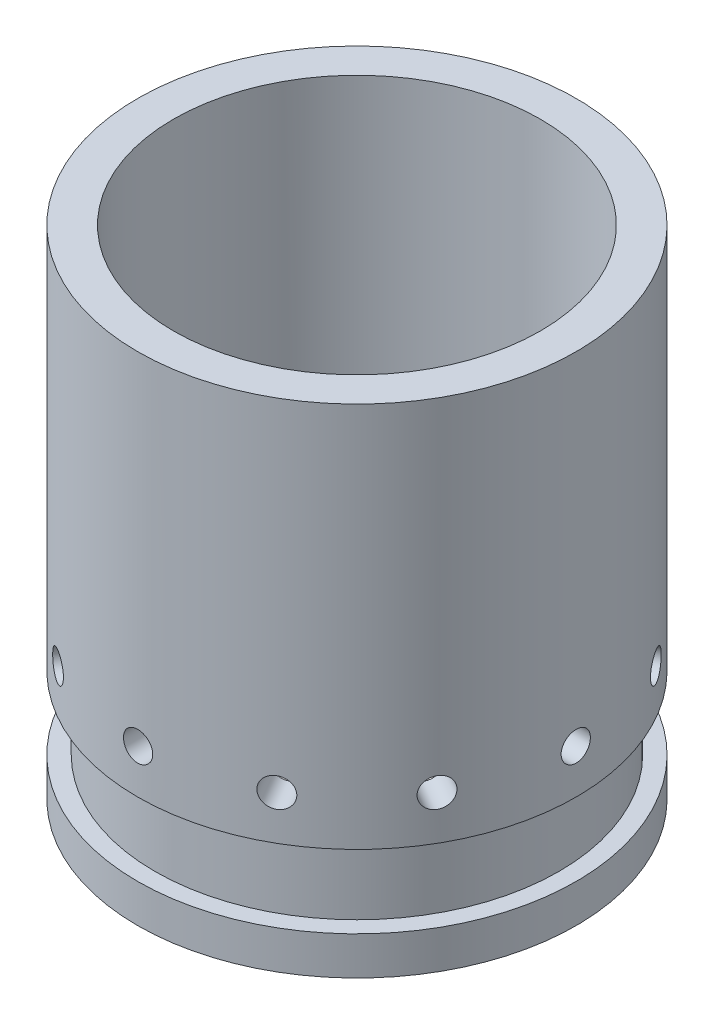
ISO-10303-21;
HEADER;
FILE_DESCRIPTION(('STEP AP214'),'2;1');
FILE_NAME('part.step','',(''),(''),'','','');
FILE_SCHEMA(('AUTOMOTIVE_DESIGN { 1 0 10303 214 1 1 1 1 }'));
ENDSEC;
DATA;
#1=APPLICATION_CONTEXT('core data for automotive mechanical design processes');
#2=APPLICATION_PROTOCOL_DEFINITION('international standard','automotive_design',2000,#1);
#3=PRODUCT_CONTEXT('',#1,'mechanical');
#4=PRODUCT('Part','Part','',(#3));
#5=PRODUCT_RELATED_PRODUCT_CATEGORY('part','',(#4));
#6=PRODUCT_DEFINITION_FORMATION('','',#4);
#7=PRODUCT_DEFINITION_CONTEXT('part definition',#1,'design');
#8=PRODUCT_DEFINITION('design','',#6,#7);
#9=PRODUCT_DEFINITION_SHAPE('','',#8);
#10=(LENGTH_UNIT() NAMED_UNIT(*) SI_UNIT(.MILLI.,.METRE.));
#11=(NAMED_UNIT(*) PLANE_ANGLE_UNIT() SI_UNIT($,.RADIAN.));
#12=(NAMED_UNIT(*) SI_UNIT($,.STERADIAN.) SOLID_ANGLE_UNIT());
#13=UNCERTAINTY_MEASURE_WITH_UNIT(LENGTH_MEASURE(1.E-05),#10,'distance_accuracy_value','');
#14=(GEOMETRIC_REPRESENTATION_CONTEXT(3) GLOBAL_UNCERTAINTY_ASSIGNED_CONTEXT((#13)) GLOBAL_UNIT_ASSIGNED_CONTEXT((#10,
#11,#12)) REPRESENTATION_CONTEXT('',''));
#15=CARTESIAN_POINT('',(0.,0.,0.));
#16=DIRECTION('',(0.,0.,1.));
#17=DIRECTION('',(1.,0.,0.));
#18=AXIS2_PLACEMENT_3D('',#15,#16,#17);
#19=CARTESIAN_POINT('',(0.,43.18,0.));
#20=DIRECTION('',(0.,-1.,0.));
#21=DIRECTION('',(0.,0.,-1.));
#22=AXIS2_PLACEMENT_3D('',#19,#20,#21);
#23=CYLINDRICAL_SURFACE('',#22,19.05);
#24=CARTESIAN_POINT('',(0.,43.18,0.));
#25=DIRECTION('',(0.,1.,0.));
#26=DIRECTION('',(0.,0.,1.));
#27=AXIS2_PLACEMENT_3D('',#24,#25,#26);
#28=CIRCLE('',#27,19.05);
#29=CARTESIAN_POINT('',(0.,43.18,19.05));
#30=VERTEX_POINT('',#29);
#31=EDGE_CURVE('E10',#30,#30,#28,.T.);
#32=ORIENTED_EDGE('',*,*,#31,.F.);
#33=EDGE_LOOP('',(#32));
#34=FACE_BOUND('',#33,.T.);
#35=CARTESIAN_POINT('',(0.,14.77,-19.05));
#36=CARTESIAN_POINT('',(-0.0712515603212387,14.7699968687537,-19.0499994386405));
#37=CARTESIAN_POINT('',(-0.142552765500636,14.7639836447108,-19.0495959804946));
#38=CARTESIAN_POINT('',(-0.283185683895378,14.7400824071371,-19.0480252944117));
#39=CARTESIAN_POINT('',(-0.352515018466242,14.7221806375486,-19.0468571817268));
#40=CARTESIAN_POINT('',(-0.487146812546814,14.6750193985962,-19.0438893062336));
#41=CARTESIAN_POINT('',(-0.55245140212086,14.64576599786,-19.0420898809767));
#42=CARTESIAN_POINT('',(-0.677206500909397,14.5767419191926,-19.0380616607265));
#43=CARTESIAN_POINT('',(-0.736658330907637,14.5369736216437,-19.0358329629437));
#44=CARTESIAN_POINT('',(-0.848137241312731,14.44797549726,-19.0311924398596));
#45=CARTESIAN_POINT('',(-0.900153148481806,14.3987316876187,-19.0287803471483));
#46=CARTESIAN_POINT('',(-0.995188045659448,14.2922093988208,-19.0240471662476));
#47=CARTESIAN_POINT('',(-1.03820665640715,14.2349305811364,-19.0217260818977));
#48=CARTESIAN_POINT('',(-1.11406109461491,14.1138998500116,-19.0174345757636));
#49=CARTESIAN_POINT('',(-1.1468875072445,14.0501420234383,-19.0154644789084));
#50=CARTESIAN_POINT('',(-1.20136551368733,13.9180045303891,-19.0121006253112));
#51=CARTESIAN_POINT('',(-1.22301724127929,13.8496249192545,-19.0107068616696));
#52=CARTESIAN_POINT('',(-1.25449990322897,13.7102936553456,-19.0086554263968));
#53=CARTESIAN_POINT('',(-1.264348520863,13.6393460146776,-19.0079966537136));
#54=CARTESIAN_POINT('',(-1.2719999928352,13.4968017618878,-19.0074861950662));
#55=CARTESIAN_POINT('',(-1.26980299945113,13.4252051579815,-19.0076344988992));
#56=CARTESIAN_POINT('',(-1.25344027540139,13.2835159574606,-19.0087204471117));
#57=CARTESIAN_POINT('',(-1.23929369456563,13.2134211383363,-19.0096568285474));
#58=CARTESIAN_POINT('',(-1.19946307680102,13.0766032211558,-19.0122114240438));
#59=CARTESIAN_POINT('',(-1.17377896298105,13.0098801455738,-19.0138296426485));
#60=CARTESIAN_POINT('',(-1.11158067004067,12.8816383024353,-19.0175670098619));
#61=CARTESIAN_POINT('',(-1.07505782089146,12.8201237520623,-19.0196865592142));
#62=CARTESIAN_POINT('',(-0.992225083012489,12.7040912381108,-19.0241873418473));
#63=CARTESIAN_POINT('',(-0.945915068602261,12.6495733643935,-19.0265685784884));
#64=CARTESIAN_POINT('',(-0.844714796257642,12.548970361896,-19.0313300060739));
#65=CARTESIAN_POINT('',(-0.789807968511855,12.5029018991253,-19.0337101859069));
#66=CARTESIAN_POINT('',(-0.673030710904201,12.4206340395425,-19.0381968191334));
#67=CARTESIAN_POINT('',(-0.61116027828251,12.3844346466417,-19.0403032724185));
#68=CARTESIAN_POINT('',(-0.482201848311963,12.3229338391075,-19.0440052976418));
#69=CARTESIAN_POINT('',(-0.415113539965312,12.2976330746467,-19.0456008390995));
#70=CARTESIAN_POINT('',(-0.277628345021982,12.2586589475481,-19.048100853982));
#71=CARTESIAN_POINT('',(-0.207231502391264,12.2449854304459,-19.0490053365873));
#72=CARTESIAN_POINT('',(-0.0652721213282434,12.2296746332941,-19.0500201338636));
#73=CARTESIAN_POINT('',(0.00628792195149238,12.2280143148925,-19.0501319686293));
#74=CARTESIAN_POINT('',(0.148669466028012,12.2367168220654,-19.0495529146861));
#75=CARTESIAN_POINT('',(0.219490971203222,12.2470795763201,-19.0488620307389));
#76=CARTESIAN_POINT('',(0.358320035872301,12.2795149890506,-19.0467562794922));
#77=CARTESIAN_POINT('',(0.426330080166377,12.3015770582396,-19.0453420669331));
#78=CARTESIAN_POINT('',(0.557682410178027,12.356774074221,-19.041948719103));
#79=CARTESIAN_POINT('',(0.621024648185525,12.3899091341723,-19.0399695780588));
#80=CARTESIAN_POINT('',(0.74134869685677,12.4663700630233,-19.0356648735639));
#81=CARTESIAN_POINT('',(0.798320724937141,12.5097112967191,-19.033338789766));
#82=CARTESIAN_POINT('',(0.904188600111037,12.605331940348,-19.0286036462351));
#83=CARTESIAN_POINT('',(0.953084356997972,12.6576114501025,-19.0261945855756));
#84=CARTESIAN_POINT('',(1.04148993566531,12.7697241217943,-19.0215605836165));
#85=CARTESIAN_POINT('',(1.08098479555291,12.8295690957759,-19.0193359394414));
#86=CARTESIAN_POINT('',(1.14936508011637,12.9550546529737,-19.0153264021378));
#87=CARTESIAN_POINT('',(1.17825057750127,13.0206951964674,-19.0135415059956));
#88=CARTESIAN_POINT('',(1.22456634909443,13.1558542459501,-19.0106149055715));
#89=CARTESIAN_POINT('',(1.24200599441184,13.2253695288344,-19.009472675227));
#90=CARTESIAN_POINT('',(1.26496560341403,13.3663494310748,-19.007958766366));
#91=CARTESIAN_POINT('',(1.27048570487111,13.4378140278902,-19.0075870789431));
#92=CARTESIAN_POINT('',(1.26944816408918,13.5805151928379,-19.0076563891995));
#93=CARTESIAN_POINT('',(1.26291404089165,13.6517519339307,-19.0080958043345));
#94=CARTESIAN_POINT('',(1.2380023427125,13.7921143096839,-19.0097344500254));
#95=CARTESIAN_POINT('',(1.21962474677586,13.8612399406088,-19.0109336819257));
#96=CARTESIAN_POINT('',(1.17155320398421,13.9954210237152,-19.0139564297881));
#97=CARTESIAN_POINT('',(1.14185941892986,14.0604765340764,-19.0157799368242));
#98=CARTESIAN_POINT('',(1.0720014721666,14.1846820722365,-19.0198457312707));
#99=CARTESIAN_POINT('',(1.03183756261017,14.2438322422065,-19.0220880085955));
#100=CARTESIAN_POINT('',(0.94209206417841,14.3546676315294,-19.0267437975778));
#101=CARTESIAN_POINT('',(0.892493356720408,14.4063389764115,-19.0291576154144));
#102=CARTESIAN_POINT('',(0.78531139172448,14.5006406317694,-19.0338818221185));
#103=CARTESIAN_POINT('',(0.727726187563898,14.5432687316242,-19.036192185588));
#104=CARTESIAN_POINT('',(0.606132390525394,14.6183096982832,-19.0404518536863));
#105=CARTESIAN_POINT('',(0.542115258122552,14.6507087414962,-19.0424006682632));
#106=CARTESIAN_POINT('',(0.409582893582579,14.7042584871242,-19.0457112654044));
#107=CARTESIAN_POINT('',(0.341073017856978,14.7254223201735,-19.0470737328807));
#108=CARTESIAN_POINT('',(0.226788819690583,14.750419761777,-19.0487023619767));
#109=CARTESIAN_POINT('',(0.181752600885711,14.7577528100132,-19.0491868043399));
#110=CARTESIAN_POINT('',(0.0911510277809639,14.7675439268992,-19.0498358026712));
#111=CARTESIAN_POINT('',(0.045585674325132,14.7700020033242,-19.0500003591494));
#112=CARTESIAN_POINT('',(0.,14.77,-19.05));
#113=B_SPLINE_CURVE_WITH_KNOTS('',3,(#35,#36,#37,#38,#39,#40,#41,#42,#43,#44,#45,#46,#47,#48,
#49,#50,#51,#52,#53,#54,#55,#56,#57,#58,#59,#60,#61,#62,#63,#64,#65,#66,#67,#68,#69,#70,#71,#72,
#73,#74,#75,#76,#77,#78,#79,#80,#81,#82,#83,#84,#85,#86,#87,#88,#89,#90,#91,#92,#93,#94,#95,#96,
#97,#98,#99,#100,#101,#102,#103,#104,#105,#106,#107,#108,#109,#110,#111,#112),.UNSPECIFIED.,.T.,
.F.,(4,2,2,2,2,2,2,2,2,2,2,2,2,2,2,2,2,2,2,2,2,2,2,2,2,2,2,2,2,2,2,2,2,2,2,2,2,2,4),(0.,
0.21358826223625,0.427424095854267,0.641145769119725,0.854819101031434,1.06881019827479,
1.28281031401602,1.49700752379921,1.71120216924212,1.92507550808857,2.13894614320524,
2.35247468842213,2.5660046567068,2.77970589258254,2.99340987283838,3.20753094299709,
3.42165209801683,3.63578602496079,3.84991710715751,4.06363742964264,4.27735648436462,
4.4908824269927,4.70441055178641,4.91826220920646,5.13211625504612,5.34630841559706,
5.56049910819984,5.77451421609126,5.988526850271,6.20212236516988,6.41571825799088,
6.62931109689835,6.842898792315,7.05687778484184,7.2709090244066,7.48522828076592,
7.69929650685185,7.83594727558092,7.97259782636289),.UNSPECIFIED.);
#114=CARTESIAN_POINT('',(0.,14.77,-19.05));
#115=VERTEX_POINT('',#114);
#116=EDGE_CURVE('E59',#115,#115,#113,.T.);
#117=ORIENTED_EDGE('',*,*,#116,.T.);
#118=EDGE_LOOP('',(#117));
#119=FACE_BOUND('',#118,.T.);
#120=CARTESIAN_POINT('',(-15.8260813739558,13.5,-10.6036620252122));
#121=CARTESIAN_POINT('',(-15.8260834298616,13.5712513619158,-10.6036595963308));
#122=CARTESIAN_POINT('',(-15.8294402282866,13.6425523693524,-10.5986542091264));
#123=CARTESIAN_POINT('',(-15.8427538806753,13.7831848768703,-10.5787422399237));
#124=CARTESIAN_POINT('',(-15.8527183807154,13.8525139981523,-10.5638241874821));
#125=CARTESIAN_POINT('',(-15.8788735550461,13.987145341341,-10.5244681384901));
#126=CARTESIAN_POINT('',(-15.8950608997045,14.0524496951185,-10.5000352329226));
#127=CARTESIAN_POINT('',(-15.9330653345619,14.1772043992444,-10.4422755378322));
#128=CARTESIAN_POINT('',(-15.9548811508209,14.2366560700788,-10.408950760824));
#129=CARTESIAN_POINT('',(-16.0034008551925,14.3481351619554,-10.3341977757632));
#130=CARTESIAN_POINT('',(-16.0301119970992,14.4001513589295,-10.2927575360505));
#131=CARTESIAN_POINT('',(-16.0874713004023,14.4951868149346,-10.2028723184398));
#132=CARTESIAN_POINT('',(-16.1181196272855,14.5382056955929,-10.1544270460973));
#133=CARTESIAN_POINT('',(-16.182348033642,14.6140604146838,-10.0517549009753));
#134=CARTESIAN_POINT('',(-16.215930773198,14.6468868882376,-9.99752277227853));
#135=CARTESIAN_POINT('',(-16.2849080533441,14.7013650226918,-9.88476772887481));
#136=CARTESIAN_POINT('',(-16.3203025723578,14.7230168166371,-9.82624486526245));
#137=CARTESIAN_POINT('',(-16.3917411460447,14.7544996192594,-9.70660428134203));
#138=CARTESIAN_POINT('',(-16.4277841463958,14.7643483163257,-9.64549058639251));
#139=CARTESIAN_POINT('',(-16.4994972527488,14.7719999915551,-9.5222985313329));
#140=CARTESIAN_POINT('',(-16.535167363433,14.7698031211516,-9.46022018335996));
#141=CARTESIAN_POINT('',(-16.6050738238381,14.7534405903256,-9.33697147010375));
#142=CARTESIAN_POINT('',(-16.6393123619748,14.7392939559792,-9.275799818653));
#143=CARTESIAN_POINT('',(-16.7055137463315,14.6994630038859,-9.156036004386));
#144=CARTESIAN_POINT('',(-16.7374765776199,14.6737786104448,-9.09744385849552));
#145=CARTESIAN_POINT('',(-16.7983656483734,14.6115797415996,-8.98451638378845));
#146=CARTESIAN_POINT('',(-16.8272894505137,14.5750566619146,-8.93018448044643));
#147=CARTESIAN_POINT('',(-16.8814108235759,14.4922234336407,-8.82744840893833));
#148=CARTESIAN_POINT('',(-16.9066083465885,14.4459131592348,-8.77904431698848));
#149=CARTESIAN_POINT('',(-16.9527861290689,14.344712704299,-8.68953907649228));
#150=CARTESIAN_POINT('',(-16.9737580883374,14.2898060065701,-8.64845231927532));
#151=CARTESIAN_POINT('',(-17.0110033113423,14.1730291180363,-8.57496176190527));
#152=CARTESIAN_POINT('',(-17.0272765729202,14.1111589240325,-8.54255796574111));
#153=CARTESIAN_POINT('',(-17.054816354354,13.9822005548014,-8.48744325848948));
#154=CARTESIAN_POINT('',(-17.0660825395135,13.9151120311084,-8.46473299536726));
#155=CARTESIAN_POINT('',(-17.0834003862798,13.7776263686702,-8.42972810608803));
#156=CARTESIAN_POINT('',(-17.0894521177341,13.7072292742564,-8.41743334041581));
#157=CARTESIAN_POINT('',(-17.096226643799,13.5652697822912,-8.40366554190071));
#158=CARTESIAN_POINT('',(-17.0969596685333,13.493709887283,-8.40217173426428));
#159=CARTESIAN_POINT('',(-17.0931109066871,13.3513286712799,-8.40999868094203));
#160=CARTESIAN_POINT('',(-17.0885291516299,13.280507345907,-8.41931937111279));
#161=CARTESIAN_POINT('',(-17.0741387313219,13.1416791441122,-8.44846421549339));
#162=CARTESIAN_POINT('',(-17.0643348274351,13.0736697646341,-8.46827880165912));
#163=CARTESIAN_POINT('',(-17.0396798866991,12.9423186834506,-8.51777961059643));
#164=CARTESIAN_POINT('',(-17.0248287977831,12.8789770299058,-8.54746593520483));
#165=CARTESIAN_POINT('',(-16.9903301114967,12.7586533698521,-8.61583690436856));
#166=CARTESIAN_POINT('',(-16.9706752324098,12.701681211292,-8.65453520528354));
#167=CARTESIAN_POINT('',(-16.9269666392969,12.5958130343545,-8.73971314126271));
#168=CARTESIAN_POINT('',(-16.9029128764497,12.5469171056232,-8.7861928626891));
#169=CARTESIAN_POINT('',(-16.850867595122,12.4585111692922,-8.88560115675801));
#170=CARTESIAN_POINT('',(-16.8228699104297,12.4190161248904,-8.93853981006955));
#171=CARTESIAN_POINT('',(-16.7635952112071,12.350635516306,-9.04921604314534));
#172=CARTESIAN_POINT('',(-16.7323182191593,12.3217498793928,-9.10695359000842));
#173=CARTESIAN_POINT('',(-16.6672688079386,12.275434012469,-9.22546541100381));
#174=CARTESIAN_POINT('',(-16.6334984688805,12.2579943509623,-9.28623714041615));
#175=CARTESIAN_POINT('',(-16.5643171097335,12.2350346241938,-9.40908422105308));
#176=CARTESIAN_POINT('',(-16.5289061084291,12.229514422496,-9.47115955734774));
#177=CARTESIAN_POINT('',(-16.4574955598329,12.2305516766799,-9.59470798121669));
#178=CARTESIAN_POINT('',(-16.4214972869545,12.2370857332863,-9.65618200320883));
#179=CARTESIAN_POINT('',(-16.3498994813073,12.2619974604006,-9.7769225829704));
#180=CARTESIAN_POINT('',(-16.3142999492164,12.2803751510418,-9.83618913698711));
#181=CARTESIAN_POINT('',(-16.2445956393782,12.328447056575,-9.95088538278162));
#182=CARTESIAN_POINT('',(-16.2104908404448,12.3581411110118,-10.0063151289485));
#183=CARTESIAN_POINT('',(-16.1448706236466,12.427999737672,-10.1118504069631));
#184=CARTESIAN_POINT('',(-16.1133551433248,12.4681640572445,-10.1619560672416));
#185=CARTESIAN_POINT('',(-16.0539072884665,12.5579100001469,-10.2556154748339));
#186=CARTESIAN_POINT('',(-16.0259815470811,12.6075086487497,-10.299157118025));
#187=CARTESIAN_POINT('',(-15.9747385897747,12.7146903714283,-10.3784614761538));
#188=CARTESIAN_POINT('',(-15.9514225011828,12.7722753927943,-10.4142222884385));
#189=CARTESIAN_POINT('',(-15.9102095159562,12.893869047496,-10.4770774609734));
#190=CARTESIAN_POINT('',(-15.8923199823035,12.9578862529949,-10.5041600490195));
#191=CARTESIAN_POINT('',(-15.8626735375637,13.0904187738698,-10.5488774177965));
#192=CARTESIAN_POINT('',(-15.8509094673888,13.1589287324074,-10.5665232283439));
#193=CARTESIAN_POINT('',(-15.8369975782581,13.2732127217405,-10.5873554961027));
#194=CARTESIAN_POINT('',(-15.8329106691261,13.3182486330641,-10.5934632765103));
#195=CARTESIAN_POINT('',(-15.8274519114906,13.4088495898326,-10.6016173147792));
#196=CARTESIAN_POINT('',(-15.8260800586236,13.4544146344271,-10.6036635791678));
#197=CARTESIAN_POINT('',(-15.8260813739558,13.5,-10.6036620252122));
#198=B_SPLINE_CURVE_WITH_KNOTS('',3,(#120,#121,#122,#123,#124,#125,#126,#127,#128,#129,#130,
#131,#132,#133,#134,#135,#136,#137,#138,#139,#140,#141,#142,#143,#144,#145,#146,#147,#148,#149,
#150,#151,#152,#153,#154,#155,#156,#157,#158,#159,#160,#161,#162,#163,#164,#165,#166,#167,#168,
#169,#170,#171,#172,#173,#174,#175,#176,#177,#178,#179,#180,#181,#182,#183,#184,#185,#186,#187,
#188,#189,#190,#191,#192,#193,#194,#195,#196,#197),.UNSPECIFIED.,.T.,.F.,(4,2,2,2,2,2,2,2,2,2,2,
2,2,2,2,2,2,2,2,2,2,2,2,2,2,2,2,2,2,2,2,2,2,2,2,2,2,2,4),(0.,0.213587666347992,
0.427422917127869,0.641143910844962,0.854816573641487,1.06880845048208,1.28280932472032,
1.49700624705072,1.71120061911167,1.92507359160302,2.13894387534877,2.35247428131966,
2.56600608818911,2.77970786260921,2.99341238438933,3.20753267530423,3.42165306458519,
3.63578776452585,3.84991959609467,4.06363945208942,4.27735804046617,4.49088210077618,
4.70440836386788,4.91826032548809,5.13211466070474,5.34630714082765,5.5604981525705,
5.7745124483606,5.98852429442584,6.20212114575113,6.41571836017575,6.62931254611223,
6.84290157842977,7.05687977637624,7.27091023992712,7.48522982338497,7.69929835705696,
7.83594820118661,7.97259782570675),.UNSPECIFIED.);
#199=CARTESIAN_POINT('',(-15.8260813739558,13.5,-10.6036620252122));
#200=VERTEX_POINT('',#199);
#201=EDGE_CURVE('E119',#200,#200,#198,.T.);
#202=ORIENTED_EDGE('',*,*,#201,.T.);
#203=EDGE_LOOP('',(#202));
#204=FACE_BOUND('',#203,.T.);
#205=CARTESIAN_POINT('',(-19.0076195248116,13.5,-1.2700000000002));
#206=CARTESIAN_POINT('',(-19.0076200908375,13.5712513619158,-1.2699968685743));
#207=CARTESIAN_POINT('',(-19.0080244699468,13.6425523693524,-1.26398367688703));
#208=CARTESIAN_POINT('',(-19.0095984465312,13.7831848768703,-1.24008257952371));
#209=CARTESIAN_POINT('',(-19.0107689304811,13.8525139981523,-1.2221809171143));
#210=CARTESIAN_POINT('',(-19.0137419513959,13.987145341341,-1.17501999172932));
#211=CARTESIAN_POINT('',(-19.0155441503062,14.0524496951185,-1.14576680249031));
#212=CARTESIAN_POINT('',(-19.0195771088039,14.1772043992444,-1.07674322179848));
#213=CARTESIAN_POINT('',(-19.0218077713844,14.2366560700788,-1.03697521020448));
#214=CARTESIAN_POINT('',(-19.0264505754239,14.3481351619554,-0.94797737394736));
#215=CARTESIAN_POINT('',(-19.0288629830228,14.4001513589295,-0.898733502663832));
#216=CARTESIAN_POINT('',(-19.0335949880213,14.4951868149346,-0.79221096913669));
#217=CARTESIAN_POINT('',(-19.0359145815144,14.5382056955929,-0.734931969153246));
#218=CARTESIAN_POINT('',(-19.0402019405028,14.6140604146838,-0.613901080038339));
#219=CARTESIAN_POINT('',(-19.0421693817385,14.6468868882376,-0.550143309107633));
#220=CARTESIAN_POINT('',(-19.0455279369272,14.7013650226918,-0.418005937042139));
#221=CARTESIAN_POINT('',(-19.0469190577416,14.7230168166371,-0.34962639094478));
#222=CARTESIAN_POINT('',(-19.0489663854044,14.7544996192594,-0.210295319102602));
#223=CARTESIAN_POINT('',(-19.0496236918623,14.7643483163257,-0.139347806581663));
#224=CARTESIAN_POINT('',(-19.0501330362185,14.7719999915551,0.00319619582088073));
#225=CARTESIAN_POINT('',(-19.0499850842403,14.7698031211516,0.0747926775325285));
#226=CARTESIAN_POINT('',(-19.0489014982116,14.7534405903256,0.216482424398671));
#227=CARTESIAN_POINT('',(-19.0479671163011,14.7392939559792,0.28657789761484));
#228=CARTESIAN_POINT('',(-19.0454172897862,14.6994630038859,0.423397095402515));
#229=CARTESIAN_POINT('',(-19.0438018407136,14.6737786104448,0.490120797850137));
#230=CARTESIAN_POINT('',(-19.0400695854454,14.6115797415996,0.61836339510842));
#231=CARTESIAN_POINT('',(-19.0379523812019,14.5750566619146,0.679878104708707));
#232=CARTESIAN_POINT('',(-19.0334548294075,14.4922234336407,0.795910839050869));
#233=CARTESIAN_POINT('',(-19.0310744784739,14.4459131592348,0.85042877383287));
#234=CARTESIAN_POINT('',(-19.0263129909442,14.344712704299,0.951031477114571));
#235=CARTESIAN_POINT('',(-19.0239318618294,14.2898060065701,0.997099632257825));
#236=CARTESIAN_POINT('',(-19.0194418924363,14.1730291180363,1.07936693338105));
#237=CARTESIAN_POINT('',(-19.0173330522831,14.1111589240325,1.11556607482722));
#238=CARTESIAN_POINT('',(-19.0136258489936,13.9822005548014,1.17706670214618));
#239=CARTESIAN_POINT('',(-19.0120275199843,13.9151120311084,1.20236745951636));
#240=CARTESIAN_POINT('',(-19.0095227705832,13.7776263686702,1.241341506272));
#241=CARTESIAN_POINT('',(-19.0086163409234,13.7072292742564,1.25501495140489));
#242=CARTESIAN_POINT('',(-19.0075993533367,13.5652697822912,1.2703254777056));
#243=CARTESIAN_POINT('',(-19.0074872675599,13.493709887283,1.27198566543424));
#244=CARTESIAN_POINT('',(-19.0080676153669,13.3513286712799,1.26328294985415));
#245=CARTESIAN_POINT('',(-19.0087600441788,13.280507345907,1.25292011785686));
#246=CARTESIAN_POINT('',(-19.0108699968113,13.1416791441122,1.22048473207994));
#247=CARTESIAN_POINT('',(-19.0122868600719,13.0736697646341,1.19842284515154));
#248=CARTESIAN_POINT('',(-19.0156854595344,12.9423186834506,1.14322641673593));
#249=CARTESIAN_POINT('',(-19.0176672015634,12.8789770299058,1.11009176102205));
#250=CARTESIAN_POINT('',(-19.0219759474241,12.7586533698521,1.03363142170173));
#251=CARTESIAN_POINT('',(-19.024303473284,12.701681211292,0.990290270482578));
#252=CARTESIAN_POINT('',(-19.0290396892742,12.5958130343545,0.894669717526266));
#253=CARTESIAN_POINT('',(-19.0314483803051,12.5469171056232,0.842390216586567));
#254=CARTESIAN_POINT('',(-19.0360799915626,12.4585111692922,0.730277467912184));
#255=CARTESIAN_POINT('',(-19.0383026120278,12.4190161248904,0.670432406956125));
#256=CARTESIAN_POINT('',(-19.0423073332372,12.350635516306,0.544946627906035));
#257=CARTESIAN_POINT('',(-19.0440894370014,12.3217498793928,0.479305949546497));
#258=CARTESIAN_POINT('',(-19.0470109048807,12.275434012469,0.344146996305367));
#259=CARTESIAN_POINT('',(-19.0481507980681,12.2579943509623,0.274631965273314));
#260=CARTESIAN_POINT('',(-19.0496615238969,12.2350346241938,0.133652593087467));
#261=CARTESIAN_POINT('',(-19.0500323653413,12.229514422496,0.0621882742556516));
#262=CARTESIAN_POINT('',(-19.0499632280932,12.2305516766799,-0.08051307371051));
#263=CARTESIAN_POINT('',(-19.0495248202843,12.2370857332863,-0.151750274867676));
#264=CARTESIAN_POINT('',(-19.0478895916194,12.2619974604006,-0.292113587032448));
#265=CARTESIAN_POINT('',(-19.0466927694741,12.2803751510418,-0.361239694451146));
#266=CARTESIAN_POINT('',(-19.0436751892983,12.328447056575,-0.495421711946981));
#267=CARTESIAN_POINT('',(-19.0418544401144,12.3581411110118,-0.560477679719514));
#268=CARTESIAN_POINT('',(-19.0377933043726,12.427999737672,-0.684684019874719));
#269=CARTESIAN_POINT('',(-19.0355529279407,12.4681640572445,-0.743834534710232));
#270=CARTESIAN_POINT('',(-19.0308992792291,12.5579100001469,-0.854669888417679));
#271=CARTESIAN_POINT('',(-19.0284856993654,12.6075086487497,-0.906340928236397));
#272=CARTESIAN_POINT('',(-19.0237601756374,12.7146903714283,-1.00064199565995));
#273=CARTESIAN_POINT('',(-19.0214482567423,12.7722753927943,-1.04326981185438));
#274=CARTESIAN_POINT('',(-19.0171843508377,12.893869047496,-1.1183104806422));
#275=CARTESIAN_POINT('',(-19.0152328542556,12.9578862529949,-1.15070945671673));
#276=CARTESIAN_POINT('',(-19.0119169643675,13.0904187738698,-1.20425905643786));
#277=CARTESIAN_POINT('',(-19.010551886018,13.1589287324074,-1.22542281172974));
#278=CARTESIAN_POINT('',(-19.0089199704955,13.2732127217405,-1.2504200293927));
#279=CARTESIAN_POINT('',(-19.0084344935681,13.3182486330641,-1.25775297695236));
#280=CARTESIAN_POINT('',(-19.007784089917,13.4088495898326,-1.26754396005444));
#281=CARTESIAN_POINT('',(-19.0076191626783,13.4544146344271,-1.2700020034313));
#282=CARTESIAN_POINT('',(-19.0076195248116,13.5,-1.2700000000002));
#283=B_SPLINE_CURVE_WITH_KNOTS('',3,(#205,#206,#207,#208,#209,#210,#211,#212,#213,#214,#215,
#216,#217,#218,#219,#220,#221,#222,#223,#224,#225,#226,#227,#228,#229,#230,#231,#232,#233,#234,
#235,#236,#237,#238,#239,#240,#241,#242,#243,#244,#245,#246,#247,#248,#249,#250,#251,#252,#253,
#254,#255,#256,#257,#258,#259,#260,#261,#262,#263,#264,#265,#266,#267,#268,#269,#270,#271,#272,
#273,#274,#275,#276,#277,#278,#279,#280,#281,#282),.UNSPECIFIED.,.T.,.F.,(4,2,2,2,2,2,2,2,2,2,2,
2,2,2,2,2,2,2,2,2,2,2,2,2,2,2,2,2,2,2,2,2,2,2,2,2,2,2,4),(0.,0.213587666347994,
0.427422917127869,0.641143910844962,0.854816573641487,1.06880845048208,1.28280932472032,
1.49700624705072,1.71120061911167,1.92507359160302,2.13894387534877,2.35247428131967,
2.56600608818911,2.77970786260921,2.99341238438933,3.20753267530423,3.42165306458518,
3.63578776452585,3.84991959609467,4.06363945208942,4.27735804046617,4.49088210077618,
4.70440836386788,4.91826032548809,5.13211466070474,5.34630714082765,5.56049815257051,
5.7745124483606,5.98852429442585,6.20212114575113,6.41571836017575,6.62931254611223,
6.84290157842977,7.05687977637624,7.27091023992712,7.48522982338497,7.69929835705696,
7.83594820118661,7.97259782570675),.UNSPECIFIED.);
#284=CARTESIAN_POINT('',(-19.0076195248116,13.5,-1.2700000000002));
#285=VERTEX_POINT('',#284);
#286=EDGE_CURVE('E123',#285,#285,#283,.T.);
#287=ORIENTED_EDGE('',*,*,#286,.T.);
#288=EDGE_LOOP('',(#287));
#289=FACE_BOUND('',#288,.T.);
#290=CARTESIAN_POINT('',(-17.096081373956,13.5,8.40395749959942));
#291=CARTESIAN_POINT('',(-17.0960802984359,13.5712513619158,8.40396049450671));
#292=CARTESIAN_POINT('',(-17.0934239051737,13.6425523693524,8.40937026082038));
#293=CARTESIAN_POINT('',(-17.082836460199,13.7831848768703,8.43085620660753));
#294=CARTESIAN_POINT('',(-17.0748992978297,13.8525139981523,8.44694474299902));
#295=CARTESIAN_POINT('',(-17.0538935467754,13.987145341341,8.48927381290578));
#296=CARTESIAN_POINT('',(-17.0408277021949,14.0524496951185,8.51550891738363));
#297=CARTESIAN_POINT('',(-17.0098085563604,14.1772043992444,8.57730157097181));
#298=CARTESIAN_POINT('',(-16.9918563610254,14.2366560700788,8.61285701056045));
#299=CARTESIAN_POINT('',(-16.9513782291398,14.3481351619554,8.69225279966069));
#300=CARTESIAN_POINT('',(-16.928845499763,14.4001513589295,8.73610544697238));
#301=CARTESIAN_POINT('',(-16.879682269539,14.4951868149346,8.83072266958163));
#302=CARTESIAN_POINT('',(-16.8530515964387,14.5382056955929,8.8814875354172));
#303=CARTESIAN_POINT('',(-16.7962491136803,14.6140604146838,8.98844703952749));
#304=CARTESIAN_POINT('',(-16.7660740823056,14.6468868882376,9.04464660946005));
#305=CARTESIAN_POINT('',(-16.7029139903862,14.7013650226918,9.16076020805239));
#306=CARTESIAN_POINT('',(-16.6699289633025,14.7230168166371,9.22067419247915));
#307=CARTESIAN_POINT('',(-16.6020364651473,14.7544996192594,9.34236210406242));
#308=CARTESIAN_POINT('',(-16.5671319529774,14.7643483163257,9.40413310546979));
#309=CARTESIAN_POINT('',(-16.4963010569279,14.7719999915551,9.52783450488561));
#310=CARTESIAN_POINT('',(-16.4603746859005,14.7698031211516,9.58976490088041));
#311=CARTESIAN_POINT('',(-16.3885913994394,14.7534405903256,9.71193002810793));
#312=CARTESIAN_POINT('',(-16.35273446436,14.7392939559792,9.77216729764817));
#313=CARTESIAN_POINT('',(-16.282116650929,14.6994630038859,9.88938128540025));
#314=CARTESIAN_POINT('',(-16.2473557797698,14.6737786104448,9.94635798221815));
#315=CARTESIAN_POINT('',(-16.180002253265,14.6115797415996,10.055553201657));
#316=CARTESIAN_POINT('',(-16.147411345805,14.5750566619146,10.1077679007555));
#317=CARTESIAN_POINT('',(-16.0854999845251,14.4922234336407,10.2060064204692));
#318=CARTESIAN_POINT('',(-16.0561795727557,14.4459131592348,10.2520301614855));
#319=CARTESIAN_POINT('',(-16.0017546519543,14.344712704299,10.336773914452));
#320=CARTESIAN_POINT('',(-15.9766584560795,14.2898060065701,10.3754795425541));
#321=CARTESIAN_POINT('',(-15.9316363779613,14.1730291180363,10.4444801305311));
#322=CARTESIAN_POINT('',(-15.911710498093,14.1111589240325,10.474775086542));
#323=CARTESIAN_POINT('',(-15.8777496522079,13.9822005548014,10.5261825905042));
#324=CARTESIAN_POINT('',(-15.8637150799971,13.9151120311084,10.5472945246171));
#325=CARTESIAN_POINT('',(-15.8420588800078,13.7776263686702,10.5797946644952));
#326=CARTESIAN_POINT('',(-15.8344371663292,13.7072292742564,10.5911830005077));
#327=CARTESIAN_POINT('',(-15.8259011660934,13.5652697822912,10.603933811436));
#328=CARTESIAN_POINT('',(-15.824974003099,13.493709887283,10.6053155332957));
#329=CARTESIAN_POINT('',(-15.8298279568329,13.3513286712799,10.5980689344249));
#330=CARTESIAN_POINT('',(-15.835609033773,13.280507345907,10.5894406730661));
#331=CARTESIAN_POINT('',(-15.853653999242,13.1416791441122,10.5624057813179));
#332=CARTESIAN_POINT('',(-15.8659119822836,13.0736697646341,10.5440080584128));
#333=CARTESIAN_POINT('',(-15.8964534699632,12.9423186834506,10.497905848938));
#334=CARTESIAN_POINT('',(-15.914737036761,12.8789770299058,10.4702012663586));
#335=CARTESIAN_POINT('',(-15.956698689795,12.7586533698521,10.4061390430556));
#336=CARTESIAN_POINT('',(-15.9803849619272,12.701681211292,10.3697682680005));
#337=CARTESIAN_POINT('',(-16.0322969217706,12.5958130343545,10.2893265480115));
#338=CARTESIAN_POINT('',(-16.0605226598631,12.5469171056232,10.245255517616));
#339=CARTESIAN_POINT('',(-16.1205901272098,12.4585111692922,10.1504788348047));
#340=CARTESIAN_POINT('',(-16.1524375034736,12.4190161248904,10.0997628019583));
#341=CARTESIAN_POINT('',(-16.2186485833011,12.350635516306,9.99309129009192));
#342=CARTESIAN_POINT('',(-16.2530122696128,12.3217498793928,9.93713584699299));
#343=CARTESIAN_POINT('',(-16.3231218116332,12.275434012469,9.82154549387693));
#344=CARTESIAN_POINT('',(-16.3588665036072,12.2579943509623,9.76191365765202));
#345=CARTESIAN_POINT('',(-16.430664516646,12.2350346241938,9.6405773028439));
#346=CARTESIAN_POINT('',(-16.4667178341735,12.229514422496,9.57887280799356));
#347=CARTESIAN_POINT('',(-16.5380086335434,12.2305516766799,9.45525524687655));
#348=CARTESIAN_POINT('',(-16.5732475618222,12.2370857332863,9.39334281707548));
#349=CARTESIAN_POINT('',(-16.6420130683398,12.2619974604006,9.270967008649));
#350=CARTESIAN_POINT('',(-16.6755396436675,12.2803751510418,9.21050363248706));
#351=CARTESIAN_POINT('',(-16.7400173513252,12.328447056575,9.0927898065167));
#352=CARTESIAN_POINT('',(-16.7709685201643,12.3581411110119,9.03553931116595));
#353=CARTESIAN_POINT('',(-16.8295546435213,12.427999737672,8.92594289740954));
#354=CARTESIAN_POINT('',(-16.857189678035,12.4681640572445,8.87359686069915));
#355=CARTESIAN_POINT('',(-16.9085771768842,12.5579100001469,8.77528380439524));
#356=CARTESIAN_POINT('',(-16.9323224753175,12.6075086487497,8.72932858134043));
#357=CARTESIAN_POINT('',(-16.9753805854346,12.7146903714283,8.64529869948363));
#358=CARTESIAN_POINT('',(-16.9946923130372,12.7722753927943,8.60722596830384));
#359=CARTESIAN_POINT('',(-17.0285199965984,12.893869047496,8.54010688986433));
#360=CARTESIAN_POINT('',(-17.0430294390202,12.9578862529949,8.51107280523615));
#361=CARTESIAN_POINT('',(-17.0669325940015,13.0904187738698,8.46303954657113));
#362=CARTESIAN_POINT('',(-17.0763322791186,13.1589287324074,8.44402865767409));
#363=CARTESIAN_POINT('',(-17.0874176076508,13.2732127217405,8.4215644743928));
#364=CARTESIAN_POINT('',(-17.0906636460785,13.3182486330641,8.4149712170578));
#365=CARTESIAN_POINT('',(-17.094995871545,13.4088495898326,8.40616677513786));
#366=CARTESIAN_POINT('',(-17.0960820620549,13.4544146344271,8.40395558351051));
#367=CARTESIAN_POINT('',(-17.096081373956,13.5,8.40395749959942));
#368=B_SPLINE_CURVE_WITH_KNOTS('',3,(#290,#291,#292,#293,#294,#295,#296,#297,#298,#299,#300,
#301,#302,#303,#304,#305,#306,#307,#308,#309,#310,#311,#312,#313,#314,#315,#316,#317,#318,#319,
#320,#321,#322,#323,#324,#325,#326,#327,#328,#329,#330,#331,#332,#333,#334,#335,#336,#337,#338,
#339,#340,#341,#342,#343,#344,#345,#346,#347,#348,#349,#350,#351,#352,#353,#354,#355,#356,#357,
#358,#359,#360,#361,#362,#363,#364,#365,#366,#367),.UNSPECIFIED.,.T.,.F.,(4,2,2,2,2,2,2,2,2,2,2,
2,2,2,2,2,2,2,2,2,2,2,2,2,2,2,2,2,2,2,2,2,2,2,2,2,2,2,4),(0.,0.213587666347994,0.42742291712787,
0.641143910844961,0.854816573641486,1.06880845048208,1.28280932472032,1.49700624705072,
1.71120061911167,1.92507359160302,2.13894387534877,2.35247428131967,2.56600608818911,
2.77970786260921,2.99341238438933,3.20753267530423,3.42165306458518,3.63578776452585,
3.84991959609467,4.06363945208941,4.27735804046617,4.49088210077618,4.70440836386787,
4.91826032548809,5.13211466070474,5.34630714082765,5.56049815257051,5.7745124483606,
5.98852429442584,6.20212114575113,6.41571836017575,6.62931254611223,6.84290157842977,
7.05687977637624,7.27091023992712,7.48522982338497,7.69929835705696,7.83594820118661,
7.97259782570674),.UNSPECIFIED.);
#369=CARTESIAN_POINT('',(-17.096081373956,13.5,8.40395749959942));
#370=VERTEX_POINT('',#369);
#371=EDGE_CURVE('E127',#370,#370,#368,.T.);
#372=ORIENTED_EDGE('',*,*,#371,.T.);
#373=EDGE_LOOP('',(#372));
#374=FACE_BOUND('',#373,.T.);
#375=CARTESIAN_POINT('',(-10.6036620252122,13.5,15.8260813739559));
#376=CARTESIAN_POINT('',(-10.6036595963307,13.5712513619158,15.8260834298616));
#377=CARTESIAN_POINT('',(-10.5986542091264,13.6425523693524,15.8294402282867));
#378=CARTESIAN_POINT('',(-10.5787422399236,13.7831848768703,15.8427538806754));
#379=CARTESIAN_POINT('',(-10.5638241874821,13.8525139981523,15.8527183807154));
#380=CARTESIAN_POINT('',(-10.5244681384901,13.987145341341,15.8788735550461));
#381=CARTESIAN_POINT('',(-10.5000352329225,14.0524496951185,15.8950608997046));
#382=CARTESIAN_POINT('',(-10.4422755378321,14.1772043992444,15.933065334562));
#383=CARTESIAN_POINT('',(-10.408950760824,14.2366560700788,15.954881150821));
#384=CARTESIAN_POINT('',(-10.3341977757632,14.3481351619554,16.0034008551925));
#385=CARTESIAN_POINT('',(-10.2927575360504,14.4001513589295,16.0301119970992));
#386=CARTESIAN_POINT('',(-10.2028723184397,14.4951868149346,16.0874713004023));
#387=CARTESIAN_POINT('',(-10.1544270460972,14.5382056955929,16.1181196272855));
#388=CARTESIAN_POINT('',(-10.0517549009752,14.6140604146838,16.182348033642));
#389=CARTESIAN_POINT('',(-9.99752277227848,14.6468868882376,16.215930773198));
#390=CARTESIAN_POINT('',(-9.88476772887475,14.7013650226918,16.2849080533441));
#391=CARTESIAN_POINT('',(-9.82624486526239,14.7230168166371,16.3203025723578));
#392=CARTESIAN_POINT('',(-9.70660428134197,14.7544996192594,16.3917411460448));
#393=CARTESIAN_POINT('',(-9.64549058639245,14.7643483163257,16.4277841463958));
#394=CARTESIAN_POINT('',(-9.52229853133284,14.7719999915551,16.4994972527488));
#395=CARTESIAN_POINT('',(-9.4602201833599,14.7698031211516,16.5351673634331));
#396=CARTESIAN_POINT('',(-9.33697147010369,14.7534405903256,16.6050738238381));
#397=CARTESIAN_POINT('',(-9.27579981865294,14.7392939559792,16.6393123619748));
#398=CARTESIAN_POINT('',(-9.15603600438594,14.6994630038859,16.7055137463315));
#399=CARTESIAN_POINT('',(-9.09744385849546,14.6737786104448,16.73747657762));
#400=CARTESIAN_POINT('',(-8.98451638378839,14.6115797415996,16.7983656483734));
#401=CARTESIAN_POINT('',(-8.93018448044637,14.5750566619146,16.8272894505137));
#402=CARTESIAN_POINT('',(-8.82744840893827,14.4922234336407,16.881410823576));
#403=CARTESIAN_POINT('',(-8.77904431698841,14.4459131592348,16.9066083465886));
#404=CARTESIAN_POINT('',(-8.68953907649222,14.344712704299,16.9527861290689));
#405=CARTESIAN_POINT('',(-8.64845231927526,14.2898060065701,16.9737580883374));
#406=CARTESIAN_POINT('',(-8.57496176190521,14.1730291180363,17.0110033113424));
#407=CARTESIAN_POINT('',(-8.54255796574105,14.1111589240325,17.0272765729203));
#408=CARTESIAN_POINT('',(-8.48744325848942,13.9822005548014,17.0548163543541));
#409=CARTESIAN_POINT('',(-8.46473299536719,13.9151120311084,17.0660825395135));
#410=CARTESIAN_POINT('',(-8.42972810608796,13.7776263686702,17.0834003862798));
#411=CARTESIAN_POINT('',(-8.41743334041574,13.7072292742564,17.0894521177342));
#412=CARTESIAN_POINT('',(-8.40366554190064,13.5652697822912,17.096226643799));
#413=CARTESIAN_POINT('',(-8.40217173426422,13.493709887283,17.0969596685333));
#414=CARTESIAN_POINT('',(-8.40999868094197,13.3513286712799,17.0931109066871));
#415=CARTESIAN_POINT('',(-8.41931937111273,13.280507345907,17.0885291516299));
#416=CARTESIAN_POINT('',(-8.44846421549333,13.1416791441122,17.0741387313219));
#417=CARTESIAN_POINT('',(-8.46827880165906,13.073669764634,17.0643348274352));
#418=CARTESIAN_POINT('',(-8.51777961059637,12.9423186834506,17.0396798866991));
#419=CARTESIAN_POINT('',(-8.54746593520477,12.8789770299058,17.0248287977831));
#420=CARTESIAN_POINT('',(-8.6158369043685,12.7586533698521,16.9903301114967));
#421=CARTESIAN_POINT('',(-8.65453520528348,12.701681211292,16.9706752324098));
#422=CARTESIAN_POINT('',(-8.73971314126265,12.5958130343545,16.9269666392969));
#423=CARTESIAN_POINT('',(-8.78619286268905,12.5469171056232,16.9029128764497));
#424=CARTESIAN_POINT('',(-8.88560115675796,12.4585111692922,16.850867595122));
#425=CARTESIAN_POINT('',(-8.9385398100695,12.4190161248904,16.8228699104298));
#426=CARTESIAN_POINT('',(-9.04921604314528,12.350635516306,16.7635952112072));
#427=CARTESIAN_POINT('',(-9.10695359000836,12.3217498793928,16.7323182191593));
#428=CARTESIAN_POINT('',(-9.22546541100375,12.275434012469,16.6672688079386));
#429=CARTESIAN_POINT('',(-9.28623714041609,12.2579943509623,16.6334984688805));
#430=CARTESIAN_POINT('',(-9.40908422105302,12.2350346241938,16.5643171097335));
#431=CARTESIAN_POINT('',(-9.47115955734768,12.229514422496,16.5289061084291));
#432=CARTESIAN_POINT('',(-9.59470798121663,12.2305516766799,16.4574955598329));
#433=CARTESIAN_POINT('',(-9.65618200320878,12.2370857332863,16.4214972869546));
#434=CARTESIAN_POINT('',(-9.77692258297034,12.2619974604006,16.3498994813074));
#435=CARTESIAN_POINT('',(-9.83618913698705,12.2803751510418,16.3142999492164));
#436=CARTESIAN_POINT('',(-9.95088538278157,12.328447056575,16.2445956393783));
#437=CARTESIAN_POINT('',(-10.0063151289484,12.3581411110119,16.2104908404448));
#438=CARTESIAN_POINT('',(-10.111850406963,12.427999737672,16.1448706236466));
#439=CARTESIAN_POINT('',(-10.1619560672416,12.4681640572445,16.1133551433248));
#440=CARTESIAN_POINT('',(-10.2556154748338,12.5579100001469,16.0539072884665));
#441=CARTESIAN_POINT('',(-10.299157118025,12.6075086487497,16.0259815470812));
#442=CARTESIAN_POINT('',(-10.3784614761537,12.7146903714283,15.9747385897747));
#443=CARTESIAN_POINT('',(-10.4142222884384,12.7722753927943,15.9514225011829));
#444=CARTESIAN_POINT('',(-10.4770774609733,12.893869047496,15.9102095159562));
#445=CARTESIAN_POINT('',(-10.5041600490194,12.9578862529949,15.8923199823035));
#446=CARTESIAN_POINT('',(-10.5488774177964,13.0904187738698,15.8626735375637));
#447=CARTESIAN_POINT('',(-10.5665232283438,13.1589287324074,15.8509094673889));
#448=CARTESIAN_POINT('',(-10.5873554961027,13.2732127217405,15.8369975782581));
#449=CARTESIAN_POINT('',(-10.5934632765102,13.3182486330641,15.8329106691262));
#450=CARTESIAN_POINT('',(-10.6016173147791,13.4088495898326,15.8274519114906));
#451=CARTESIAN_POINT('',(-10.6036635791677,13.4544146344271,15.8260800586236));
#452=CARTESIAN_POINT('',(-10.6036620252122,13.5,15.8260813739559));
#453=B_SPLINE_CURVE_WITH_KNOTS('',3,(#375,#376,#377,#378,#379,#380,#381,#382,#383,#384,#385,
#386,#387,#388,#389,#390,#391,#392,#393,#394,#395,#396,#397,#398,#399,#400,#401,#402,#403,#404,
#405,#406,#407,#408,#409,#410,#411,#412,#413,#414,#415,#416,#417,#418,#419,#420,#421,#422,#423,
#424,#425,#426,#427,#428,#429,#430,#431,#432,#433,#434,#435,#436,#437,#438,#439,#440,#441,#442,
#443,#444,#445,#446,#447,#448,#449,#450,#451,#452),.UNSPECIFIED.,.T.,.F.,(4,2,2,2,2,2,2,2,2,2,2,
2,2,2,2,2,2,2,2,2,2,2,2,2,2,2,2,2,2,2,2,2,2,2,2,2,2,2,4),(0.,0.213587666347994,0.42742291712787,
0.641143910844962,0.854816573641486,1.06880845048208,1.28280932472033,1.49700624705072,
1.71120061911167,1.92507359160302,2.13894387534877,2.35247428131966,2.56600608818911,
2.77970786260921,2.99341238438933,3.20753267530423,3.42165306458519,3.63578776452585,
3.84991959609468,4.06363945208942,4.27735804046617,4.49088210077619,4.70440836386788,
4.91826032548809,5.13211466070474,5.34630714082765,5.56049815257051,5.7745124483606,
5.98852429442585,6.20212114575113,6.41571836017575,6.62931254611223,6.84290157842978,
7.05687977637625,7.27091023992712,7.48522982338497,7.69929835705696,7.83594820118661,
7.97259782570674),.UNSPECIFIED.);
#454=CARTESIAN_POINT('',(-10.6036620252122,13.5,15.8260813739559));
#455=VERTEX_POINT('',#454);
#456=EDGE_CURVE('E131',#455,#455,#453,.T.);
#457=ORIENTED_EDGE('',*,*,#456,.T.);
#458=EDGE_LOOP('',(#457));
#459=FACE_BOUND('',#458,.T.);
#460=CARTESIAN_POINT('',(-1.27,13.5,19.0076195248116));
#461=CARTESIAN_POINT('',(-1.2699968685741,13.5712513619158,19.0076200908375));
#462=CARTESIAN_POINT('',(-1.26398367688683,13.6425523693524,19.0080244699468));
#463=CARTESIAN_POINT('',(-1.24008257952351,13.7831848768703,19.0095984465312));
#464=CARTESIAN_POINT('',(-1.2221809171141,13.8525139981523,19.0107689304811));
#465=CARTESIAN_POINT('',(-1.17501999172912,13.987145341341,19.0137419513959));
#466=CARTESIAN_POINT('',(-1.14576680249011,14.0524496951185,19.0155441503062));
#467=CARTESIAN_POINT('',(-1.07674322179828,14.1772043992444,19.019577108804));
#468=CARTESIAN_POINT('',(-1.03697521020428,14.2366560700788,19.0218077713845));
#469=CARTESIAN_POINT('',(-0.947977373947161,14.3481351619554,19.0264505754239));
#470=CARTESIAN_POINT('',(-0.898733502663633,14.4001513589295,19.0288629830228));
#471=CARTESIAN_POINT('',(-0.792210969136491,14.4951868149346,19.0335949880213));
#472=CARTESIAN_POINT('',(-0.734931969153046,14.5382056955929,19.0359145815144));
#473=CARTESIAN_POINT('',(-0.613901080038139,14.6140604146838,19.0402019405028));
#474=CARTESIAN_POINT('',(-0.550143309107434,14.6468868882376,19.0421693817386));
#475=CARTESIAN_POINT('',(-0.418005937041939,14.7013650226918,19.0455279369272));
#476=CARTESIAN_POINT('',(-0.34962639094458,14.7230168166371,19.0469190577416));
#477=CARTESIAN_POINT('',(-0.210295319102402,14.7544996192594,19.0489663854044));
#478=CARTESIAN_POINT('',(-0.139347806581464,14.7643483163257,19.0496236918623));
#479=CARTESIAN_POINT('',(0.00319619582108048,14.7719999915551,19.0501330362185));
#480=CARTESIAN_POINT('',(0.0747926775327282,14.7698031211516,19.0499850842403));
#481=CARTESIAN_POINT('',(0.21648242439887,14.7534405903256,19.0489014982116));
#482=CARTESIAN_POINT('',(0.28657789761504,14.7392939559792,19.0479671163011));
#483=CARTESIAN_POINT('',(0.423397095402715,14.6994630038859,19.0454172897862));
#484=CARTESIAN_POINT('',(0.490120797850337,14.6737786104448,19.0438018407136));
#485=CARTESIAN_POINT('',(0.61836339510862,14.6115797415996,19.0400695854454));
#486=CARTESIAN_POINT('',(0.679878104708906,14.5750566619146,19.0379523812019));
#487=CARTESIAN_POINT('',(0.795910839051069,14.4922234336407,19.0334548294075));
#488=CARTESIAN_POINT('',(0.85042877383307,14.4459131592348,19.0310744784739));
#489=CARTESIAN_POINT('',(0.95103147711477,14.344712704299,19.0263129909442));
#490=CARTESIAN_POINT('',(0.997099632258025,14.2898060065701,19.0239318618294));
#491=CARTESIAN_POINT('',(1.07936693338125,14.1730291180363,19.0194418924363));
#492=CARTESIAN_POINT('',(1.11556607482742,14.1111589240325,19.0173330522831));
#493=CARTESIAN_POINT('',(1.17706670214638,13.9822005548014,19.0136258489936));
#494=CARTESIAN_POINT('',(1.20236745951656,13.9151120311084,19.0120275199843));
#495=CARTESIAN_POINT('',(1.2413415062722,13.7776263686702,19.0095227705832));
#496=CARTESIAN_POINT('',(1.25501495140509,13.7072292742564,19.0086163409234));
#497=CARTESIAN_POINT('',(1.27032547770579,13.5652697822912,19.0075993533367));
#498=CARTESIAN_POINT('',(1.27198566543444,13.493709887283,19.0074872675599));
#499=CARTESIAN_POINT('',(1.26328294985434,13.3513286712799,19.0080676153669));
#500=CARTESIAN_POINT('',(1.25292011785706,13.280507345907,19.0087600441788));
#501=CARTESIAN_POINT('',(1.22048473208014,13.1416791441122,19.0108699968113));
#502=CARTESIAN_POINT('',(1.19842284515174,13.0736697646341,19.0122868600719));
#503=CARTESIAN_POINT('',(1.14322641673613,12.9423186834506,19.0156854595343));
#504=CARTESIAN_POINT('',(1.11009176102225,12.8789770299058,19.0176672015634));
#505=CARTESIAN_POINT('',(1.03363142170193,12.7586533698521,19.0219759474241));
#506=CARTESIAN_POINT('',(0.990290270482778,12.701681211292,19.024303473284));
#507=CARTESIAN_POINT('',(0.894669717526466,12.5958130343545,19.0290396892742));
#508=CARTESIAN_POINT('',(0.842390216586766,12.5469171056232,19.031448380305));
#509=CARTESIAN_POINT('',(0.730277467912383,12.4585111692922,19.0360799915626));
#510=CARTESIAN_POINT('',(0.670432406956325,12.4190161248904,19.0383026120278));
#511=CARTESIAN_POINT('',(0.544946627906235,12.350635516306,19.0423073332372));
#512=CARTESIAN_POINT('',(0.479305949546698,12.3217498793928,19.0440894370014));
#513=CARTESIAN_POINT('',(0.344146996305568,12.275434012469,19.0470109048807));
#514=CARTESIAN_POINT('',(0.274631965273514,12.2579943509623,19.0481507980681));
#515=CARTESIAN_POINT('',(0.133652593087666,12.2350346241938,19.0496615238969));
#516=CARTESIAN_POINT('',(0.062188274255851,12.229514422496,19.0500323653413));
#517=CARTESIAN_POINT('',(-0.0805130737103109,12.2305516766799,19.0499632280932));
#518=CARTESIAN_POINT('',(-0.151750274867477,12.2370857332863,19.0495248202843));
#519=CARTESIAN_POINT('',(-0.292113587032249,12.2619974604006,19.0478895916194));
#520=CARTESIAN_POINT('',(-0.361239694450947,12.2803751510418,19.0466927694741));
#521=CARTESIAN_POINT('',(-0.495421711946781,12.328447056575,19.0436751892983));
#522=CARTESIAN_POINT('',(-0.560477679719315,12.3581411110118,19.0418544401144));
#523=CARTESIAN_POINT('',(-0.68468401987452,12.427999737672,19.0377933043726));
#524=CARTESIAN_POINT('',(-0.743834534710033,12.4681640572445,19.0355529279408));
#525=CARTESIAN_POINT('',(-0.854669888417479,12.5579100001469,19.0308992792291));
#526=CARTESIAN_POINT('',(-0.906340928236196,12.6075086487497,19.0284856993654));
#527=CARTESIAN_POINT('',(-1.00064199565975,12.7146903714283,19.0237601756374));
#528=CARTESIAN_POINT('',(-1.04326981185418,12.7722753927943,19.0214482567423));
#529=CARTESIAN_POINT('',(-1.118310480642,12.893869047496,19.0171843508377));
#530=CARTESIAN_POINT('',(-1.15070945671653,12.9578862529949,19.0152328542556));
#531=CARTESIAN_POINT('',(-1.20425905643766,13.0904187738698,19.0119169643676));
#532=CARTESIAN_POINT('',(-1.22542281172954,13.1589287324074,19.010551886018));
#533=CARTESIAN_POINT('',(-1.2504200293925,13.2732127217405,19.0089199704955));
#534=CARTESIAN_POINT('',(-1.25775297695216,13.3182486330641,19.0084344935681));
#535=CARTESIAN_POINT('',(-1.26754396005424,13.4088495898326,19.007784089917));
#536=CARTESIAN_POINT('',(-1.2700020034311,13.4544146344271,19.0076191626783));
#537=CARTESIAN_POINT('',(-1.27,13.5,19.0076195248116));
#538=B_SPLINE_CURVE_WITH_KNOTS('',3,(#460,#461,#462,#463,#464,#465,#466,#467,#468,#469,#470,
#471,#472,#473,#474,#475,#476,#477,#478,#479,#480,#481,#482,#483,#484,#485,#486,#487,#488,#489,
#490,#491,#492,#493,#494,#495,#496,#497,#498,#499,#500,#501,#502,#503,#504,#505,#506,#507,#508,
#509,#510,#511,#512,#513,#514,#515,#516,#517,#518,#519,#520,#521,#522,#523,#524,#525,#526,#527,
#528,#529,#530,#531,#532,#533,#534,#535,#536,#537),.UNSPECIFIED.,.T.,.F.,(4,2,2,2,2,2,2,2,2,2,2,
2,2,2,2,2,2,2,2,2,2,2,2,2,2,2,2,2,2,2,2,2,2,2,2,2,2,2,4),(0.,0.213587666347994,
0.427422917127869,0.641143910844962,0.854816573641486,1.06880845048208,1.28280932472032,
1.49700624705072,1.71120061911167,1.92507359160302,2.13894387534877,2.35247428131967,
2.56600608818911,2.77970786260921,2.99341238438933,3.20753267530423,3.42165306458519,
3.63578776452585,3.84991959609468,4.06363945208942,4.27735804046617,4.49088210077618,
4.70440836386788,4.91826032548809,5.13211466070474,5.34630714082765,5.56049815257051,
5.7745124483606,5.98852429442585,6.20212114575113,6.41571836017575,6.62931254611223,
6.84290157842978,7.05687977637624,7.27091023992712,7.48522982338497,7.69929835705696,
7.83594820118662,7.97259782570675),.UNSPECIFIED.);
#539=CARTESIAN_POINT('',(-1.27,13.5,19.0076195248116));
#540=VERTEX_POINT('',#539);
#541=EDGE_CURVE('E135',#540,#540,#538,.T.);
#542=ORIENTED_EDGE('',*,*,#541,.T.);
#543=EDGE_LOOP('',(#542));
#544=FACE_BOUND('',#543,.T.);
#545=CARTESIAN_POINT('',(8.40395749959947,13.5,17.096081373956));
#546=CARTESIAN_POINT('',(8.40396049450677,13.5712513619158,17.0960802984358));
#547=CARTESIAN_POINT('',(8.40937026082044,13.6425523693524,17.0934239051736));
#548=CARTESIAN_POINT('',(8.43085620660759,13.7831848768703,17.082836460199));
#549=CARTESIAN_POINT('',(8.44694474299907,13.8525139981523,17.0748992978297));
#550=CARTESIAN_POINT('',(8.48927381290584,13.987145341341,17.0538935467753));
#551=CARTESIAN_POINT('',(8.51550891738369,14.0524496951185,17.0408277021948));
#552=CARTESIAN_POINT('',(8.57730157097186,14.1772043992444,17.0098085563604));
#553=CARTESIAN_POINT('',(8.61285701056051,14.2366560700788,16.9918563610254));
#554=CARTESIAN_POINT('',(8.69225279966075,14.3481351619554,16.9513782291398));
#555=CARTESIAN_POINT('',(8.73610544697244,14.4001513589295,16.928845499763));
#556=CARTESIAN_POINT('',(8.83072266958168,14.4951868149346,16.879682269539));
#557=CARTESIAN_POINT('',(8.88148753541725,14.5382056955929,16.8530515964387));
#558=CARTESIAN_POINT('',(8.98844703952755,14.6140604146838,16.7962491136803));
#559=CARTESIAN_POINT('',(9.0446466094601,14.6468868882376,16.7660740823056));
#560=CARTESIAN_POINT('',(9.16076020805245,14.7013650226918,16.7029139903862));
#561=CARTESIAN_POINT('',(9.22067419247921,14.7230168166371,16.6699289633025));
#562=CARTESIAN_POINT('',(9.34236210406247,14.7544996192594,16.6020364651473));
#563=CARTESIAN_POINT('',(9.40413310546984,14.7643483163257,16.5671319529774));
#564=CARTESIAN_POINT('',(9.52783450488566,14.7719999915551,16.4963010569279));
#565=CARTESIAN_POINT('',(9.58976490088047,14.7698031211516,16.4603746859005));
#566=CARTESIAN_POINT('',(9.71193002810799,14.7534405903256,16.3885913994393));
#567=CARTESIAN_POINT('',(9.77216729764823,14.7392939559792,16.3527344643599));
#568=CARTESIAN_POINT('',(9.8893812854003,14.6994630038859,16.2821166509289));
#569=CARTESIAN_POINT('',(9.94635798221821,14.6737786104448,16.2473557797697));
#570=CARTESIAN_POINT('',(10.0555532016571,14.6115797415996,16.1800022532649));
#571=CARTESIAN_POINT('',(10.1077679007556,14.5750566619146,16.1474113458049));
#572=CARTESIAN_POINT('',(10.2060064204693,14.4922234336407,16.085499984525));
#573=CARTESIAN_POINT('',(10.2520301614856,14.4459131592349,16.0561795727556));
#574=CARTESIAN_POINT('',(10.336773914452,14.344712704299,16.0017546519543));
#575=CARTESIAN_POINT('',(10.3754795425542,14.2898060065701,15.9766584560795));
#576=CARTESIAN_POINT('',(10.4444801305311,14.1730291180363,15.9316363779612));
#577=CARTESIAN_POINT('',(10.4747750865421,14.1111589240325,15.911710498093));
#578=CARTESIAN_POINT('',(10.5261825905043,13.9822005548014,15.8777496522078));
#579=CARTESIAN_POINT('',(10.5472945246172,13.9151120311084,15.8637150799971));
#580=CARTESIAN_POINT('',(10.5797946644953,13.7776263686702,15.8420588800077));
#581=CARTESIAN_POINT('',(10.5911830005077,13.7072292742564,15.8344371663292));
#582=CARTESIAN_POINT('',(10.6039338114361,13.5652697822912,15.8259011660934));
#583=CARTESIAN_POINT('',(10.6053155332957,13.493709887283,15.824974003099));
#584=CARTESIAN_POINT('',(10.5980689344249,13.3513286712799,15.8298279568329));
#585=CARTESIAN_POINT('',(10.5894406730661,13.280507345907,15.835609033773));
#586=CARTESIAN_POINT('',(10.562405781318,13.1416791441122,15.8536539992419));
#587=CARTESIAN_POINT('',(10.5440080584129,13.0736697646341,15.8659119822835));
#588=CARTESIAN_POINT('',(10.497905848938,12.9423186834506,15.8964534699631));
#589=CARTESIAN_POINT('',(10.4702012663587,12.8789770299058,15.914737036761));
#590=CARTESIAN_POINT('',(10.4061390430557,12.7586533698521,15.9566986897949));
#591=CARTESIAN_POINT('',(10.3697682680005,12.701681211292,15.9803849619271));
#592=CARTESIAN_POINT('',(10.2893265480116,12.5958130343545,16.0322969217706));
#593=CARTESIAN_POINT('',(10.245255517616,12.5469171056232,16.0605226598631));
#594=CARTESIAN_POINT('',(10.1504788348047,12.4585111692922,16.1205901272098));
#595=CARTESIAN_POINT('',(10.0997628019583,12.4190161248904,16.1524375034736));
#596=CARTESIAN_POINT('',(9.99309129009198,12.350635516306,16.2186485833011));
#597=CARTESIAN_POINT('',(9.93713584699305,12.3217498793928,16.2530122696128));
#598=CARTESIAN_POINT('',(9.82154549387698,12.275434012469,16.3231218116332));
#599=CARTESIAN_POINT('',(9.76191365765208,12.2579943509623,16.3588665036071));
#600=CARTESIAN_POINT('',(9.64057730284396,12.2350346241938,16.430664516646));
#601=CARTESIAN_POINT('',(9.57887280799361,12.229514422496,16.4667178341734));
#602=CARTESIAN_POINT('',(9.45525524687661,12.2305516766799,16.5380086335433));
#603=CARTESIAN_POINT('',(9.39334281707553,12.2370857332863,16.5732475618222));
#604=CARTESIAN_POINT('',(9.27096700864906,12.2619974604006,16.6420130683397));
#605=CARTESIAN_POINT('',(9.21050363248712,12.2803751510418,16.6755396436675));
#606=CARTESIAN_POINT('',(9.09278980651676,12.328447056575,16.7400173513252));
#607=CARTESIAN_POINT('',(9.03553931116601,12.3581411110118,16.7709685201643));
#608=CARTESIAN_POINT('',(8.92594289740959,12.427999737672,16.8295546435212));
#609=CARTESIAN_POINT('',(8.87359686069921,12.4681640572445,16.857189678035));
#610=CARTESIAN_POINT('',(8.7752838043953,12.5579100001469,16.9085771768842));
#611=CARTESIAN_POINT('',(8.72932858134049,12.6075086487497,16.9323224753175));
#612=CARTESIAN_POINT('',(8.64529869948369,12.7146903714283,16.9753805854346));
#613=CARTESIAN_POINT('',(8.6072259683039,12.7722753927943,16.9946923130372));
#614=CARTESIAN_POINT('',(8.54010688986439,12.893869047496,17.0285199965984));
#615=CARTESIAN_POINT('',(8.5110728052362,12.9578862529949,17.0430294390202));
#616=CARTESIAN_POINT('',(8.46303954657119,13.0904187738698,17.0669325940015));
#617=CARTESIAN_POINT('',(8.44402865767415,13.1589287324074,17.0763322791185));
#618=CARTESIAN_POINT('',(8.42156447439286,13.2732127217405,17.0874176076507));
#619=CARTESIAN_POINT('',(8.41497121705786,13.3182486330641,17.0906636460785));
#620=CARTESIAN_POINT('',(8.40616677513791,13.4088495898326,17.094995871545));
#621=CARTESIAN_POINT('',(8.40395558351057,13.4544146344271,17.0960820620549));
#622=CARTESIAN_POINT('',(8.40395749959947,13.5,17.096081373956));
#623=B_SPLINE_CURVE_WITH_KNOTS('',3,(#545,#546,#547,#548,#549,#550,#551,#552,#553,#554,#555,
#556,#557,#558,#559,#560,#561,#562,#563,#564,#565,#566,#567,#568,#569,#570,#571,#572,#573,#574,
#575,#576,#577,#578,#579,#580,#581,#582,#583,#584,#585,#586,#587,#588,#589,#590,#591,#592,#593,
#594,#595,#596,#597,#598,#599,#600,#601,#602,#603,#604,#605,#606,#607,#608,#609,#610,#611,#612,
#613,#614,#615,#616,#617,#618,#619,#620,#621,#622),.UNSPECIFIED.,.T.,.F.,(4,2,2,2,2,2,2,2,2,2,2,
2,2,2,2,2,2,2,2,2,2,2,2,2,2,2,2,2,2,2,2,2,2,2,2,2,2,2,4),(0.,0.213587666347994,
0.427422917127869,0.641143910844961,0.854816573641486,1.06880845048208,1.28280932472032,
1.49700624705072,1.71120061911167,1.92507359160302,2.13894387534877,2.35247428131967,
2.56600608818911,2.77970786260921,2.99341238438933,3.20753267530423,3.42165306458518,
3.63578776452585,3.84991959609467,4.06363945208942,4.27735804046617,4.49088210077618,
4.70440836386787,4.91826032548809,5.13211466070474,5.34630714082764,5.5604981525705,
5.7745124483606,5.98852429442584,6.20212114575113,6.41571836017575,6.62931254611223,
6.84290157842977,7.05687977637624,7.27091023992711,7.48522982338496,7.69929835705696,
7.83594820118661,7.97259782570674),.UNSPECIFIED.);
#624=CARTESIAN_POINT('',(8.40395749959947,13.5,17.096081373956));
#625=VERTEX_POINT('',#624);
#626=EDGE_CURVE('E139',#625,#625,#623,.T.);
#627=ORIENTED_EDGE('',*,*,#626,.T.);
#628=EDGE_LOOP('',(#627));
#629=FACE_BOUND('',#628,.T.);
#630=CARTESIAN_POINT('',(-10.603662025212,13.5,-15.826081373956));
#631=CARTESIAN_POINT('',(-10.6036595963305,13.4287486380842,-15.8260834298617));
#632=CARTESIAN_POINT('',(-10.5986542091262,13.3574476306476,-15.8294402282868));
#633=CARTESIAN_POINT('',(-10.5787422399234,13.2168151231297,-15.8427538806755));
#634=CARTESIAN_POINT('',(-10.5638241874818,13.1474860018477,-15.8527183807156));
#635=CARTESIAN_POINT('',(-10.5244681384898,13.012854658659,-15.8788735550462));
#636=CARTESIAN_POINT('',(-10.5000352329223,12.9475503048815,-15.8950608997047));
#637=CARTESIAN_POINT('',(-10.4422755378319,12.8227956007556,-15.9330653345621));
#638=CARTESIAN_POINT('',(-10.4089507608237,12.7633439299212,-15.9548811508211));
#639=CARTESIAN_POINT('',(-10.334197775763,12.6518648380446,-16.0034008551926));
#640=CARTESIAN_POINT('',(-10.2927575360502,12.5998486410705,-16.0301119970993));
#641=CARTESIAN_POINT('',(-10.2028723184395,12.5048131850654,-16.0874713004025));
#642=CARTESIAN_POINT('',(-10.154427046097,12.4617943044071,-16.1181196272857));
#643=CARTESIAN_POINT('',(-10.051754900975,12.3859395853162,-16.1823480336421));
#644=CARTESIAN_POINT('',(-9.99752277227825,12.3531131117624,-16.2159307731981));
#645=CARTESIAN_POINT('',(-9.88476772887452,12.2986349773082,-16.2849080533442));
#646=CARTESIAN_POINT('',(-9.82624486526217,12.2769831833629,-16.3203025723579));
#647=CARTESIAN_POINT('',(-9.70660428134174,12.2455003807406,-16.3917411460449));
#648=CARTESIAN_POINT('',(-9.64549058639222,12.2356516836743,-16.4277841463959));
#649=CARTESIAN_POINT('',(-9.52229853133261,12.2280000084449,-16.499497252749));
#650=CARTESIAN_POINT('',(-9.46022018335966,12.2301968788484,-16.5351673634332));
#651=CARTESIAN_POINT('',(-9.33697147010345,12.2465594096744,-16.6050738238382));
#652=CARTESIAN_POINT('',(-9.2757998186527,12.2607060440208,-16.639312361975));
#653=CARTESIAN_POINT('',(-9.15603600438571,12.3005369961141,-16.7055137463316));
#654=CARTESIAN_POINT('',(-9.09744385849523,12.3262213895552,-16.7374765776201));
#655=CARTESIAN_POINT('',(-8.98451638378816,12.3884202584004,-16.7983656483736));
#656=CARTESIAN_POINT('',(-8.93018448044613,12.4249433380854,-16.8272894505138));
#657=CARTESIAN_POINT('',(-8.82744840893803,12.5077765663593,-16.8814108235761));
#658=CARTESIAN_POINT('',(-8.77904431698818,12.5540868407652,-16.9066083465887));
#659=CARTESIAN_POINT('',(-8.68953907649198,12.655287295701,-16.952786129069));
#660=CARTESIAN_POINT('',(-8.64845231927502,12.7101939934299,-16.9737580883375));
#661=CARTESIAN_POINT('',(-8.57496176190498,12.8269708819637,-17.0110033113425));
#662=CARTESIAN_POINT('',(-8.54255796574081,12.8888410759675,-17.0272765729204));
#663=CARTESIAN_POINT('',(-8.48744325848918,13.0177994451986,-17.0548163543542));
#664=CARTESIAN_POINT('',(-8.46473299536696,13.0848879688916,-17.0660825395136));
#665=CARTESIAN_POINT('',(-8.42972810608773,13.2223736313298,-17.0834003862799));
#666=CARTESIAN_POINT('',(-8.41743334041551,13.2927707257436,-17.0894521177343));
#667=CARTESIAN_POINT('',(-8.40366554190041,13.4347302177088,-17.0962266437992));
#668=CARTESIAN_POINT('',(-8.40217173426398,13.506290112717,-17.0969596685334));
#669=CARTESIAN_POINT('',(-8.40999868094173,13.6486713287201,-17.0931109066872));
#670=CARTESIAN_POINT('',(-8.41931937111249,13.719492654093,-17.08852915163));
#671=CARTESIAN_POINT('',(-8.44846421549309,13.8583208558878,-17.0741387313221));
#672=CARTESIAN_POINT('',(-8.46827880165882,13.926330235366,-17.0643348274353));
#673=CARTESIAN_POINT('',(-8.51777961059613,14.0576813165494,-17.0396798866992));
#674=CARTESIAN_POINT('',(-8.54746593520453,14.1210229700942,-17.0248287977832));
#675=CARTESIAN_POINT('',(-8.61583690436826,14.2413466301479,-16.9903301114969));
#676=CARTESIAN_POINT('',(-8.65453520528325,14.298318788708,-16.9706752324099));
#677=CARTESIAN_POINT('',(-8.73971314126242,14.4041869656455,-16.926966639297));
#678=CARTESIAN_POINT('',(-8.78619286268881,14.4530828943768,-16.9029128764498));
#679=CARTESIAN_POINT('',(-8.88560115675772,14.5414888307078,-16.8508675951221));
#680=CARTESIAN_POINT('',(-8.93853981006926,14.5809838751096,-16.8228699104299));
#681=CARTESIAN_POINT('',(-9.04921604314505,14.649364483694,-16.7635952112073));
#682=CARTESIAN_POINT('',(-9.10695359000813,14.6782501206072,-16.7323182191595));
#683=CARTESIAN_POINT('',(-9.22546541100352,14.724565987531,-16.6672688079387));
#684=CARTESIAN_POINT('',(-9.28623714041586,14.7420056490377,-16.6334984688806));
#685=CARTESIAN_POINT('',(-9.40908422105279,14.7649653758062,-16.5643171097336));
#686=CARTESIAN_POINT('',(-9.47115955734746,14.770485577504,-16.5289061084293));
#687=CARTESIAN_POINT('',(-9.59470798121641,14.7694483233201,-16.457495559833));
#688=CARTESIAN_POINT('',(-9.65618200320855,14.7629142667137,-16.4214972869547));
#689=CARTESIAN_POINT('',(-9.77692258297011,14.7380025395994,-16.3498994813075));
#690=CARTESIAN_POINT('',(-9.83618913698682,14.7196248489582,-16.3142999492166));
#691=CARTESIAN_POINT('',(-9.95088538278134,14.671552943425,-16.2445956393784));
#692=CARTESIAN_POINT('',(-10.0063151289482,14.6418588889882,-16.210490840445));
#693=CARTESIAN_POINT('',(-10.1118504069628,14.572000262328,-16.1448706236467));
#694=CARTESIAN_POINT('',(-10.1619560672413,14.5318359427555,-16.113355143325));
#695=CARTESIAN_POINT('',(-10.2556154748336,14.4420899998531,-16.0539072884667));
#696=CARTESIAN_POINT('',(-10.2991571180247,14.3924913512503,-16.0259815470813));
#697=CARTESIAN_POINT('',(-10.3784614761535,14.2853096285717,-15.9747385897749));
#698=CARTESIAN_POINT('',(-10.4142222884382,14.2277246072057,-15.951422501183));
#699=CARTESIAN_POINT('',(-10.4770774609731,14.106130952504,-15.9102095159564));
#700=CARTESIAN_POINT('',(-10.5041600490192,14.0421137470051,-15.8923199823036));
#701=CARTESIAN_POINT('',(-10.5488774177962,13.9095812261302,-15.8626735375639));
#702=CARTESIAN_POINT('',(-10.5665232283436,13.8410712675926,-15.850909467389));
#703=CARTESIAN_POINT('',(-10.5873554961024,13.7267872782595,-15.8369975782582));
#704=CARTESIAN_POINT('',(-10.59346327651,13.6817513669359,-15.8329106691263));
#705=CARTESIAN_POINT('',(-10.6016173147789,13.5911504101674,-15.8274519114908));
#706=CARTESIAN_POINT('',(-10.6036635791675,13.5455853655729,-15.8260800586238));
#707=CARTESIAN_POINT('',(-10.603662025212,13.5,-15.826081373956));
#708=B_SPLINE_CURVE_WITH_KNOTS('',3,(#630,#631,#632,#633,#634,#635,#636,#637,#638,#639,#640,
#641,#642,#643,#644,#645,#646,#647,#648,#649,#650,#651,#652,#653,#654,#655,#656,#657,#658,#659,
#660,#661,#662,#663,#664,#665,#666,#667,#668,#669,#670,#671,#672,#673,#674,#675,#676,#677,#678,
#679,#680,#681,#682,#683,#684,#685,#686,#687,#688,#689,#690,#691,#692,#693,#694,#695,#696,#697,
#698,#699,#700,#701,#702,#703,#704,#705,#706,#707),.UNSPECIFIED.,.T.,.F.,(4,2,2,2,2,2,2,2,2,2,2,
2,2,2,2,2,2,2,2,2,2,2,2,2,2,2,2,2,2,2,2,2,2,2,2,2,2,2,4),(0.,0.213587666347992,
0.427422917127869,0.641143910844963,0.854816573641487,1.06880845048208,1.28280932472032,
1.49700624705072,1.71120061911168,1.92507359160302,2.13894387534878,2.35247428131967,
2.56600608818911,2.77970786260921,2.99341238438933,3.20753267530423,3.42165306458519,
3.63578776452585,3.84991959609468,4.06363945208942,4.27735804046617,4.49088210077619,
4.70440836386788,4.91826032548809,5.13211466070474,5.34630714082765,5.56049815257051,
5.7745124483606,5.98852429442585,6.20212114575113,6.41571836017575,6.62931254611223,
6.84290157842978,7.05687977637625,7.27091023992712,7.48522982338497,7.69929835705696,
7.83594820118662,7.97259782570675),.UNSPECIFIED.);
#709=CARTESIAN_POINT('',(-10.603662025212,13.5,-15.826081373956));
#710=VERTEX_POINT('',#709);
#711=EDGE_CURVE('E143',#710,#710,#708,.T.);
#712=ORIENTED_EDGE('',*,*,#711,.T.);
#713=EDGE_LOOP('',(#712));
#714=FACE_BOUND('',#713,.T.);
#715=CARTESIAN_POINT('',(15.8260813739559,13.5,10.6036620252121));
#716=CARTESIAN_POINT('',(15.8260834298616,13.5712513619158,10.6036595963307));
#717=CARTESIAN_POINT('',(15.8294402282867,13.6425523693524,10.5986542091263));
#718=CARTESIAN_POINT('',(15.8427538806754,13.7831848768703,10.5787422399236));
#719=CARTESIAN_POINT('',(15.8527183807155,13.8525139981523,10.563824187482));
#720=CARTESIAN_POINT('',(15.8788735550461,13.987145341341,10.52446813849));
#721=CARTESIAN_POINT('',(15.8950608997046,14.0524496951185,10.5000352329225));
#722=CARTESIAN_POINT('',(15.933065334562,14.1772043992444,10.4422755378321));
#723=CARTESIAN_POINT('',(15.954881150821,14.2366560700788,10.4089507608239));
#724=CARTESIAN_POINT('',(16.0034008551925,14.3481351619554,10.3341977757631));
#725=CARTESIAN_POINT('',(16.0301119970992,14.4001513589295,10.2927575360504));
#726=CARTESIAN_POINT('',(16.0874713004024,14.4951868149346,10.2028723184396));
#727=CARTESIAN_POINT('',(16.1181196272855,14.5382056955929,10.1544270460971));
#728=CARTESIAN_POINT('',(16.182348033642,14.6140604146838,10.0517549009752));
#729=CARTESIAN_POINT('',(16.215930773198,14.6468868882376,9.99752277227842));
#730=CARTESIAN_POINT('',(16.2849080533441,14.7013650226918,9.88476772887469));
#731=CARTESIAN_POINT('',(16.3203025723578,14.7230168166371,9.82624486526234));
#732=CARTESIAN_POINT('',(16.3917411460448,14.7544996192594,9.70660428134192));
#733=CARTESIAN_POINT('',(16.4277841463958,14.7643483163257,9.64549058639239));
#734=CARTESIAN_POINT('',(16.4994972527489,14.7719999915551,9.52229853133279));
#735=CARTESIAN_POINT('',(16.5351673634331,14.7698031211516,9.46022018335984));
#736=CARTESIAN_POINT('',(16.6050738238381,14.7534405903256,9.33697147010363));
#737=CARTESIAN_POINT('',(16.6393123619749,14.7392939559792,9.27579981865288));
#738=CARTESIAN_POINT('',(16.7055137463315,14.6994630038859,9.15603600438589));
#739=CARTESIAN_POINT('',(16.73747657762,14.6737786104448,9.0974438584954));
#740=CARTESIAN_POINT('',(16.7983656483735,14.6115797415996,8.98451638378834));
#741=CARTESIAN_POINT('',(16.8272894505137,14.5750566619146,8.93018448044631));
#742=CARTESIAN_POINT('',(16.881410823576,14.4922234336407,8.82744840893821));
#743=CARTESIAN_POINT('',(16.9066083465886,14.4459131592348,8.77904431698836));
#744=CARTESIAN_POINT('',(16.9527861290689,14.344712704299,8.68953907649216));
#745=CARTESIAN_POINT('',(16.9737580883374,14.2898060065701,8.6484523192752));
#746=CARTESIAN_POINT('',(17.0110033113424,14.1730291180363,8.57496176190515));
#747=CARTESIAN_POINT('',(17.0272765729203,14.1111589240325,8.542557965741));
#748=CARTESIAN_POINT('',(17.0548163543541,13.9822005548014,8.48744325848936));
#749=CARTESIAN_POINT('',(17.0660825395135,13.9151120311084,8.46473299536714));
#750=CARTESIAN_POINT('',(17.0834003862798,13.7776263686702,8.42972810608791));
#751=CARTESIAN_POINT('',(17.0894521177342,13.7072292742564,8.41743334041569));
#752=CARTESIAN_POINT('',(17.0962266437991,13.5652697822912,8.40366554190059));
#753=CARTESIAN_POINT('',(17.0969596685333,13.493709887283,8.40217173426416));
#754=CARTESIAN_POINT('',(17.0931109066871,13.3513286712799,8.40999868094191));
#755=CARTESIAN_POINT('',(17.0885291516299,13.280507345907,8.41931937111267));
#756=CARTESIAN_POINT('',(17.074138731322,13.1416791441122,8.44846421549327));
#757=CARTESIAN_POINT('',(17.0643348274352,13.0736697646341,8.468278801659));
#758=CARTESIAN_POINT('',(17.0396798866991,12.9423186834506,8.51777961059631));
#759=CARTESIAN_POINT('',(17.0248287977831,12.8789770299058,8.54746593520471));
#760=CARTESIAN_POINT('',(16.9903301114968,12.7586533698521,8.61583690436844));
#761=CARTESIAN_POINT('',(16.9706752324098,12.701681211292,8.65453520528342));
#762=CARTESIAN_POINT('',(16.926966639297,12.5958130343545,8.73971314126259));
#763=CARTESIAN_POINT('',(16.9029128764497,12.5469171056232,8.78619286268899));
#764=CARTESIAN_POINT('',(16.8508675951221,12.4585111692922,8.8856011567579));
#765=CARTESIAN_POINT('',(16.8228699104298,12.4190161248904,8.93853981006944));
#766=CARTESIAN_POINT('',(16.7635952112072,12.350635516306,9.04921604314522));
#767=CARTESIAN_POINT('',(16.7323182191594,12.3217498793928,9.1069535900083));
#768=CARTESIAN_POINT('',(16.6672688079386,12.275434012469,9.22546541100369));
#769=CARTESIAN_POINT('',(16.6334984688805,12.2579943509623,9.28623714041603));
#770=CARTESIAN_POINT('',(16.5643171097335,12.2350346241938,9.40908422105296));
#771=CARTESIAN_POINT('',(16.5289061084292,12.229514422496,9.47115955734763));
#772=CARTESIAN_POINT('',(16.4574955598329,12.2305516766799,9.59470798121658));
#773=CARTESIAN_POINT('',(16.4214972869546,12.2370857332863,9.65618200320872));
#774=CARTESIAN_POINT('',(16.3498994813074,12.2619974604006,9.77692258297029));
#775=CARTESIAN_POINT('',(16.3142999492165,12.2803751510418,9.836189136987));
#776=CARTESIAN_POINT('',(16.2445956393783,12.328447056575,9.95088538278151));
#777=CARTESIAN_POINT('',(16.2104908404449,12.3581411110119,10.0063151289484));
#778=CARTESIAN_POINT('',(16.1448706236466,12.427999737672,10.1118504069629));
#779=CARTESIAN_POINT('',(16.1133551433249,12.4681640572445,10.1619560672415));
#780=CARTESIAN_POINT('',(16.0539072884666,12.5579100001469,10.2556154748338));
#781=CARTESIAN_POINT('',(16.0259815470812,12.6075086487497,10.2991571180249));
#782=CARTESIAN_POINT('',(15.9747385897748,12.7146903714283,10.3784614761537));
#783=CARTESIAN_POINT('',(15.9514225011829,12.7722753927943,10.4142222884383));
#784=CARTESIAN_POINT('',(15.9102095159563,12.893869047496,10.4770774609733));
#785=CARTESIAN_POINT('',(15.8923199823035,12.9578862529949,10.5041600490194));
#786=CARTESIAN_POINT('',(15.8626735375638,13.0904187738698,10.5488774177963));
#787=CARTESIAN_POINT('',(15.8509094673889,13.1589287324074,10.5665232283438));
#788=CARTESIAN_POINT('',(15.8369975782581,13.2732127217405,10.5873554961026));
#789=CARTESIAN_POINT('',(15.8329106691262,13.3182486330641,10.5934632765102));
#790=CARTESIAN_POINT('',(15.8274519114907,13.4088495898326,10.6016173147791));
#791=CARTESIAN_POINT('',(15.8260800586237,13.4544146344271,10.6036635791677));
#792=CARTESIAN_POINT('',(15.8260813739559,13.5,10.6036620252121));
#793=B_SPLINE_CURVE_WITH_KNOTS('',3,(#715,#716,#717,#718,#719,#720,#721,#722,#723,#724,#725,
#726,#727,#728,#729,#730,#731,#732,#733,#734,#735,#736,#737,#738,#739,#740,#741,#742,#743,#744,
#745,#746,#747,#748,#749,#750,#751,#752,#753,#754,#755,#756,#757,#758,#759,#760,#761,#762,#763,
#764,#765,#766,#767,#768,#769,#770,#771,#772,#773,#774,#775,#776,#777,#778,#779,#780,#781,#782,
#783,#784,#785,#786,#787,#788,#789,#790,#791,#792),.UNSPECIFIED.,.T.,.F.,(4,2,2,2,2,2,2,2,2,2,2,
2,2,2,2,2,2,2,2,2,2,2,2,2,2,2,2,2,2,2,2,2,2,2,2,2,2,2,4),(0.,0.213587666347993,
0.427422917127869,0.641143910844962,0.854816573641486,1.06880845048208,1.28280932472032,
1.49700624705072,1.71120061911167,1.92507359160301,2.13894387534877,2.35247428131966,
2.56600608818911,2.77970786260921,2.99341238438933,3.20753267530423,3.42165306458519,
3.63578776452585,3.84991959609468,4.06363945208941,4.27735804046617,4.49088210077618,
4.70440836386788,4.91826032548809,5.13211466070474,5.34630714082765,5.56049815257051,
5.7745124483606,5.98852429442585,6.20212114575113,6.41571836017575,6.62931254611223,
6.84290157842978,7.05687977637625,7.27091023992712,7.48522982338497,7.69929835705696,
7.83594820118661,7.97259782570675),.UNSPECIFIED.);
#794=CARTESIAN_POINT('',(15.8260813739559,13.5,10.6036620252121));
#795=VERTEX_POINT('',#794);
#796=EDGE_CURVE('E147',#795,#795,#793,.T.);
#797=ORIENTED_EDGE('',*,*,#796,.T.);
#798=EDGE_LOOP('',(#797));
#799=FACE_BOUND('',#798,.T.);
#800=CARTESIAN_POINT('',(19.0076195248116,13.5,1.27000000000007));
#801=CARTESIAN_POINT('',(19.0076200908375,13.5712513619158,1.26999686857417));
#802=CARTESIAN_POINT('',(19.0080244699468,13.6425523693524,1.2639836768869));
#803=CARTESIAN_POINT('',(19.0095984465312,13.7831848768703,1.24008257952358));
#804=CARTESIAN_POINT('',(19.0107689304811,13.8525139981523,1.22218091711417));
#805=CARTESIAN_POINT('',(19.0137419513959,13.987145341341,1.17501999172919));
#806=CARTESIAN_POINT('',(19.0155441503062,14.0524496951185,1.14576680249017));
#807=CARTESIAN_POINT('',(19.019577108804,14.1772043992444,1.07674322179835));
#808=CARTESIAN_POINT('',(19.0218077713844,14.2366560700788,1.03697521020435));
#809=CARTESIAN_POINT('',(19.0264505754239,14.3481351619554,0.947977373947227));
#810=CARTESIAN_POINT('',(19.0288629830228,14.4001513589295,0.898733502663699));
#811=CARTESIAN_POINT('',(19.0335949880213,14.4951868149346,0.792210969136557));
#812=CARTESIAN_POINT('',(19.0359145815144,14.5382056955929,0.734931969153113));
#813=CARTESIAN_POINT('',(19.0402019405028,14.6140604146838,0.613901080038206));
#814=CARTESIAN_POINT('',(19.0421693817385,14.6468868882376,0.550143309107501));
#815=CARTESIAN_POINT('',(19.0455279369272,14.7013650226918,0.418005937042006));
#816=CARTESIAN_POINT('',(19.0469190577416,14.7230168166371,0.349626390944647));
#817=CARTESIAN_POINT('',(19.0489663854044,14.7544996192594,0.210295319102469));
#818=CARTESIAN_POINT('',(19.0496236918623,14.7643483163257,0.13934780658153));
#819=CARTESIAN_POINT('',(19.0501330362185,14.7719999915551,-0.00319619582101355));
#820=CARTESIAN_POINT('',(19.0499850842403,14.7698031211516,-0.0747926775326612));
#821=CARTESIAN_POINT('',(19.0489014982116,14.7534405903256,-0.216482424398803));
#822=CARTESIAN_POINT('',(19.0479671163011,14.7392939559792,-0.286577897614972));
#823=CARTESIAN_POINT('',(19.0454172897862,14.6994630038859,-0.423397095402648));
#824=CARTESIAN_POINT('',(19.0438018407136,14.6737786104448,-0.49012079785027));
#825=CARTESIAN_POINT('',(19.0400695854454,14.6115797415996,-0.618363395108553));
#826=CARTESIAN_POINT('',(19.0379523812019,14.5750566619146,-0.679878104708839));
#827=CARTESIAN_POINT('',(19.0334548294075,14.4922234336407,-0.795910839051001));
#828=CARTESIAN_POINT('',(19.0310744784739,14.4459131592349,-0.850428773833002));
#829=CARTESIAN_POINT('',(19.0263129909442,14.344712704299,-0.951031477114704));
#830=CARTESIAN_POINT('',(19.0239318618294,14.2898060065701,-0.997099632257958));
#831=CARTESIAN_POINT('',(19.0194418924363,14.1730291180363,-1.07936693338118));
#832=CARTESIAN_POINT('',(19.0173330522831,14.1111589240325,-1.11556607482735));
#833=CARTESIAN_POINT('',(19.0136258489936,13.9822005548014,-1.17706670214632));
#834=CARTESIAN_POINT('',(19.0120275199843,13.9151120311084,-1.2023674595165));
#835=CARTESIAN_POINT('',(19.0095227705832,13.7776263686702,-1.24134150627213));
#836=CARTESIAN_POINT('',(19.0086163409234,13.7072292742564,-1.25501495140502));
#837=CARTESIAN_POINT('',(19.0075993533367,13.5652697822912,-1.27032547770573));
#838=CARTESIAN_POINT('',(19.0074872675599,13.493709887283,-1.27198566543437));
#839=CARTESIAN_POINT('',(19.0080676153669,13.3513286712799,-1.26328294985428));
#840=CARTESIAN_POINT('',(19.0087600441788,13.280507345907,-1.252920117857));
#841=CARTESIAN_POINT('',(19.0108699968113,13.1416791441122,-1.22048473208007));
#842=CARTESIAN_POINT('',(19.0122868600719,13.0736697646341,-1.19842284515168));
#843=CARTESIAN_POINT('',(19.0156854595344,12.9423186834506,-1.14322641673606));
#844=CARTESIAN_POINT('',(19.0176672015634,12.8789770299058,-1.11009176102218));
#845=CARTESIAN_POINT('',(19.0219759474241,12.7586533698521,-1.03363142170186));
#846=CARTESIAN_POINT('',(19.024303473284,12.701681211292,-0.990290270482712));
#847=CARTESIAN_POINT('',(19.0290396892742,12.5958130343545,-0.894669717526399));
#848=CARTESIAN_POINT('',(19.031448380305,12.5469171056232,-0.8423902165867));
#849=CARTESIAN_POINT('',(19.0360799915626,12.4585111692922,-0.730277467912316));
#850=CARTESIAN_POINT('',(19.0383026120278,12.4190161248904,-0.670432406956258));
#851=CARTESIAN_POINT('',(19.0423073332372,12.350635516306,-0.544946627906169));
#852=CARTESIAN_POINT('',(19.0440894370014,12.3217498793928,-0.479305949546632));
#853=CARTESIAN_POINT('',(19.0470109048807,12.275434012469,-0.344146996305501));
#854=CARTESIAN_POINT('',(19.0481507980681,12.2579943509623,-0.274631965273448));
#855=CARTESIAN_POINT('',(19.0496615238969,12.2350346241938,-0.1336525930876));
#856=CARTESIAN_POINT('',(19.0500323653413,12.229514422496,-0.0621882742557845));
#857=CARTESIAN_POINT('',(19.0499632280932,12.2305516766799,0.0805130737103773));
#858=CARTESIAN_POINT('',(19.0495248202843,12.2370857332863,0.151750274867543));
#859=CARTESIAN_POINT('',(19.0478895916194,12.2619974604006,0.292113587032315));
#860=CARTESIAN_POINT('',(19.0466927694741,12.2803751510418,0.361239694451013));
#861=CARTESIAN_POINT('',(19.0436751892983,12.328447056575,0.495421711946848));
#862=CARTESIAN_POINT('',(19.0418544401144,12.3581411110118,0.560477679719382));
#863=CARTESIAN_POINT('',(19.0377933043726,12.427999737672,0.684684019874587));
#864=CARTESIAN_POINT('',(19.0355529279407,12.4681640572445,0.743834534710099));
#865=CARTESIAN_POINT('',(19.0308992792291,12.5579100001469,0.854669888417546));
#866=CARTESIAN_POINT('',(19.0284856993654,12.6075086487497,0.906340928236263));
#867=CARTESIAN_POINT('',(19.0237601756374,12.7146903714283,1.00064199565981));
#868=CARTESIAN_POINT('',(19.0214482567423,12.7722753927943,1.04326981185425));
#869=CARTESIAN_POINT('',(19.0171843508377,12.893869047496,1.11831048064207));
#870=CARTESIAN_POINT('',(19.0152328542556,12.9578862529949,1.15070945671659));
#871=CARTESIAN_POINT('',(19.0119169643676,13.0904187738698,1.20425905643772));
#872=CARTESIAN_POINT('',(19.010551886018,13.1589287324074,1.2254228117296));
#873=CARTESIAN_POINT('',(19.0089199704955,13.2732127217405,1.25042002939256));
#874=CARTESIAN_POINT('',(19.0084344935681,13.3182486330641,1.25775297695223));
#875=CARTESIAN_POINT('',(19.007784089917,13.4088495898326,1.26754396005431));
#876=CARTESIAN_POINT('',(19.0076191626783,13.4544146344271,1.27000200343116));
#877=CARTESIAN_POINT('',(19.0076195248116,13.5,1.27000000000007));
#878=B_SPLINE_CURVE_WITH_KNOTS('',3,(#800,#801,#802,#803,#804,#805,#806,#807,#808,#809,#810,
#811,#812,#813,#814,#815,#816,#817,#818,#819,#820,#821,#822,#823,#824,#825,#826,#827,#828,#829,
#830,#831,#832,#833,#834,#835,#836,#837,#838,#839,#840,#841,#842,#843,#844,#845,#846,#847,#848,
#849,#850,#851,#852,#853,#854,#855,#856,#857,#858,#859,#860,#861,#862,#863,#864,#865,#866,#867,
#868,#869,#870,#871,#872,#873,#874,#875,#876,#877),.UNSPECIFIED.,.T.,.F.,(4,2,2,2,2,2,2,2,2,2,2,
2,2,2,2,2,2,2,2,2,2,2,2,2,2,2,2,2,2,2,2,2,2,2,2,2,2,2,4),(0.,0.213587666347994,
0.427422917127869,0.641143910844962,0.854816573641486,1.06880845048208,1.28280932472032,
1.49700624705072,1.71120061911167,1.92507359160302,2.13894387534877,2.35247428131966,
2.56600608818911,2.77970786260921,2.99341238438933,3.20753267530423,3.42165306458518,
3.63578776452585,3.84991959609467,4.06363945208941,4.27735804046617,4.49088210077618,
4.70440836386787,4.91826032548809,5.13211466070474,5.34630714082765,5.5604981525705,
5.7745124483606,5.98852429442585,6.20212114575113,6.41571836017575,6.62931254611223,
6.84290157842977,7.05687977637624,7.27091023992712,7.48522982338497,7.69929835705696,
7.83594820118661,7.97259782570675),.UNSPECIFIED.);
#879=CARTESIAN_POINT('',(19.0076195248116,13.5,1.27000000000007));
#880=VERTEX_POINT('',#879);
#881=EDGE_CURVE('E151',#880,#880,#878,.T.);
#882=ORIENTED_EDGE('',*,*,#881,.T.);
#883=EDGE_LOOP('',(#882));
#884=FACE_BOUND('',#883,.T.);
#885=CARTESIAN_POINT('',(17.096081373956,13.5,-8.40395749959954));
#886=CARTESIAN_POINT('',(17.0960802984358,13.5712513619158,-8.40396049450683));
#887=CARTESIAN_POINT('',(17.0934239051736,13.6425523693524,-8.4093702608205));
#888=CARTESIAN_POINT('',(17.082836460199,13.7831848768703,-8.43085620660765));
#889=CARTESIAN_POINT('',(17.0748992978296,13.8525139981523,-8.44694474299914));
#890=CARTESIAN_POINT('',(17.0538935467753,13.987145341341,-8.4892738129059));
#891=CARTESIAN_POINT('',(17.0408277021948,14.0524496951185,-8.51550891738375));
#892=CARTESIAN_POINT('',(17.0098085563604,14.1772043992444,-8.57730157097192));
#893=CARTESIAN_POINT('',(16.9918563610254,14.2366560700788,-8.61285701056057));
#894=CARTESIAN_POINT('',(16.9513782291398,14.3481351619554,-8.69225279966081));
#895=CARTESIAN_POINT('',(16.9288454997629,14.4001513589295,-8.7361054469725));
#896=CARTESIAN_POINT('',(16.8796822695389,14.4951868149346,-8.83072266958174));
#897=CARTESIAN_POINT('',(16.8530515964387,14.5382056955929,-8.88148753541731));
#898=CARTESIAN_POINT('',(16.7962491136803,14.6140604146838,-8.98844703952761));
#899=CARTESIAN_POINT('',(16.7660740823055,14.6468868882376,-9.04464660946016));
#900=CARTESIAN_POINT('',(16.7029139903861,14.7013650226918,-9.1607602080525));
#901=CARTESIAN_POINT('',(16.6699289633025,14.7230168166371,-9.22067419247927));
#902=CARTESIAN_POINT('',(16.6020364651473,14.7544996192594,-9.34236210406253));
#903=CARTESIAN_POINT('',(16.5671319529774,14.7643483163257,-9.4041331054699));
#904=CARTESIAN_POINT('',(16.4963010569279,14.7719999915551,-9.52783450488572));
#905=CARTESIAN_POINT('',(16.4603746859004,14.7698031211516,-9.58976490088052));
#906=CARTESIAN_POINT('',(16.3885913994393,14.7534405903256,-9.71193002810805));
#907=CARTESIAN_POINT('',(16.3527344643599,14.7392939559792,-9.77216729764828));
#908=CARTESIAN_POINT('',(16.2821166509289,14.6994630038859,-9.88938128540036));
#909=CARTESIAN_POINT('',(16.2473557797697,14.6737786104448,-9.94635798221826));
#910=CARTESIAN_POINT('',(16.1800022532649,14.6115797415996,-10.0555532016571));
#911=CARTESIAN_POINT('',(16.1474113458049,14.5750566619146,-10.1077679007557));
#912=CARTESIAN_POINT('',(16.085499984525,14.4922234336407,-10.2060064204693));
#913=CARTESIAN_POINT('',(16.0561795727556,14.4459131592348,-10.2520301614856));
#914=CARTESIAN_POINT('',(16.0017546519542,14.344712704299,-10.3367739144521));
#915=CARTESIAN_POINT('',(15.9766584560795,14.2898060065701,-10.3754795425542));
#916=CARTESIAN_POINT('',(15.9316363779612,14.1730291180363,-10.4444801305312));
#917=CARTESIAN_POINT('',(15.9117104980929,14.1111589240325,-10.4747750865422));
#918=CARTESIAN_POINT('',(15.8777496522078,13.9822005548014,-10.5261825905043));
#919=CARTESIAN_POINT('',(15.863715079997,13.9151120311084,-10.5472945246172));
#920=CARTESIAN_POINT('',(15.8420588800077,13.7776263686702,-10.5797946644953));
#921=CARTESIAN_POINT('',(15.8344371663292,13.7072292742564,-10.5911830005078));
#922=CARTESIAN_POINT('',(15.8259011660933,13.5652697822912,-10.6039338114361));
#923=CARTESIAN_POINT('',(15.824974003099,13.493709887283,-10.6053155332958));
#924=CARTESIAN_POINT('',(15.8298279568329,13.3513286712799,-10.598068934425));
#925=CARTESIAN_POINT('',(15.8356090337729,13.280507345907,-10.5894406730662));
#926=CARTESIAN_POINT('',(15.8536539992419,13.1416791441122,-10.562405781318));
#927=CARTESIAN_POINT('',(15.8659119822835,13.0736697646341,-10.544008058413));
#928=CARTESIAN_POINT('',(15.8964534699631,12.9423186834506,-10.4979058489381));
#929=CARTESIAN_POINT('',(15.9147370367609,12.8789770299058,-10.4702012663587));
#930=CARTESIAN_POINT('',(15.9566986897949,12.7586533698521,-10.4061390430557));
#931=CARTESIAN_POINT('',(15.9803849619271,12.701681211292,-10.3697682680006));
#932=CARTESIAN_POINT('',(16.0322969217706,12.5958130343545,-10.2893265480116));
#933=CARTESIAN_POINT('',(16.060522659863,12.5469171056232,-10.2452555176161));
#934=CARTESIAN_POINT('',(16.1205901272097,12.4585111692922,-10.1504788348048));
#935=CARTESIAN_POINT('',(16.1524375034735,12.4190161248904,-10.0997628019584));
#936=CARTESIAN_POINT('',(16.218648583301,12.350635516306,-9.99309129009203));
#937=CARTESIAN_POINT('',(16.2530122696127,12.3217498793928,-9.93713584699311));
#938=CARTESIAN_POINT('',(16.3231218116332,12.275434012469,-9.82154549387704));
#939=CARTESIAN_POINT('',(16.3588665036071,12.2579943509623,-9.76191365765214));
#940=CARTESIAN_POINT('',(16.4306645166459,12.2350346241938,-9.64057730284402));
#941=CARTESIAN_POINT('',(16.4667178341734,12.229514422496,-9.57887280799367));
#942=CARTESIAN_POINT('',(16.5380086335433,12.2305516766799,-9.45525524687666));
#943=CARTESIAN_POINT('',(16.5732475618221,12.2370857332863,-9.39334281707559));
#944=CARTESIAN_POINT('',(16.6420130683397,12.2619974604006,-9.27096700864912));
#945=CARTESIAN_POINT('',(16.6755396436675,12.2803751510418,-9.21050363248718));
#946=CARTESIAN_POINT('',(16.7400173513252,12.328447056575,-9.09278980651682));
#947=CARTESIAN_POINT('',(16.7709685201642,12.3581411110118,-9.03553931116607));
#948=CARTESIAN_POINT('',(16.8295546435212,12.427999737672,-8.92594289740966));
#949=CARTESIAN_POINT('',(16.857189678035,12.4681640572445,-8.87359686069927));
#950=CARTESIAN_POINT('',(16.9085771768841,12.5579100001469,-8.77528380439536));
#951=CARTESIAN_POINT('',(16.9323224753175,12.6075086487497,-8.72932858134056));
#952=CARTESIAN_POINT('',(16.9753805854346,12.7146903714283,-8.64529869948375));
#953=CARTESIAN_POINT('',(16.9946923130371,12.7722753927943,-8.60722596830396));
#954=CARTESIAN_POINT('',(17.0285199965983,12.893869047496,-8.54010688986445));
#955=CARTESIAN_POINT('',(17.0430294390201,12.9578862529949,-8.51107280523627));
#956=CARTESIAN_POINT('',(17.0669325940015,13.0904187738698,-8.46303954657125));
#957=CARTESIAN_POINT('',(17.0763322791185,13.1589287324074,-8.44402865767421));
#958=CARTESIAN_POINT('',(17.0874176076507,13.2732127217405,-8.42156447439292));
#959=CARTESIAN_POINT('',(17.0906636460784,13.3182486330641,-8.41497121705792));
#960=CARTESIAN_POINT('',(17.094995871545,13.4088495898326,-8.40616677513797));
#961=CARTESIAN_POINT('',(17.0960820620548,13.4544146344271,-8.40395558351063));
#962=CARTESIAN_POINT('',(17.096081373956,13.5,-8.40395749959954));
#963=B_SPLINE_CURVE_WITH_KNOTS('',3,(#885,#886,#887,#888,#889,#890,#891,#892,#893,#894,#895,
#896,#897,#898,#899,#900,#901,#902,#903,#904,#905,#906,#907,#908,#909,#910,#911,#912,#913,#914,
#915,#916,#917,#918,#919,#920,#921,#922,#923,#924,#925,#926,#927,#928,#929,#930,#931,#932,#933,
#934,#935,#936,#937,#938,#939,#940,#941,#942,#943,#944,#945,#946,#947,#948,#949,#950,#951,#952,
#953,#954,#955,#956,#957,#958,#959,#960,#961,#962),.UNSPECIFIED.,.T.,.F.,(4,2,2,2,2,2,2,2,2,2,2,
2,2,2,2,2,2,2,2,2,2,2,2,2,2,2,2,2,2,2,2,2,2,2,2,2,2,2,4),(0.,0.213587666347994,0.42742291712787,
0.64114391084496,0.854816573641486,1.06880845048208,1.28280932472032,1.49700624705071,
1.71120061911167,1.92507359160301,2.13894387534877,2.35247428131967,2.56600608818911,
2.77970786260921,2.99341238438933,3.20753267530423,3.42165306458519,3.63578776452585,
3.84991959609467,4.06363945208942,4.27735804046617,4.49088210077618,4.70440836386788,
4.91826032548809,5.13211466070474,5.34630714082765,5.5604981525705,5.7745124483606,
5.98852429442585,6.20212114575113,6.41571836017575,6.62931254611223,6.84290157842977,
7.05687977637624,7.27091023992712,7.48522982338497,7.69929835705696,7.83594820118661,
7.97259782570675),.UNSPECIFIED.);
#964=CARTESIAN_POINT('',(17.096081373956,13.5,-8.40395749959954));
#965=VERTEX_POINT('',#964);
#966=EDGE_CURVE('E155',#965,#965,#963,.T.);
#967=ORIENTED_EDGE('',*,*,#966,.T.);
#968=EDGE_LOOP('',(#967));
#969=FACE_BOUND('',#968,.T.);
#970=CARTESIAN_POINT('',(10.6036620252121,13.5,-15.8260813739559));
#971=CARTESIAN_POINT('',(10.6036595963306,13.5712513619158,-15.8260834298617));
#972=CARTESIAN_POINT('',(10.5986542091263,13.6425523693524,-15.8294402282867));
#973=CARTESIAN_POINT('',(10.5787422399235,13.7831848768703,-15.8427538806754));
#974=CARTESIAN_POINT('',(10.5638241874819,13.8525139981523,-15.8527183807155));
#975=CARTESIAN_POINT('',(10.52446813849,13.987145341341,-15.8788735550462));
#976=CARTESIAN_POINT('',(10.5000352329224,14.0524496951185,-15.8950608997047));
#977=CARTESIAN_POINT('',(10.442275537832,14.1772043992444,-15.9330653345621));
#978=CARTESIAN_POINT('',(10.4089507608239,14.2366560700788,-15.954881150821));
#979=CARTESIAN_POINT('',(10.3341977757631,14.3481351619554,-16.0034008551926));
#980=CARTESIAN_POINT('',(10.2927575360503,14.4001513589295,-16.0301119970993));
#981=CARTESIAN_POINT('',(10.2028723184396,14.4951868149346,-16.0874713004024));
#982=CARTESIAN_POINT('',(10.1544270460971,14.5382056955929,-16.1181196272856));
#983=CARTESIAN_POINT('',(10.0517549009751,14.6140604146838,-16.1823480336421));
#984=CARTESIAN_POINT('',(9.99752277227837,14.6468868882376,-16.2159307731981));
#985=CARTESIAN_POINT('',(9.88476772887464,14.7013650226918,-16.2849080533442));
#986=CARTESIAN_POINT('',(9.82624486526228,14.7230168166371,-16.3203025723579));
#987=CARTESIAN_POINT('',(9.70660428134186,14.7544996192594,-16.3917411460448));
#988=CARTESIAN_POINT('',(9.64549058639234,14.7643483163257,-16.4277841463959));
#989=CARTESIAN_POINT('',(9.52229853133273,14.7719999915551,-16.4994972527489));
#990=CARTESIAN_POINT('',(9.46022018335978,14.7698031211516,-16.5351673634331));
#991=CARTESIAN_POINT('',(9.33697147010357,14.7534405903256,-16.6050738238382));
#992=CARTESIAN_POINT('',(9.27579981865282,14.7392939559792,-16.6393123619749));
#993=CARTESIAN_POINT('',(9.15603600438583,14.6994630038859,-16.7055137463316));
#994=CARTESIAN_POINT('',(9.09744385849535,14.6737786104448,-16.73747657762));
#995=CARTESIAN_POINT('',(8.98451638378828,14.6115797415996,-16.7983656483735));
#996=CARTESIAN_POINT('',(8.93018448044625,14.5750566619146,-16.8272894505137));
#997=CARTESIAN_POINT('',(8.82744840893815,14.4922234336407,-16.881410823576));
#998=CARTESIAN_POINT('',(8.7790443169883,14.4459131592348,-16.9066083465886));
#999=CARTESIAN_POINT('',(8.6895390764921,14.344712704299,-16.952786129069));
#1000=CARTESIAN_POINT('',(8.64845231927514,14.2898060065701,-16.9737580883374));
#1001=CARTESIAN_POINT('',(8.5749617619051,14.1730291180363,-17.0110033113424));
#1002=CARTESIAN_POINT('',(8.54255796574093,14.1111589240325,-17.0272765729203));
#1003=CARTESIAN_POINT('',(8.4874432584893,13.9822005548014,-17.0548163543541));
#1004=CARTESIAN_POINT('',(8.46473299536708,13.9151120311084,-17.0660825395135));
#1005=CARTESIAN_POINT('',(8.42972810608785,13.7776263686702,-17.0834003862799));
#1006=CARTESIAN_POINT('',(8.41743334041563,13.7072292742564,-17.0894521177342));
#1007=CARTESIAN_POINT('',(8.40366554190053,13.5652697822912,-17.0962266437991));
#1008=CARTESIAN_POINT('',(8.4021717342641,13.493709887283,-17.0969596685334));
#1009=CARTESIAN_POINT('',(8.40999868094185,13.3513286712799,-17.0931109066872));
#1010=CARTESIAN_POINT('',(8.41931937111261,13.280507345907,-17.08852915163));
#1011=CARTESIAN_POINT('',(8.44846421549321,13.1416791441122,-17.074138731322));
#1012=CARTESIAN_POINT('',(8.46827880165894,13.0736697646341,-17.0643348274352));
#1013=CARTESIAN_POINT('',(8.51777961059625,12.9423186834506,-17.0396798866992));
#1014=CARTESIAN_POINT('',(8.54746593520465,12.8789770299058,-17.0248287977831));
#1015=CARTESIAN_POINT('',(8.61583690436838,12.7586533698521,-16.9903301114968));
#1016=CARTESIAN_POINT('',(8.65453520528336,12.701681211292,-16.9706752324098));
#1017=CARTESIAN_POINT('',(8.73971314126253,12.5958130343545,-16.926966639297));
#1018=CARTESIAN_POINT('',(8.78619286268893,12.5469171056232,-16.9029128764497));
#1019=CARTESIAN_POINT('',(8.88560115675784,12.4585111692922,-16.8508675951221));
#1020=CARTESIAN_POINT('',(8.93853981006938,12.4190161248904,-16.8228699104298));
#1021=CARTESIAN_POINT('',(9.04921604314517,12.350635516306,-16.7635952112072));
#1022=CARTESIAN_POINT('',(9.10695359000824,12.3217498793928,-16.7323182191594));
#1023=CARTESIAN_POINT('',(9.22546541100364,12.275434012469,-16.6672688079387));
#1024=CARTESIAN_POINT('',(9.28623714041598,12.2579943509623,-16.6334984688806));
#1025=CARTESIAN_POINT('',(9.40908422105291,12.2350346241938,-16.5643171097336));
#1026=CARTESIAN_POINT('',(9.47115955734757,12.229514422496,-16.5289061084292));
#1027=CARTESIAN_POINT('',(9.59470798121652,12.2305516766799,-16.457495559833));
#1028=CARTESIAN_POINT('',(9.65618200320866,12.2370857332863,-16.4214972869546));
#1029=CARTESIAN_POINT('',(9.77692258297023,12.2619974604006,-16.3498994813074));
#1030=CARTESIAN_POINT('',(9.83618913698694,12.2803751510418,-16.3142999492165));
#1031=CARTESIAN_POINT('',(9.95088538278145,12.328447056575,-16.2445956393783));
#1032=CARTESIAN_POINT('',(10.0063151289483,12.3581411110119,-16.2104908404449));
#1033=CARTESIAN_POINT('',(10.1118504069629,12.427999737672,-16.1448706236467));
#1034=CARTESIAN_POINT('',(10.1619560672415,12.4681640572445,-16.1133551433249));
#1035=CARTESIAN_POINT('',(10.2556154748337,12.5579100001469,-16.0539072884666));
#1036=CARTESIAN_POINT('',(10.2991571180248,12.6075086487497,-16.0259815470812));
#1037=CARTESIAN_POINT('',(10.3784614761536,12.7146903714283,-15.9747385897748));
#1038=CARTESIAN_POINT('',(10.4142222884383,12.7722753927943,-15.9514225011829));
#1039=CARTESIAN_POINT('',(10.4770774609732,12.893869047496,-15.9102095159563));
#1040=CARTESIAN_POINT('',(10.5041600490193,12.9578862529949,-15.8923199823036));
#1041=CARTESIAN_POINT('',(10.5488774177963,13.0904187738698,-15.8626735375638));
#1042=CARTESIAN_POINT('',(10.5665232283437,13.1589287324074,-15.8509094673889));
#1043=CARTESIAN_POINT('',(10.5873554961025,13.2732127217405,-15.8369975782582));
#1044=CARTESIAN_POINT('',(10.5934632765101,13.3182486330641,-15.8329106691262));
#1045=CARTESIAN_POINT('',(10.601617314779,13.4088495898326,-15.8274519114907));
#1046=CARTESIAN_POINT('',(10.6036635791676,13.4544146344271,-15.8260800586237));
#1047=CARTESIAN_POINT('',(10.6036620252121,13.5,-15.8260813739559));
#1048=B_SPLINE_CURVE_WITH_KNOTS('',3,(#970,#971,#972,#973,#974,#975,#976,#977,#978,#979,#980,
#981,#982,#983,#984,#985,#986,#987,#988,#989,#990,#991,#992,#993,#994,#995,#996,#997,#998,#999,
#1000,#1001,#1002,#1003,#1004,#1005,#1006,#1007,#1008,#1009,#1010,#1011,#1012,#1013,#1014,#1015,
#1016,#1017,#1018,#1019,#1020,#1021,#1022,#1023,#1024,#1025,#1026,#1027,#1028,#1029,#1030,#1031,
#1032,#1033,#1034,#1035,#1036,#1037,#1038,#1039,#1040,#1041,#1042,#1043,#1044,#1045,#1046,
#1047),.UNSPECIFIED.,.T.,.F.,(4,2,2,2,2,2,2,2,2,2,2,2,2,2,2,2,2,2,2,2,2,2,2,2,2,2,2,2,2,2,2,2,2,
2,2,2,2,2,4),(0.,0.213587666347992,0.42742291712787,0.641143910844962,0.854816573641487,
1.06880845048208,1.28280932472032,1.49700624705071,1.71120061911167,1.92507359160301,
2.13894387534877,2.35247428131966,2.56600608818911,2.77970786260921,2.99341238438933,
3.20753267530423,3.42165306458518,3.63578776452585,3.84991959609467,4.06363945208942,
4.27735804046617,4.49088210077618,4.70440836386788,4.91826032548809,5.13211466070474,
5.34630714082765,5.56049815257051,5.7745124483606,5.98852429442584,6.20212114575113,
6.41571836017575,6.62931254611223,6.84290157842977,7.05687977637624,7.27091023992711,
7.48522982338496,7.69929835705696,7.83594820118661,7.97259782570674),.UNSPECIFIED.);
#1049=CARTESIAN_POINT('',(10.6036620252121,13.5,-15.8260813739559));
#1050=VERTEX_POINT('',#1049);
#1051=EDGE_CURVE('E60',#1050,#1050,#1048,.T.);
#1052=ORIENTED_EDGE('',*,*,#1051,.T.);
#1053=EDGE_LOOP('',(#1052));
#1054=FACE_BOUND('',#1053,.T.);
#1055=CARTESIAN_POINT('',(0.,9.675,0.));
#1056=DIRECTION('',(0.,1.,0.));
#1057=DIRECTION('',(0.,0.,1.));
#1058=AXIS2_PLACEMENT_3D('',#1055,#1056,#1057);
#1059=CIRCLE('',#1058,19.05);
#1060=CARTESIAN_POINT('',(0.,9.675,19.05));
#1061=VERTEX_POINT('',#1060);
#1062=EDGE_CURVE('E161',#1061,#1061,#1059,.T.);
#1063=ORIENTED_EDGE('',*,*,#1062,.T.);
#1064=EDGE_LOOP('',(#1063));
#1065=FACE_BOUND('',#1064,.T.);
#1066=ADVANCED_FACE('F30',(#34,#119,#204,#289,#374,#459,#544,#629,#714,#799,#884,#969,#1054,
#1065),#23,.T.);
#1067=CARTESIAN_POINT('',(0.,0.,0.));
#1068=DIRECTION('',(0.,1.,0.));
#1069=DIRECTION('',(0.,0.,1.));
#1070=AXIS2_PLACEMENT_3D('',#1067,#1068,#1069);
#1071=CIRCLE('',#1070,19.05);
#1072=CARTESIAN_POINT('',(0.,0.,19.05));
#1073=VERTEX_POINT('',#1072);
#1074=EDGE_CURVE('E42',#1073,#1073,#1071,.T.);
#1075=ORIENTED_EDGE('',*,*,#1074,.T.);
#1076=EDGE_LOOP('',(#1075));
#1077=FACE_BOUND('',#1076,.T.);
#1078=CARTESIAN_POINT('',(0.,3.325,0.));
#1079=DIRECTION('',(0.,1.,0.));
#1080=DIRECTION('',(0.,0.,1.));
#1081=AXIS2_PLACEMENT_3D('',#1078,#1079,#1080);
#1082=CIRCLE('',#1081,19.05);
#1083=CARTESIAN_POINT('',(0.,3.325,19.05));
#1084=VERTEX_POINT('',#1083);
#1085=EDGE_CURVE('E453',#1084,#1084,#1082,.T.);
#1086=ORIENTED_EDGE('',*,*,#1085,.F.);
#1087=EDGE_LOOP('',(#1086));
#1088=FACE_BOUND('',#1087,.T.);
#1089=ADVANCED_FACE('F106',(#1077,#1088),#23,.T.);
#1090=CARTESIAN_POINT('',(0.,43.18,0.));
#1091=DIRECTION('',(0.,1.,0.));
#1092=DIRECTION('',(0.,0.,1.));
#1093=AXIS2_PLACEMENT_3D('',#1090,#1091,#1092);
#1094=PLANE('',#1093);
#1095=ORIENTED_EDGE('',*,*,#31,.T.);
#1096=EDGE_LOOP('',(#1095));
#1097=FACE_BOUND('',#1096,.T.);
#1098=CARTESIAN_POINT('',(0.,43.18,0.));
#1099=DIRECTION('',(0.,1.,0.));
#1100=DIRECTION('',(0.,0.,1.));
#1101=AXIS2_PLACEMENT_3D('',#1098,#1099,#1100);
#1102=CIRCLE('',#1101,15.9385);
#1103=CARTESIAN_POINT('',(0.,43.18,15.9385));
#1104=VERTEX_POINT('',#1103);
#1105=EDGE_CURVE('E47',#1104,#1104,#1102,.T.);
#1106=ORIENTED_EDGE('',*,*,#1105,.F.);
#1107=EDGE_LOOP('',(#1106));
#1108=FACE_BOUND('',#1107,.T.);
#1109=ADVANCED_FACE('F101',(#1097,#1108),#1094,.T.);
#1110=CARTESIAN_POINT('',(0.,0.,0.));
#1111=DIRECTION('',(0.,1.,0.));
#1112=DIRECTION('',(0.,0.,1.));
#1113=AXIS2_PLACEMENT_3D('',#1110,#1111,#1112);
#1114=PLANE('',#1113);
#1115=ORIENTED_EDGE('',*,*,#1074,.F.);
#1116=EDGE_LOOP('',(#1115));
#1117=FACE_BOUND('',#1116,.T.);
#1118=CARTESIAN_POINT('',(0.,0.,0.));
#1119=DIRECTION('',(0.,1.,0.));
#1120=DIRECTION('',(0.,0.,1.));
#1121=AXIS2_PLACEMENT_3D('',#1118,#1119,#1120);
#1122=CIRCLE('',#1121,15.9385);
#1123=CARTESIAN_POINT('',(0.,0.,15.9385));
#1124=VERTEX_POINT('',#1123);
#1125=EDGE_CURVE('E50',#1124,#1124,#1122,.T.);
#1126=ORIENTED_EDGE('',*,*,#1125,.T.);
#1127=EDGE_LOOP('',(#1126));
#1128=FACE_BOUND('',#1127,.T.);
#1129=ADVANCED_FACE('F92',(#1117,#1128),#1114,.F.);
#1130=CARTESIAN_POINT('',(0.,43.18,0.));
#1131=DIRECTION('',(0.,-1.,0.));
#1132=DIRECTION('',(0.,0.,-1.));
#1133=AXIS2_PLACEMENT_3D('',#1130,#1131,#1132);
#1134=CYLINDRICAL_SURFACE('',#1133,15.9385);
#1135=CARTESIAN_POINT('',(9.04376317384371,13.5,-13.1242573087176));
#1136=CARTESIAN_POINT('',(9.04376081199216,13.5712148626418,-13.124259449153));
#1137=CARTESIAN_POINT('',(9.0388001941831,13.6424784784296,-13.127681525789));
#1138=CARTESIAN_POINT('',(9.01906406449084,13.783034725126,-13.1412481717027));
#1139=CARTESIAN_POINT('',(9.00427737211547,13.8523250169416,-13.1514003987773));
#1140=CARTESIAN_POINT('',(8.96525949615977,13.9868784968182,-13.1780294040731));
#1141=CARTESIAN_POINT('',(8.94103359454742,14.052143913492,-13.1945026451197));
#1142=CARTESIAN_POINT('',(8.88374357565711,14.1768284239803,-13.2331428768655));
#1143=CARTESIAN_POINT('',(8.85068137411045,14.2362487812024,-13.2553086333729));
#1144=CARTESIAN_POINT('',(8.77646066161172,14.3477124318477,-13.3045669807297));
#1145=CARTESIAN_POINT('',(8.7352853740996,14.3997400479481,-13.3316697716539));
#1146=CARTESIAN_POINT('',(8.64591956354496,14.4948067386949,-13.3897980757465));
#1147=CARTESIAN_POINT('',(8.5977287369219,14.5378454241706,-13.4208237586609));
#1148=CARTESIAN_POINT('',(8.49550465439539,14.613764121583,-13.4857646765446));
#1149=CARTESIAN_POINT('',(8.44146377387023,14.646630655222,-13.5196836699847));
#1150=CARTESIAN_POINT('',(8.32902328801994,14.7011858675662,-13.5892427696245));
#1151=CARTESIAN_POINT('',(8.27062375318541,14.7228747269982,-13.6248828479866));
#1152=CARTESIAN_POINT('',(8.15118649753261,14.7544140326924,-13.696670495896));
#1153=CARTESIAN_POINT('',(8.09015469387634,14.7642897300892,-13.7328168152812));
#1154=CARTESIAN_POINT('',(7.96704288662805,14.772000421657,-13.8046038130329));
#1155=CARTESIAN_POINT('',(7.90496290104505,14.7698356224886,-13.8402445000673));
#1156=CARTESIAN_POINT('',(7.78167331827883,14.7535474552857,-13.9099369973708));
#1157=CARTESIAN_POINT('',(7.7204620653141,14.7394512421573,-13.9439922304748));
#1158=CARTESIAN_POINT('',(7.60054569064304,14.6997425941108,-14.0097168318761));
#1159=CARTESIAN_POINT('',(7.54184059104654,14.6741300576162,-14.0413861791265));
#1160=CARTESIAN_POINT('',(7.42860716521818,14.6120854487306,-14.1016204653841));
#1161=CARTESIAN_POINT('',(7.37408363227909,14.5756411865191,-14.1301818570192));
#1162=CARTESIAN_POINT('',(7.27092322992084,14.4929764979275,-14.1835410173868));
#1163=CARTESIAN_POINT('',(7.22228646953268,14.4467558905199,-14.2083387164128));
#1164=CARTESIAN_POINT('',(7.13225755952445,14.3456974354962,-14.2537447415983));
#1165=CARTESIAN_POINT('',(7.09088591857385,14.29083599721,-14.2743412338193));
#1166=CARTESIAN_POINT('',(7.0168440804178,14.1741354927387,-14.3108836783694));
#1167=CARTESIAN_POINT('',(6.98417388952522,14.1122964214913,-14.3268296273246));
#1168=CARTESIAN_POINT('',(6.92857012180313,13.9833797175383,-14.3538029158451));
#1169=CARTESIAN_POINT('',(6.90563760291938,13.9163015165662,-14.3648297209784));
#1170=CARTESIAN_POINT('',(6.87025705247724,13.778818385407,-14.3817849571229));
#1171=CARTESIAN_POINT('',(6.85780881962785,13.7084135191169,-14.3877134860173));
#1172=CARTESIAN_POINT('',(6.84382357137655,13.5664826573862,-14.3943711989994));
#1173=CARTESIAN_POINT('',(6.84225667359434,13.4949602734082,-14.3951146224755));
#1174=CARTESIAN_POINT('',(6.85000623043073,13.3526427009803,-14.3914285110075));
#1175=CARTESIAN_POINT('',(6.85932259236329,13.2818475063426,-14.3869990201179));
#1176=CARTESIAN_POINT('',(6.88851456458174,13.1430883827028,-14.3730444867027));
#1177=CARTESIAN_POINT('',(6.90837630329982,13.0751208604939,-14.3635261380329));
#1178=CARTESIAN_POINT('',(6.95801010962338,12.9438352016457,-14.3395478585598));
#1179=CARTESIAN_POINT('',(6.98778232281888,12.8805171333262,-14.3250878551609));
#1180=CARTESIAN_POINT('',(7.05636796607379,12.7601766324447,-14.2914278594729));
#1181=CARTESIAN_POINT('',(7.09520090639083,12.7031681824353,-14.2722176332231));
#1182=CARTESIAN_POINT('',(7.18065942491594,12.5972064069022,-14.2294128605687));
#1183=CARTESIAN_POINT('',(7.22728512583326,12.5482532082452,-14.2058182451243));
#1184=CARTESIAN_POINT('',(7.32701155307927,12.4596791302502,-14.1546397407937));
#1185=CARTESIAN_POINT('',(7.38012672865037,12.4200796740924,-14.1270469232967));
#1186=CARTESIAN_POINT('',(7.49113514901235,12.3514840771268,-14.0684970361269));
#1187=CARTESIAN_POINT('',(7.54902834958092,12.3224878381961,-14.0375399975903));
#1188=CARTESIAN_POINT('',(7.66779138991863,12.2759586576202,-13.9730209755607));
#1189=CARTESIAN_POINT('',(7.72865768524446,12.2584124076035,-13.9394620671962));
#1190=CARTESIAN_POINT('',(7.85163806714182,12.2352377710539,-13.87056334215));
#1191=CARTESIAN_POINT('',(7.91375213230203,12.2296091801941,-13.8352235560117));
#1192=CARTESIAN_POINT('',(8.0372628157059,12.2304319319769,-13.7638389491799));
#1193=CARTESIAN_POINT('',(8.09866094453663,12.2368498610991,-13.7277963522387));
#1194=CARTESIAN_POINT('',(8.21919212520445,12.2615138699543,-13.6559725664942));
#1195=CARTESIAN_POINT('',(8.27832517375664,12.2797599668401,-13.62019137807));
#1196=CARTESIAN_POINT('',(8.39270951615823,12.3275540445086,-13.55000794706));
#1197=CARTESIAN_POINT('',(8.44796098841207,12.3571015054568,-13.5156056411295));
#1198=CARTESIAN_POINT('',(8.55312086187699,12.4266556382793,-13.449303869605));
#1199=CARTESIAN_POINT('',(8.60302935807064,12.466662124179,-13.4174043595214));
#1200=CARTESIAN_POINT('',(8.69634218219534,12.5561239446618,-13.3571147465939));
#1201=CARTESIAN_POINT('',(8.73972899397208,12.6056039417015,-13.3287341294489));
#1202=CARTESIAN_POINT('',(8.81874980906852,12.7125650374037,-13.2765839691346));
#1203=CARTESIAN_POINT('',(8.85438192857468,12.7700480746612,-13.2528155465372));
#1204=CARTESIAN_POINT('',(8.91704223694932,12.8914859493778,-13.2107369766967));
#1205=CARTESIAN_POINT('',(8.94405528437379,12.9554519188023,-13.1924364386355));
#1206=CARTESIAN_POINT('',(8.98869398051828,13.087914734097,-13.1620628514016));
#1207=CARTESIAN_POINT('',(9.00633046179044,13.1564062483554,-13.1499826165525));
#1208=CARTESIAN_POINT('',(9.02727718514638,13.2710873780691,-13.1356058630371));
#1209=CARTESIAN_POINT('',(9.03345222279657,13.3165386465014,-13.1313574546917));
#1210=CARTESIAN_POINT('',(9.04169597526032,13.407986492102,-13.1256824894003));
#1211=CARTESIAN_POINT('',(9.04376470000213,13.4539830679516,-13.1242559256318));
#1212=CARTESIAN_POINT('',(9.04376317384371,13.5,-13.1242573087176));
#1213=B_SPLINE_CURVE_WITH_KNOTS('',3,(#1135,#1136,#1137,#1138,#1139,#1140,#1141,#1142,#1143,
#1144,#1145,#1146,#1147,#1148,#1149,#1150,#1151,#1152,#1153,#1154,#1155,#1156,#1157,#1158,#1159,
#1160,#1161,#1162,#1163,#1164,#1165,#1166,#1167,#1168,#1169,#1170,#1171,#1172,#1173,#1174,#1175,
#1176,#1177,#1178,#1179,#1180,#1181,#1182,#1183,#1184,#1185,#1186,#1187,#1188,#1189,#1190,#1191,
#1192,#1193,#1194,#1195,#1196,#1197,#1198,#1199,#1200,#1201,#1202,#1203,#1204,#1205,#1206,#1207,
#1208,#1209,#1210,#1211,#1212),.UNSPECIFIED.,.T.,.F.,(4,2,2,2,2,2,2,2,2,2,2,2,2,2,2,2,2,2,2,2,2,
2,2,2,2,2,2,2,2,2,2,2,2,2,2,2,2,2,4),(0.,0.213476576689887,0.42719647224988,0.640796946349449,
0.854351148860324,1.06835167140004,1.28236145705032,1.49665360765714,1.71094229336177,
1.92477210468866,2.13859824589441,2.35193904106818,2.56528171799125,2.77886540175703,
2.99245304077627,3.20663424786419,3.42081561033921,3.63502023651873,3.84922075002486,
4.06283279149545,4.2764430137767,4.48977294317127,4.70310600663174,4.91690274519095,
5.13070285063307,5.34498798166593,5.55927112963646,5.77330476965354,5.98733474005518,
6.20077193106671,6.41420943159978,6.62763711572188,6.84106100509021,7.05504824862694,
7.2690874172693,7.48350055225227,7.69766543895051,7.83560800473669,7.97355023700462),.UNSPECIFIED.);
#1214=CARTESIAN_POINT('',(9.04376317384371,13.5,-13.1242573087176));
#1215=VERTEX_POINT('',#1214);
#1216=EDGE_CURVE('E34',#1215,#1215,#1213,.T.);
#1217=ORIENTED_EDGE('',*,*,#1216,.F.);
#1218=EDGE_LOOP('',(#1217));
#1219=FACE_BOUND('',#1218,.T.);
#1220=CARTESIAN_POINT('',(14.3942573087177,13.5,-6.84405864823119));
#1221=CARTESIAN_POINT('',(14.3942563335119,13.5712148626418,-6.84406168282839));
#1222=CARTESIAN_POINT('',(14.3916713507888,13.6424784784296,-6.84950559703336));
#1223=CARTESIAN_POINT('',(14.3813626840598,13.783034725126,-6.87112272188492));
#1224=CARTESIAN_POINT('',(14.3736331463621,13.8523250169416,-6.88730815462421));
#1225=CARTESIAN_POINT('',(14.3531571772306,13.9868784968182,-6.92987848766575));
#1226=CARTESIAN_POINT('',(14.340413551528,14.052143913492,-6.95625768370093));
#1227=CARTESIAN_POINT('',(14.3101190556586,14.1768284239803,-7.01836611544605));
#1228=CARTESIAN_POINT('',(14.2925692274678,14.2362487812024,-7.05409332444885));
#1229=CARTESIAN_POINT('',(14.2529213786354,14.3477124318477,-7.13386266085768));
#1230=CARTESIAN_POINT('',(14.2308139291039,14.3997400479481,-7.17792201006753));
#1231=CARTESIAN_POINT('',(14.18248501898,14.4948067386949,-7.27294550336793));
#1232=CARTESIAN_POINT('',(14.1562633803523,14.5378454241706,-7.32390994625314));
#1233=CARTESIAN_POINT('',(14.1002051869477,14.613764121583,-7.43126247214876));
#1234=CARTESIAN_POINT('',(14.07036390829,14.646630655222,-7.48765762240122));
#1235=CARTESIAN_POINT('',(14.0077671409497,14.7011858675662,-7.6041178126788));
#1236=CARTESIAN_POINT('',(13.9750116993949,14.7228747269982,-7.66418279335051));
#1237=CARTESIAN_POINT('',(13.9074698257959,14.7544140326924,-7.78607134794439));
#1238=CARTESIAN_POINT('',(13.8726878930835,14.7642897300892,-7.84789088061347));
#1239=CARTESIAN_POINT('',(13.8019634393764,14.772000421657,-7.97161614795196));
#1240=CARTESIAN_POINT('',(13.7660209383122,14.7698356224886,-8.03352188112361));
#1241=CARTESIAN_POINT('',(13.6940952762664,14.7535474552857,-8.15552214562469));
#1242=CARTESIAN_POINT('',(13.6581123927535,14.7394512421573,-8.21562046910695));
#1243=CARTESIAN_POINT('',(13.5871240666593,14.6997425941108,-8.33249783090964));
#1244=CARTESIAN_POINT('',(13.5521186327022,14.6741300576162,-8.389276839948));
#1245=CARTESIAN_POINT('',(13.4841727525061,14.6120854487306,-8.49805797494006));
#1246=CARTESIAN_POINT('',(13.4512346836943,14.5756411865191,-8.550054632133));
#1247=CARTESIAN_POINT('',(13.3885747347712,14.4929764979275,-8.64784522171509));
#1248=CARTESIAN_POINT('',(13.3588529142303,14.4467558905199,-8.69363903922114));
#1249=CARTESIAN_POINT('',(13.3035886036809,14.3456974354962,-8.77797626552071));
#1250=CARTESIAN_POINT('',(13.278057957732,14.29083599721,-8.81649917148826));
#1251=CARTESIAN_POINT('',(13.232207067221,14.1741354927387,-8.88516677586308));
#1252=CARTESIAN_POINT('',(13.2118868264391,14.1122964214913,-8.91531146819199));
#1253=CARTESIAN_POINT('',(13.1772191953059,13.9833797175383,-8.9664729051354));
#1254=CARTESIAN_POINT('',(13.1628724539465,13.9163015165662,-8.98748865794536));
#1255=CARTESIAN_POINT('',(13.1407096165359,13.778818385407,-9.01986259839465));
#1256=CARTESIAN_POINT('',(13.1328933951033,13.7084135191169,-9.03122097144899));
#1257=CARTESIAN_POINT('',(13.1241106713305,13.5664826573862,-9.04397934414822));
#1258=CARTESIAN_POINT('',(13.1231254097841,13.4949602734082,-9.04540661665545));
#1259=CARTESIAN_POINT('',(13.1279936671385,13.3526427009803,-9.03833957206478));
#1260=CARTESIAN_POINT('',(13.1338471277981,13.2818475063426,-9.02984533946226));
#1261=CARTESIAN_POINT('',(13.1521508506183,13.1430883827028,-9.00316437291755));
#1262=CARTESIAN_POINT('',(13.1645924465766,13.0751208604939,-8.98499037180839));
#1263=CARTESIAN_POINT('',(13.1955874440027,12.9438352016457,-8.93940766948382));
#1264=CARTESIAN_POINT('',(13.2141409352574,12.8805171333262,-8.91199883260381));
#1265=CARTESIAN_POINT('',(13.2567078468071,12.7601766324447,-8.84855559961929));
#1266=CARTESIAN_POINT('',(13.2807330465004,12.7031681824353,-8.812502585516));
#1267=CARTESIAN_POINT('',(13.3333399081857,12.5972064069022,-8.7327033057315));
#1268=CARTESIAN_POINT('',(13.3619216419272,12.5482532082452,-8.68895691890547));
#1269=CARTESIAN_POINT('',(13.4226980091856,12.4596791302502,-8.59477182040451));
#1270=CARTESIAN_POINT('',(13.4549006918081,12.4200796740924,-8.54431815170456));
#1271=CARTESIAN_POINT('',(13.5217618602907,12.3514840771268,-8.43810825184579));
#1272=CARTESIAN_POINT('',(13.5564203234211,12.3224878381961,-8.38235206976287));
#1273=CARTESIAN_POINT('',(13.6270126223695,12.2759586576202,-8.26709543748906));
#1274=CARTESIAN_POINT('',(13.6629449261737,12.2584124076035,-8.20759942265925));
#1275=CARTESIAN_POINT('',(13.7349996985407,12.2352377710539,-8.08644118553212));
#1276=CARTESIAN_POINT('',(13.7711221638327,12.2296091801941,-8.02477900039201));
#1277=CARTESIAN_POINT('',(13.8423932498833,12.2304319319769,-7.90120277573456));
#1278=CARTESIAN_POINT('',(13.877544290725,12.2368498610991,-7.83928990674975));
#1279=CARTESIAN_POINT('',(13.9460154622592,12.2615138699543,-7.71682309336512));
#1280=CARTESIAN_POINT('',(13.9793355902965,12.2797599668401,-7.6562691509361));
#1281=CARTESIAN_POINT('',(14.0433036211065,12.3275540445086,-7.53829634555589));
#1282=CARTESIAN_POINT('',(14.0739516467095,12.3571015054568,-7.48087733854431));
#1283=CARTESIAN_POINT('',(14.1318718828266,12.4266556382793,-7.37087838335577));
#1284=CARTESIAN_POINT('',(14.1591441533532,12.466662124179,-7.31829834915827));
#1285=CARTESIAN_POINT('',(14.2098106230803,12.5561239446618,-7.21942960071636));
#1286=CARTESIAN_POINT('',(14.2331943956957,12.6056039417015,-7.17315785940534));
#1287=CARTESIAN_POINT('',(14.2755533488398,12.7125650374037,-7.08848408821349));
#1288=CARTESIAN_POINT('',(14.2945274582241,12.7700480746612,-7.05008397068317));
#1289=CARTESIAN_POINT('',(14.3277535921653,12.8914859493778,-6.98231270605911));
#1290=CARTESIAN_POINT('',(14.3419973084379,12.9554519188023,-6.95295745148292));
#1291=CARTESIAN_POINT('',(14.3654687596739,13.087914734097,-6.90433380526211));
#1292=CARTESIAN_POINT('',(14.3747022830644,13.1564062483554,-6.88505377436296));
#1293=CARTESIAN_POINT('',(14.385654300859,13.2710873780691,-6.86212977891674));
#1294=CARTESIAN_POINT('',(14.3888778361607,13.3165386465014,-6.85536303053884));
#1295=CARTESIAN_POINT('',(14.3931796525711,13.407986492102,-6.84632649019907));
#1296=CARTESIAN_POINT('',(14.3942579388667,13.4539830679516,-6.84405668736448));
#1297=CARTESIAN_POINT('',(14.3942573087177,13.5,-6.84405864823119));
#1298=B_SPLINE_CURVE_WITH_KNOTS('',3,(#1220,#1221,#1222,#1223,#1224,#1225,#1226,#1227,#1228,
#1229,#1230,#1231,#1232,#1233,#1234,#1235,#1236,#1237,#1238,#1239,#1240,#1241,#1242,#1243,#1244,
#1245,#1246,#1247,#1248,#1249,#1250,#1251,#1252,#1253,#1254,#1255,#1256,#1257,#1258,#1259,#1260,
#1261,#1262,#1263,#1264,#1265,#1266,#1267,#1268,#1269,#1270,#1271,#1272,#1273,#1274,#1275,#1276,
#1277,#1278,#1279,#1280,#1281,#1282,#1283,#1284,#1285,#1286,#1287,#1288,#1289,#1290,#1291,#1292,
#1293,#1294,#1295,#1296,#1297),.UNSPECIFIED.,.T.,.F.,(4,2,2,2,2,2,2,2,2,2,2,2,2,2,2,2,2,2,2,2,2,
2,2,2,2,2,2,2,2,2,2,2,2,2,2,2,2,2,4),(0.,0.213476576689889,0.427196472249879,0.640796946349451,
0.854351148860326,1.06835167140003,1.28236145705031,1.49665360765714,1.71094229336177,
1.92477210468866,2.13859824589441,2.35193904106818,2.56528171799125,2.77886540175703,
2.99245304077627,3.20663424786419,3.42081561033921,3.63502023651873,3.84922075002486,
4.06283279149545,4.2764430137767,4.48977294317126,4.70310600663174,4.91690274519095,
5.13070285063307,5.34498798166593,5.55927112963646,5.77330476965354,5.98733474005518,
6.20077193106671,6.41420943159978,6.62763711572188,6.84106100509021,7.05504824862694,
7.2690874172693,7.48350055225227,7.69766543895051,7.83560800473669,7.97355023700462),.UNSPECIFIED.);
#1299=CARTESIAN_POINT('',(14.3942573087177,13.5,-6.84405864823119));
#1300=VERTEX_POINT('',#1299);
#1301=EDGE_CURVE('E267',#1300,#1300,#1298,.T.);
#1302=ORIENTED_EDGE('',*,*,#1301,.F.);
#1303=EDGE_LOOP('',(#1302));
#1304=FACE_BOUND('',#1303,.T.);
#1305=CARTESIAN_POINT('',(15.8878218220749,13.5,1.27000000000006));
#1306=CARTESIAN_POINT('',(15.8878224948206,13.5712148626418,1.26999688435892));
#1307=CARTESIAN_POINT('',(15.8883057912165,13.6424784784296,1.26398982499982));
#1308=CARTESIAN_POINT('',(15.8901867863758,13.783034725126,1.24011451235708));
#1309=CARTESIAN_POINT('',(15.8915855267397,13.8523250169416,1.22223274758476));
#1310=CARTESIAN_POINT('',(15.8951379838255,13.9868784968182,1.1751277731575));
#1311=CARTESIAN_POINT('',(15.8972912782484,14.052143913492,1.14591090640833));
#1312=CARTESIAN_POINT('',(15.9021096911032,14.1768284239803,1.07697617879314));
#1313=CARTESIAN_POINT('',(15.9047746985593,14.2362487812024,1.03726059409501));
#1314=CARTESIAN_POINT('',(15.9103233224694,14.3477124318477,0.948354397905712));
#1315=CARTESIAN_POINT('',(15.9132073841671,14.3997400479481,0.899144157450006));
#1316=CARTESIAN_POINT('',(15.9188650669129,14.4948067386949,0.79268694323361));
#1317=CARTESIAN_POINT('',(15.9216386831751,14.5378454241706,0.735439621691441));
#1318=CARTESIAN_POINT('',(15.9267671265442,14.613764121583,0.614440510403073));
#1319=CARTESIAN_POINT('',(15.9291213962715,14.646630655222,0.550680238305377));
#1320=CARTESIAN_POINT('',(15.9331411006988,14.7011858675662,0.418524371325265));
#1321=CARTESIAN_POINT('',(15.9348065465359,14.7228747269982,0.350128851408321));
#1322=CARTESIAN_POINT('',(15.937257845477,14.7544140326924,0.210799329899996));
#1323=CARTESIAN_POINT('',(15.9380455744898,14.7642897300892,0.13987107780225));
#1324=CARTESIAN_POINT('',(15.93865903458,14.772000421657,-0.00264037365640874));
#1325=CARTESIAN_POINT('',(15.9384847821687,14.7698356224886,-0.0742235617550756));
#1326=CARTESIAN_POINT('',(15.9371954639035,14.7535474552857,-0.215841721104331));
#1327=CARTESIAN_POINT('',(15.9360825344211,14.7394512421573,-0.285879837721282));
#1328=CARTESIAN_POINT('',(15.9330435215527,14.6997425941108,-0.422592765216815));
#1329=CARTESIAN_POINT('',(15.9311174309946,14.6741300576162,-0.489267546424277));
#1330=CARTESIAN_POINT('',(15.9266651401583,14.6120854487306,-0.617447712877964));
#1331=CARTESIAN_POINT('',(15.9241382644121,14.5756411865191,-0.678947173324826));
#1332=CARTESIAN_POINT('',(15.9187684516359,14.4929764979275,-0.794966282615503));
#1333=CARTESIAN_POINT('',(15.9159255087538,14.4467558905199,-0.849485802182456));
#1334=CARTESIAN_POINT('',(15.9102338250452,14.3456974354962,-0.950156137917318));
#1335=CARTESIAN_POINT('',(15.9073850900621,14.29083599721,-0.996283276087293));
#1336=CARTESIAN_POINT('',(15.9020108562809,14.1741354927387,-1.07867661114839));
#1337=CARTESIAN_POINT('',(15.8994853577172,14.1122964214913,-1.11494280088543));
#1338=CARTESIAN_POINT('',(15.8950430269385,13.9833797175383,-1.17658372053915));
#1339=CARTESIAN_POINT('',(15.8931262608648,13.9163015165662,-1.20195726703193));
#1340=CARTESIAN_POINT('',(15.8901196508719,13.778818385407,-1.2410753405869));
#1341=CARTESIAN_POINT('',(15.8890297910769,13.7084135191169,-1.25482009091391));
#1342=CARTESIAN_POINT('',(15.8878029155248,13.5664826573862,-1.2702605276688));
#1343=CARTESIAN_POINT('',(15.8876632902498,13.4949602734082,-1.27198921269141));
#1344=CARTESIAN_POINT('',(15.8883458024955,13.3526427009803,-1.26343484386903));
#1345=CARTESIAN_POINT('',(15.8891679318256,13.2818475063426,-1.25315189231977));
#1346=CARTESIAN_POINT('',(15.8916789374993,13.1430883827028,-1.22089363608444));
#1347=CARTESIAN_POINT('',(15.8933666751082,13.0751208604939,-1.19893369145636));
#1348=CARTESIAN_POINT('',(15.8974177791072,12.9438352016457,-1.14396041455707));
#1349=CARTESIAN_POINT('',(15.8997811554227,12.8805171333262,-1.11094691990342));
#1350=CARTESIAN_POINT('',(15.9049235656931,12.7601766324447,-1.03472001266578));
#1351=CARTESIAN_POINT('',(15.9077034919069,12.7031681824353,-0.991484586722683));
#1352=CARTESIAN_POINT('',(15.9133627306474,12.5972064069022,-0.896072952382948));
#1353=CARTESIAN_POINT('',(15.9162420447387,12.5482532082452,-0.843896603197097));
#1354=CARTESIAN_POINT('',(15.9217833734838,12.4596791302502,-0.731941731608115));
#1355=CARTESIAN_POINT('',(15.9244448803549,12.4200796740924,-0.672146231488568));
#1356=CARTESIAN_POINT('',(15.9292434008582,12.3514840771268,-0.546735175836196));
#1357=CARTESIAN_POINT('',(15.9313804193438,12.3224878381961,-0.481119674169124));
#1358=CARTESIAN_POINT('',(15.9348868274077,12.2759586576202,-0.346008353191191));
#1359=CARTESIAN_POINT('',(15.9362571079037,12.2584124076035,-0.276517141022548));
#1360=CARTESIAN_POINT('',(15.938079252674,12.2352377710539,-0.135563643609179));
#1361=CARTESIAN_POINT('',(15.9385311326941,12.2296091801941,-0.0641013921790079));
#1362=CARTESIAN_POINT('',(15.9384655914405,12.2304319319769,0.0785543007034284));
#1363=CARTESIAN_POINT('',(15.9379508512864,12.2368498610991,0.149747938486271));
#1364=CARTESIAN_POINT('',(15.9360152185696,12.2615138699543,0.290042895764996));
#1365=CARTESIAN_POINT('',(15.9345943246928,12.2797599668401,0.359144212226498));
#1366=CARTESIAN_POINT('',(15.9310058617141,12.3275540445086,0.493295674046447));
#1367=CARTESIAN_POINT('',(15.9288383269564,12.3571015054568,0.558346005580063));
#1368=CARTESIAN_POINT('',(15.9239992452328,12.4266556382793,0.682568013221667));
#1369=CARTESIAN_POINT('',(15.9213277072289,12.466662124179,0.741739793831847));
#1370=CARTESIAN_POINT('',(15.9157717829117,12.5561239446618,0.852695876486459));
#1371=CARTESIAN_POINT('',(15.9128868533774,12.6056039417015,0.904460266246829));
#1372=CARTESIAN_POINT('',(15.907233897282,12.7125650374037,0.998969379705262));
#1373=CARTESIAN_POINT('',(15.9044658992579,12.7700480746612,1.04171191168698));
#1374=CARTESIAN_POINT('',(15.8993549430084,12.8914859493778,1.11701661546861));
#1375=CARTESIAN_POINT('',(15.8970127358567,12.9554519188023,1.14956086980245));
#1376=CARTESIAN_POINT('',(15.8930277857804,13.087914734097,1.20340590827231));
#1377=CARTESIAN_POINT('',(15.8913842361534,13.1564062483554,1.22471966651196));
#1378=CARTESIAN_POINT('',(15.8894069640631,13.2710873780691,1.25004843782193));
#1379=CARTESIAN_POINT('',(15.8888152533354,13.3165386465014,1.25752038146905));
#1380=CARTESIAN_POINT('',(15.8880224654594,13.407986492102,1.26749716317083));
#1381=CARTESIAN_POINT('',(15.8878213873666,13.4539830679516,1.27000201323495));
#1382=CARTESIAN_POINT('',(15.8878218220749,13.5,1.27000000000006));
#1383=B_SPLINE_CURVE_WITH_KNOTS('',3,(#1305,#1306,#1307,#1308,#1309,#1310,#1311,#1312,#1313,
#1314,#1315,#1316,#1317,#1318,#1319,#1320,#1321,#1322,#1323,#1324,#1325,#1326,#1327,#1328,#1329,
#1330,#1331,#1332,#1333,#1334,#1335,#1336,#1337,#1338,#1339,#1340,#1341,#1342,#1343,#1344,#1345,
#1346,#1347,#1348,#1349,#1350,#1351,#1352,#1353,#1354,#1355,#1356,#1357,#1358,#1359,#1360,#1361,
#1362,#1363,#1364,#1365,#1366,#1367,#1368,#1369,#1370,#1371,#1372,#1373,#1374,#1375,#1376,#1377,
#1378,#1379,#1380,#1381,#1382),.UNSPECIFIED.,.T.,.F.,(4,2,2,2,2,2,2,2,2,2,2,2,2,2,2,2,2,2,2,2,2,
2,2,2,2,2,2,2,2,2,2,2,2,2,2,2,2,2,4),(0.,0.213476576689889,0.427196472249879,0.640796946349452,
0.854351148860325,1.06835167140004,1.28236145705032,1.49665360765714,1.71094229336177,
1.92477210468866,2.13859824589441,2.35193904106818,2.56528171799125,2.77886540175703,
2.99245304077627,3.20663424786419,3.42081561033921,3.63502023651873,3.84922075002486,
4.06283279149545,4.2764430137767,4.48977294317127,4.70310600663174,4.91690274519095,
5.13070285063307,5.34498798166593,5.55927112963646,5.77330476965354,5.98733474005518,
6.20077193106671,6.41420943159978,6.62763711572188,6.84106100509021,7.05504824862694,
7.2690874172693,7.48350055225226,7.69766543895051,7.83560800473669,7.97355023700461),.UNSPECIFIED.);
#1384=CARTESIAN_POINT('',(15.8878218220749,13.5,1.27000000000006));
#1385=VERTEX_POINT('',#1384);
#1386=EDGE_CURVE('E263',#1385,#1385,#1383,.T.);
#1387=ORIENTED_EDGE('',*,*,#1386,.F.);
#1388=EDGE_LOOP('',(#1387));
#1389=FACE_BOUND('',#1388,.T.);
#1390=CARTESIAN_POINT('',(13.1242573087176,13.5,9.04376317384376));
#1391=CARTESIAN_POINT('',(13.124259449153,13.5712148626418,9.04376081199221));
#1392=CARTESIAN_POINT('',(13.127681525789,13.6424784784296,9.03880019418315));
#1393=CARTESIAN_POINT('',(13.1412481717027,13.783034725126,9.01906406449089));
#1394=CARTESIAN_POINT('',(13.1514003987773,13.8523250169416,9.00427737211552));
#1395=CARTESIAN_POINT('',(13.1780294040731,13.9868784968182,8.96525949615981));
#1396=CARTESIAN_POINT('',(13.1945026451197,14.052143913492,8.94103359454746));
#1397=CARTESIAN_POINT('',(13.2331428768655,14.1768284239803,8.88374357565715));
#1398=CARTESIAN_POINT('',(13.2553086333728,14.2362487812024,8.85068137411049));
#1399=CARTESIAN_POINT('',(13.3045669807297,14.3477124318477,8.77646066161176));
#1400=CARTESIAN_POINT('',(13.3316697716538,14.3997400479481,8.73528537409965));
#1401=CARTESIAN_POINT('',(13.3897980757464,14.4948067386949,8.64591956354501));
#1402=CARTESIAN_POINT('',(13.4208237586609,14.5378454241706,8.59772873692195));
#1403=CARTESIAN_POINT('',(13.4857646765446,14.613764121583,8.49550465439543));
#1404=CARTESIAN_POINT('',(13.5196836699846,14.646630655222,8.44146377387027));
#1405=CARTESIAN_POINT('',(13.5892427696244,14.7011858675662,8.32902328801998));
#1406=CARTESIAN_POINT('',(13.6248828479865,14.7228747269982,8.27062375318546));
#1407=CARTESIAN_POINT('',(13.6966704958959,14.7544140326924,8.15118649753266));
#1408=CARTESIAN_POINT('',(13.7328168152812,14.7642897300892,8.09015469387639));
#1409=CARTESIAN_POINT('',(13.8046038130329,14.772000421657,7.9670428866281));
#1410=CARTESIAN_POINT('',(13.8402445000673,14.7698356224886,7.90496290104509));
#1411=CARTESIAN_POINT('',(13.9099369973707,14.7535474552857,7.78167331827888));
#1412=CARTESIAN_POINT('',(13.9439922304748,14.7394512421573,7.72046206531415));
#1413=CARTESIAN_POINT('',(14.0097168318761,14.6997425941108,7.60054569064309));
#1414=CARTESIAN_POINT('',(14.0413861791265,14.6741300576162,7.54184059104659));
#1415=CARTESIAN_POINT('',(14.1016204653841,14.6120854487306,7.42860716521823));
#1416=CARTESIAN_POINT('',(14.1301818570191,14.5756411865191,7.37408363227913));
#1417=CARTESIAN_POINT('',(14.1835410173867,14.4929764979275,7.27092322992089));
#1418=CARTESIAN_POINT('',(14.2083387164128,14.4467558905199,7.22228646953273));
#1419=CARTESIAN_POINT('',(14.2537447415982,14.3456974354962,7.1322575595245));
#1420=CARTESIAN_POINT('',(14.2743412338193,14.29083599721,7.0908859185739));
#1421=CARTESIAN_POINT('',(14.3108836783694,14.1741354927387,7.01684408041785));
#1422=CARTESIAN_POINT('',(14.3268296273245,14.1122964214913,6.98417388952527));
#1423=CARTESIAN_POINT('',(14.353802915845,13.9833797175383,6.92857012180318));
#1424=CARTESIAN_POINT('',(14.3648297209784,13.9163015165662,6.90563760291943));
#1425=CARTESIAN_POINT('',(14.3817849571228,13.778818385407,6.87025705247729));
#1426=CARTESIAN_POINT('',(14.3877134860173,13.7084135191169,6.8578088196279));
#1427=CARTESIAN_POINT('',(14.3943711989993,13.5664826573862,6.8438235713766));
#1428=CARTESIAN_POINT('',(14.3951146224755,13.4949602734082,6.84225667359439));
#1429=CARTESIAN_POINT('',(14.3914285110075,13.3526427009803,6.85000623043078));
#1430=CARTESIAN_POINT('',(14.3869990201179,13.2818475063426,6.85932259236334));
#1431=CARTESIAN_POINT('',(14.3730444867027,13.1430883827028,6.88851456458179));
#1432=CARTESIAN_POINT('',(14.3635261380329,13.0751208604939,6.90837630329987));
#1433=CARTESIAN_POINT('',(14.3395478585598,12.9438352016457,6.95801010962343));
#1434=CARTESIAN_POINT('',(14.3250878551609,12.8805171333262,6.98778232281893));
#1435=CARTESIAN_POINT('',(14.2914278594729,12.7601766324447,7.05636796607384));
#1436=CARTESIAN_POINT('',(14.2722176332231,12.7031681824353,7.09520090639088));
#1437=CARTESIAN_POINT('',(14.2294128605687,12.5972064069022,7.18065942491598));
#1438=CARTESIAN_POINT('',(14.2058182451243,12.5482532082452,7.22728512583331));
#1439=CARTESIAN_POINT('',(14.1546397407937,12.4596791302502,7.32701155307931));
#1440=CARTESIAN_POINT('',(14.1270469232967,12.4200796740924,7.38012672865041));
#1441=CARTESIAN_POINT('',(14.0684970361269,12.3514840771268,7.49113514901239));
#1442=CARTESIAN_POINT('',(14.0375399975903,12.3224878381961,7.54902834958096));
#1443=CARTESIAN_POINT('',(13.9730209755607,12.2759586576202,7.66779138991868));
#1444=CARTESIAN_POINT('',(13.9394620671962,12.2584124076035,7.72865768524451));
#1445=CARTESIAN_POINT('',(13.8705633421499,12.2352377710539,7.85163806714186));
#1446=CARTESIAN_POINT('',(13.8352235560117,12.2296091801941,7.91375213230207));
#1447=CARTESIAN_POINT('',(13.7638389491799,12.2304319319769,8.03726281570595));
#1448=CARTESIAN_POINT('',(13.7277963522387,12.2368498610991,8.09866094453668));
#1449=CARTESIAN_POINT('',(13.6559725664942,12.2615138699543,8.2191921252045));
#1450=CARTESIAN_POINT('',(13.62019137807,12.2797599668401,8.27832517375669));
#1451=CARTESIAN_POINT('',(13.55000794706,12.3275540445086,8.39270951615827));
#1452=CARTESIAN_POINT('',(13.5156056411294,12.3571015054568,8.44796098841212));
#1453=CARTESIAN_POINT('',(13.449303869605,12.4266556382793,8.55312086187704));
#1454=CARTESIAN_POINT('',(13.4174043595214,12.466662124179,8.60302935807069));
#1455=CARTESIAN_POINT('',(13.3571147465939,12.5561239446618,8.69634218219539));
#1456=CARTESIAN_POINT('',(13.3287341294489,12.6056039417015,8.73972899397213));
#1457=CARTESIAN_POINT('',(13.2765839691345,12.7125650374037,8.81874980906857));
#1458=CARTESIAN_POINT('',(13.2528155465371,12.7700480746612,8.85438192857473));
#1459=CARTESIAN_POINT('',(13.2107369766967,12.8914859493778,8.91704223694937));
#1460=CARTESIAN_POINT('',(13.1924364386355,12.9554519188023,8.94405528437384));
#1461=CARTESIAN_POINT('',(13.1620628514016,13.087914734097,8.98869398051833));
#1462=CARTESIAN_POINT('',(13.1499826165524,13.1564062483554,9.00633046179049));
#1463=CARTESIAN_POINT('',(13.1356058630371,13.2710873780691,9.02727718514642));
#1464=CARTESIAN_POINT('',(13.1313574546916,13.3165386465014,9.03345222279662));
#1465=CARTESIAN_POINT('',(13.1256824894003,13.407986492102,9.04169597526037));
#1466=CARTESIAN_POINT('',(13.1242559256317,13.4539830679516,9.04376470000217));
#1467=CARTESIAN_POINT('',(13.1242573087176,13.5,9.04376317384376));
#1468=B_SPLINE_CURVE_WITH_KNOTS('',3,(#1390,#1391,#1392,#1393,#1394,#1395,#1396,#1397,#1398,
#1399,#1400,#1401,#1402,#1403,#1404,#1405,#1406,#1407,#1408,#1409,#1410,#1411,#1412,#1413,#1414,
#1415,#1416,#1417,#1418,#1419,#1420,#1421,#1422,#1423,#1424,#1425,#1426,#1427,#1428,#1429,#1430,
#1431,#1432,#1433,#1434,#1435,#1436,#1437,#1438,#1439,#1440,#1441,#1442,#1443,#1444,#1445,#1446,
#1447,#1448,#1449,#1450,#1451,#1452,#1453,#1454,#1455,#1456,#1457,#1458,#1459,#1460,#1461,#1462,
#1463,#1464,#1465,#1466,#1467),.UNSPECIFIED.,.T.,.F.,(4,2,2,2,2,2,2,2,2,2,2,2,2,2,2,2,2,2,2,2,2,
2,2,2,2,2,2,2,2,2,2,2,2,2,2,2,2,2,4),(0.,0.213476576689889,0.427196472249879,0.640796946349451,
0.854351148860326,1.06835167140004,1.28236145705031,1.49665360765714,1.71094229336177,
1.92477210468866,2.13859824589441,2.35193904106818,2.56528171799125,2.77886540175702,
2.99245304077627,3.20663424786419,3.4208156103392,3.63502023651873,3.84922075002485,
4.06283279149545,4.2764430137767,4.48977294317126,4.70310600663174,4.91690274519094,
5.13070285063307,5.34498798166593,5.55927112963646,5.77330476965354,5.98733474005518,
6.20077193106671,6.41420943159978,6.62763711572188,6.84106100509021,7.05504824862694,
7.2690874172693,7.48350055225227,7.69766543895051,7.83560800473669,7.97355023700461),.UNSPECIFIED.);
#1469=CARTESIAN_POINT('',(13.1242573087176,13.5,9.04376317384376));
#1470=VERTEX_POINT('',#1469);
#1471=EDGE_CURVE('E258',#1470,#1470,#1468,.T.);
#1472=ORIENTED_EDGE('',*,*,#1471,.F.);
#1473=EDGE_LOOP('',(#1472));
#1474=FACE_BOUND('',#1473,.T.);
#1475=CARTESIAN_POINT('',(-9.04376317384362,13.5,-13.1242573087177));
#1476=CARTESIAN_POINT('',(-9.04376081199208,13.4287851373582,-13.1242594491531));
#1477=CARTESIAN_POINT('',(-9.03880019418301,13.3575215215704,-13.1276815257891));
#1478=CARTESIAN_POINT('',(-9.01906406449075,13.216965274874,-13.1412481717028));
#1479=CARTESIAN_POINT('',(-9.00427737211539,13.1476749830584,-13.1514003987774));
#1480=CARTESIAN_POINT('',(-8.96525949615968,13.0131215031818,-13.1780294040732));
#1481=CARTESIAN_POINT('',(-8.94103359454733,12.947856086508,-13.1945026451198));
#1482=CARTESIAN_POINT('',(-8.88374357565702,12.8231715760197,-13.2331428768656));
#1483=CARTESIAN_POINT('',(-8.85068137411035,12.7637512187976,-13.2553086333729));
#1484=CARTESIAN_POINT('',(-8.77646066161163,12.6522875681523,-13.3045669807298));
#1485=CARTESIAN_POINT('',(-8.73528537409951,12.6002599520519,-13.3316697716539));
#1486=CARTESIAN_POINT('',(-8.64591956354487,12.5051932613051,-13.3897980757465));
#1487=CARTESIAN_POINT('',(-8.59772873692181,12.4621545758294,-13.420823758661));
#1488=CARTESIAN_POINT('',(-8.4955046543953,12.386235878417,-13.4857646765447));
#1489=CARTESIAN_POINT('',(-8.44146377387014,12.353369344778,-13.5196836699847));
#1490=CARTESIAN_POINT('',(-8.32902328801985,12.2988141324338,-13.5892427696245));
#1491=CARTESIAN_POINT('',(-8.27062375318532,12.2771252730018,-13.6248828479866));
#1492=CARTESIAN_POINT('',(-8.15118649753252,12.2455859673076,-13.696670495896));
#1493=CARTESIAN_POINT('',(-8.09015469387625,12.2357102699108,-13.7328168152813));
#1494=CARTESIAN_POINT('',(-7.96704288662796,12.227999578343,-13.8046038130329));
#1495=CARTESIAN_POINT('',(-7.90496290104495,12.2301643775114,-13.8402445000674));
#1496=CARTESIAN_POINT('',(-7.78167331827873,12.2464525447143,-13.9099369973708));
#1497=CARTESIAN_POINT('',(-7.720462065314,12.2605487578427,-13.9439922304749));
#1498=CARTESIAN_POINT('',(-7.60054569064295,12.3002574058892,-14.0097168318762));
#1499=CARTESIAN_POINT('',(-7.54184059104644,12.3258699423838,-14.0413861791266));
#1500=CARTESIAN_POINT('',(-7.42860716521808,12.3879145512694,-14.1016204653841));
#1501=CARTESIAN_POINT('',(-7.37408363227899,12.4243588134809,-14.1301818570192));
#1502=CARTESIAN_POINT('',(-7.27092322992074,12.5070235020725,-14.1835410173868));
#1503=CARTESIAN_POINT('',(-7.22228646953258,12.5532441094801,-14.2083387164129));
#1504=CARTESIAN_POINT('',(-7.13225755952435,12.6543025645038,-14.2537447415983));
#1505=CARTESIAN_POINT('',(-7.09088591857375,12.70916400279,-14.2743412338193));
#1506=CARTESIAN_POINT('',(-7.01684408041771,12.8258645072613,-14.3108836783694));
#1507=CARTESIAN_POINT('',(-6.98417388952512,12.8877035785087,-14.3268296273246));
#1508=CARTESIAN_POINT('',(-6.92857012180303,13.0166202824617,-14.3538029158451));
#1509=CARTESIAN_POINT('',(-6.90563760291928,13.0836984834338,-14.3648297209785));
#1510=CARTESIAN_POINT('',(-6.87025705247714,13.221181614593,-14.3817849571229));
#1511=CARTESIAN_POINT('',(-6.85780881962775,13.2915864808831,-14.3877134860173));
#1512=CARTESIAN_POINT('',(-6.84382357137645,13.4335173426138,-14.3943711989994));
#1513=CARTESIAN_POINT('',(-6.84225667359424,13.5050397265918,-14.3951146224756));
#1514=CARTESIAN_POINT('',(-6.85000623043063,13.6473572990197,-14.3914285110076));
#1515=CARTESIAN_POINT('',(-6.85932259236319,13.7181524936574,-14.3869990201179));
#1516=CARTESIAN_POINT('',(-6.88851456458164,13.8569116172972,-14.3730444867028));
#1517=CARTESIAN_POINT('',(-6.90837630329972,13.9248791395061,-14.363526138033));
#1518=CARTESIAN_POINT('',(-6.95801010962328,14.0561647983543,-14.3395478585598));
#1519=CARTESIAN_POINT('',(-6.98778232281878,14.1194828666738,-14.3250878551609));
#1520=CARTESIAN_POINT('',(-7.05636796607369,14.2398233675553,-14.291427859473));
#1521=CARTESIAN_POINT('',(-7.09520090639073,14.2968318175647,-14.2722176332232));
#1522=CARTESIAN_POINT('',(-7.18065942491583,14.4027935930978,-14.2294128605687));
#1523=CARTESIAN_POINT('',(-7.22728512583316,14.4517467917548,-14.2058182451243));
#1524=CARTESIAN_POINT('',(-7.32701155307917,14.5403208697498,-14.1546397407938));
#1525=CARTESIAN_POINT('',(-7.38012672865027,14.5799203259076,-14.1270469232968));
#1526=CARTESIAN_POINT('',(-7.49113514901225,14.6485159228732,-14.068497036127));
#1527=CARTESIAN_POINT('',(-7.54902834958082,14.6775121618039,-14.0375399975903));
#1528=CARTESIAN_POINT('',(-7.66779138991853,14.7240413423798,-13.9730209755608));
#1529=CARTESIAN_POINT('',(-7.72865768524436,14.7415875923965,-13.9394620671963));
#1530=CARTESIAN_POINT('',(-7.85163806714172,14.7647622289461,-13.87056334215));
#1531=CARTESIAN_POINT('',(-7.91375213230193,14.7703908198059,-13.8352235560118));
#1532=CARTESIAN_POINT('',(-8.0372628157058,14.7695680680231,-13.76383894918));
#1533=CARTESIAN_POINT('',(-8.09866094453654,14.7631501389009,-13.7277963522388));
#1534=CARTESIAN_POINT('',(-8.21919212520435,14.7384861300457,-13.6559725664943));
#1535=CARTESIAN_POINT('',(-8.27832517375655,14.7202400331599,-13.6201913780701));
#1536=CARTESIAN_POINT('',(-8.39270951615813,14.6724459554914,-13.5500079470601));
#1537=CARTESIAN_POINT('',(-8.44796098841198,14.6428984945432,-13.5156056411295));
#1538=CARTESIAN_POINT('',(-8.5531208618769,14.5733443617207,-13.4493038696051));
#1539=CARTESIAN_POINT('',(-8.60302935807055,14.533337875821,-13.4174043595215));
#1540=CARTESIAN_POINT('',(-8.69634218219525,14.4438760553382,-13.3571147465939));
#1541=CARTESIAN_POINT('',(-8.73972899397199,14.3943960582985,-13.3287341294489));
#1542=CARTESIAN_POINT('',(-8.81874980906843,14.2874349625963,-13.2765839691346));
#1543=CARTESIAN_POINT('',(-8.85438192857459,14.2299519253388,-13.2528155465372));
#1544=CARTESIAN_POINT('',(-8.91704223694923,14.1085140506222,-13.2107369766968));
#1545=CARTESIAN_POINT('',(-8.9440552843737,14.0445480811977,-13.1924364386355));
#1546=CARTESIAN_POINT('',(-8.98869398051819,13.912085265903,-13.1620628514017));
#1547=CARTESIAN_POINT('',(-9.00633046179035,13.8435937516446,-13.1499826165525));
#1548=CARTESIAN_POINT('',(-9.02727718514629,13.7289126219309,-13.1356058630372));
#1549=CARTESIAN_POINT('',(-9.03345222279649,13.6834613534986,-13.1313574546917));
#1550=CARTESIAN_POINT('',(-9.04169597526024,13.592013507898,-13.1256824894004));
#1551=CARTESIAN_POINT('',(-9.04376470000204,13.5460169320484,-13.1242559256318));
#1552=CARTESIAN_POINT('',(-9.04376317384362,13.5,-13.1242573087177));
#1553=B_SPLINE_CURVE_WITH_KNOTS('',3,(#1475,#1476,#1477,#1478,#1479,#1480,#1481,#1482,#1483,
#1484,#1485,#1486,#1487,#1488,#1489,#1490,#1491,#1492,#1493,#1494,#1495,#1496,#1497,#1498,#1499,
#1500,#1501,#1502,#1503,#1504,#1505,#1506,#1507,#1508,#1509,#1510,#1511,#1512,#1513,#1514,#1515,
#1516,#1517,#1518,#1519,#1520,#1521,#1522,#1523,#1524,#1525,#1526,#1527,#1528,#1529,#1530,#1531,
#1532,#1533,#1534,#1535,#1536,#1537,#1538,#1539,#1540,#1541,#1542,#1543,#1544,#1545,#1546,#1547,
#1548,#1549,#1550,#1551,#1552),.UNSPECIFIED.,.T.,.F.,(4,2,2,2,2,2,2,2,2,2,2,2,2,2,2,2,2,2,2,2,2,
2,2,2,2,2,2,2,2,2,2,2,2,2,2,2,2,2,4),(0.,0.213476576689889,0.427196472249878,0.640796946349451,
0.854351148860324,1.06835167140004,1.28236145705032,1.49665360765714,1.71094229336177,
1.92477210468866,2.13859824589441,2.35193904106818,2.56528171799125,2.77886540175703,
2.99245304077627,3.20663424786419,3.42081561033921,3.63502023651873,3.84922075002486,
4.06283279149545,4.2764430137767,4.48977294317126,4.70310600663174,4.91690274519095,
5.13070285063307,5.34498798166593,5.55927112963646,5.77330476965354,5.98733474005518,
6.20077193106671,6.41420943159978,6.62763711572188,6.84106100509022,7.05504824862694,
7.2690874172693,7.48350055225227,7.69766543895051,7.83560800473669,7.97355023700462),.UNSPECIFIED.);
#1554=CARTESIAN_POINT('',(-9.04376317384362,13.5,-13.1242573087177));
#1555=VERTEX_POINT('',#1554);
#1556=EDGE_CURVE('E235',#1555,#1555,#1553,.T.);
#1557=ORIENTED_EDGE('',*,*,#1556,.F.);
#1558=EDGE_LOOP('',(#1557));
#1559=FACE_BOUND('',#1558,.T.);
#1560=CARTESIAN_POINT('',(6.84405864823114,13.5,14.3942573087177));
#1561=CARTESIAN_POINT('',(6.84406168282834,13.5712148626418,14.3942563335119));
#1562=CARTESIAN_POINT('',(6.84950559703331,13.6424784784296,14.3916713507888));
#1563=CARTESIAN_POINT('',(6.87112272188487,13.783034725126,14.3813626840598));
#1564=CARTESIAN_POINT('',(6.88730815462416,13.8523250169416,14.3736331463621));
#1565=CARTESIAN_POINT('',(6.9298784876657,13.9868784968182,14.3531571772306));
#1566=CARTESIAN_POINT('',(6.95625768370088,14.052143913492,14.3404135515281));
#1567=CARTESIAN_POINT('',(7.018366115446,14.1768284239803,14.3101190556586));
#1568=CARTESIAN_POINT('',(7.0540933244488,14.2362487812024,14.2925692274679));
#1569=CARTESIAN_POINT('',(7.13386266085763,14.3477124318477,14.2529213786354));
#1570=CARTESIAN_POINT('',(7.17792201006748,14.3997400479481,14.2308139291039));
#1571=CARTESIAN_POINT('',(7.27294550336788,14.4948067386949,14.1824850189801));
#1572=CARTESIAN_POINT('',(7.32390994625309,14.5378454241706,14.1562633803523));
#1573=CARTESIAN_POINT('',(7.43126247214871,14.613764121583,14.1002051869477));
#1574=CARTESIAN_POINT('',(7.48765762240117,14.646630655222,14.07036390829));
#1575=CARTESIAN_POINT('',(7.60411781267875,14.7011858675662,14.0077671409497));
#1576=CARTESIAN_POINT('',(7.66418279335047,14.7228747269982,13.9750116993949));
#1577=CARTESIAN_POINT('',(7.78607134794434,14.7544140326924,13.907469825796));
#1578=CARTESIAN_POINT('',(7.84789088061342,14.7642897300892,13.8726878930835));
#1579=CARTESIAN_POINT('',(7.97161614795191,14.772000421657,13.8019634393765));
#1580=CARTESIAN_POINT('',(8.03352188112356,14.7698356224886,13.7660209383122));
#1581=CARTESIAN_POINT('',(8.15552214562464,14.7535474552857,13.6940952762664));
#1582=CARTESIAN_POINT('',(8.2156204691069,14.7394512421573,13.6581123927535));
#1583=CARTESIAN_POINT('',(8.33249783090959,14.6997425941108,13.5871240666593));
#1584=CARTESIAN_POINT('',(8.38927683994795,14.6741300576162,13.5521186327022));
#1585=CARTESIAN_POINT('',(8.49805797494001,14.6120854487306,13.4841727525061));
#1586=CARTESIAN_POINT('',(8.55005463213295,14.5756411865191,13.4512346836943));
#1587=CARTESIAN_POINT('',(8.64784522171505,14.4929764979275,13.3885747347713));
#1588=CARTESIAN_POINT('',(8.69363903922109,14.4467558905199,13.3588529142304));
#1589=CARTESIAN_POINT('',(8.77797626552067,14.3456974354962,13.3035886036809));
#1590=CARTESIAN_POINT('',(8.81649917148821,14.29083599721,13.278057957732));
#1591=CARTESIAN_POINT('',(8.88516677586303,14.1741354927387,13.232207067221));
#1592=CARTESIAN_POINT('',(8.91531146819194,14.1122964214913,13.2118868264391));
#1593=CARTESIAN_POINT('',(8.96647290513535,13.9833797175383,13.1772191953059));
#1594=CARTESIAN_POINT('',(8.98748865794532,13.9163015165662,13.1628724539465));
#1595=CARTESIAN_POINT('',(9.0198625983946,13.778818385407,13.140709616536));
#1596=CARTESIAN_POINT('',(9.03122097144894,13.7084135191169,13.1328933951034));
#1597=CARTESIAN_POINT('',(9.04397934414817,13.5664826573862,13.1241106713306));
#1598=CARTESIAN_POINT('',(9.0454066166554,13.4949602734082,13.1231254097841));
#1599=CARTESIAN_POINT('',(9.03833957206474,13.3526427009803,13.1279936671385));
#1600=CARTESIAN_POINT('',(9.02984533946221,13.2818475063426,13.1338471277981));
#1601=CARTESIAN_POINT('',(9.00316437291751,13.1430883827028,13.1521508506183));
#1602=CARTESIAN_POINT('',(8.98499037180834,13.0751208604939,13.1645924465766));
#1603=CARTESIAN_POINT('',(8.93940766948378,12.9438352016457,13.1955874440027));
#1604=CARTESIAN_POINT('',(8.91199883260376,12.8805171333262,13.2141409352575));
#1605=CARTESIAN_POINT('',(8.84855559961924,12.7601766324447,13.2567078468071));
#1606=CARTESIAN_POINT('',(8.81250258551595,12.7031681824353,13.2807330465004));
#1607=CARTESIAN_POINT('',(8.73270330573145,12.5972064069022,13.3333399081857));
#1608=CARTESIAN_POINT('',(8.68895691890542,12.5482532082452,13.3619216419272));
#1609=CARTESIAN_POINT('',(8.59477182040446,12.4596791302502,13.4226980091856));
#1610=CARTESIAN_POINT('',(8.54431815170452,12.4200796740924,13.4549006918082));
#1611=CARTESIAN_POINT('',(8.43810825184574,12.3514840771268,13.5217618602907));
#1612=CARTESIAN_POINT('',(8.38235206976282,12.3224878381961,13.5564203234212));
#1613=CARTESIAN_POINT('',(8.26709543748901,12.2759586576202,13.6270126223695));
#1614=CARTESIAN_POINT('',(8.2075994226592,12.2584124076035,13.6629449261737));
#1615=CARTESIAN_POINT('',(8.08644118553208,12.2352377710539,13.7349996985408));
#1616=CARTESIAN_POINT('',(8.02477900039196,12.2296091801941,13.7711221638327));
#1617=CARTESIAN_POINT('',(7.90120277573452,12.2304319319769,13.8423932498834));
#1618=CARTESIAN_POINT('',(7.83928990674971,12.2368498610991,13.877544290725));
#1619=CARTESIAN_POINT('',(7.71682309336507,12.2615138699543,13.9460154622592));
#1620=CARTESIAN_POINT('',(7.65626915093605,12.2797599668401,13.9793355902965));
#1621=CARTESIAN_POINT('',(7.53829634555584,12.3275540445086,14.0433036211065));
#1622=CARTESIAN_POINT('',(7.48087733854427,12.3571015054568,14.0739516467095));
#1623=CARTESIAN_POINT('',(7.37087838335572,12.4266556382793,14.1318718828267));
#1624=CARTESIAN_POINT('',(7.31829834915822,12.466662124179,14.1591441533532));
#1625=CARTESIAN_POINT('',(7.21942960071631,12.5561239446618,14.2098106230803));
#1626=CARTESIAN_POINT('',(7.17315785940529,12.6056039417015,14.2331943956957));
#1627=CARTESIAN_POINT('',(7.08848408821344,12.7125650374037,14.2755533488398));
#1628=CARTESIAN_POINT('',(7.05008397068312,12.7700480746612,14.2945274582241));
#1629=CARTESIAN_POINT('',(6.98231270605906,12.8914859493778,14.3277535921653));
#1630=CARTESIAN_POINT('',(6.95295745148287,12.9554519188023,14.3419973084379));
#1631=CARTESIAN_POINT('',(6.90433380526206,13.087914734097,14.365468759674));
#1632=CARTESIAN_POINT('',(6.88505377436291,13.1564062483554,14.3747022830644));
#1633=CARTESIAN_POINT('',(6.86212977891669,13.2710873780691,14.385654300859));
#1634=CARTESIAN_POINT('',(6.85536303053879,13.3165386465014,14.3888778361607));
#1635=CARTESIAN_POINT('',(6.84632649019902,13.407986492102,14.3931796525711));
#1636=CARTESIAN_POINT('',(6.84405668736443,13.4539830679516,14.3942579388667));
#1637=CARTESIAN_POINT('',(6.84405864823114,13.5,14.3942573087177));
#1638=B_SPLINE_CURVE_WITH_KNOTS('',3,(#1560,#1561,#1562,#1563,#1564,#1565,#1566,#1567,#1568,
#1569,#1570,#1571,#1572,#1573,#1574,#1575,#1576,#1577,#1578,#1579,#1580,#1581,#1582,#1583,#1584,
#1585,#1586,#1587,#1588,#1589,#1590,#1591,#1592,#1593,#1594,#1595,#1596,#1597,#1598,#1599,#1600,
#1601,#1602,#1603,#1604,#1605,#1606,#1607,#1608,#1609,#1610,#1611,#1612,#1613,#1614,#1615,#1616,
#1617,#1618,#1619,#1620,#1621,#1622,#1623,#1624,#1625,#1626,#1627,#1628,#1629,#1630,#1631,#1632,
#1633,#1634,#1635,#1636,#1637),.UNSPECIFIED.,.T.,.F.,(4,2,2,2,2,2,2,2,2,2,2,2,2,2,2,2,2,2,2,2,2,
2,2,2,2,2,2,2,2,2,2,2,2,2,2,2,2,2,4),(0.,0.213476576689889,0.427196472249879,0.640796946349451,
0.854351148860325,1.06835167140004,1.28236145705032,1.49665360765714,1.71094229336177,
1.92477210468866,2.13859824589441,2.35193904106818,2.56528171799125,2.77886540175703,
2.99245304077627,3.20663424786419,3.4208156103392,3.63502023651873,3.84922075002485,
4.06283279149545,4.2764430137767,4.48977294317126,4.70310600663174,4.91690274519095,
5.13070285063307,5.34498798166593,5.55927112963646,5.77330476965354,5.98733474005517,
6.2007719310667,6.41420943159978,6.62763711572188,6.84106100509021,7.05504824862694,
7.2690874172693,7.48350055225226,7.69766543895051,7.83560800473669,7.97355023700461),.UNSPECIFIED.);
#1639=CARTESIAN_POINT('',(6.84405864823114,13.5,14.3942573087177));
#1640=VERTEX_POINT('',#1639);
#1641=EDGE_CURVE('E231',#1640,#1640,#1638,.T.);
#1642=ORIENTED_EDGE('',*,*,#1641,.F.);
#1643=EDGE_LOOP('',(#1642));
#1644=FACE_BOUND('',#1643,.T.);
#1645=CARTESIAN_POINT('',(-1.27,13.5,15.8878218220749));
#1646=CARTESIAN_POINT('',(-1.26999688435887,13.5712148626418,15.8878224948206));
#1647=CARTESIAN_POINT('',(-1.26398982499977,13.6424784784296,15.8883057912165));
#1648=CARTESIAN_POINT('',(-1.24011451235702,13.783034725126,15.8901867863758));
#1649=CARTESIAN_POINT('',(-1.2222327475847,13.8523250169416,15.8915855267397));
#1650=CARTESIAN_POINT('',(-1.17512777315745,13.9868784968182,15.8951379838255));
#1651=CARTESIAN_POINT('',(-1.14591090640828,14.052143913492,15.8972912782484));
#1652=CARTESIAN_POINT('',(-1.07697617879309,14.1768284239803,15.9021096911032));
#1653=CARTESIAN_POINT('',(-1.03726059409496,14.2362487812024,15.9047746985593));
#1654=CARTESIAN_POINT('',(-0.948354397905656,14.3477124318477,15.9103233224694));
#1655=CARTESIAN_POINT('',(-0.89914415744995,14.3997400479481,15.9132073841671));
#1656=CARTESIAN_POINT('',(-0.792686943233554,14.4948067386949,15.9188650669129));
#1657=CARTESIAN_POINT('',(-0.735439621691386,14.5378454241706,15.9216386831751));
#1658=CARTESIAN_POINT('',(-0.614440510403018,14.613764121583,15.9267671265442));
#1659=CARTESIAN_POINT('',(-0.550680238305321,14.646630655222,15.9291213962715));
#1660=CARTESIAN_POINT('',(-0.418524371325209,14.7011858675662,15.9331411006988));
#1661=CARTESIAN_POINT('',(-0.350128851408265,14.7228747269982,15.9348065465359));
#1662=CARTESIAN_POINT('',(-0.210799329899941,14.7544140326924,15.937257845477));
#1663=CARTESIAN_POINT('',(-0.139871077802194,14.7642897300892,15.9380455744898));
#1664=CARTESIAN_POINT('',(0.00264037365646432,14.772000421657,15.93865903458));
#1665=CARTESIAN_POINT('',(0.0742235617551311,14.7698356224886,15.9384847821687));
#1666=CARTESIAN_POINT('',(0.215841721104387,14.7535474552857,15.9371954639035));
#1667=CARTESIAN_POINT('',(0.285879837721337,14.7394512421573,15.9360825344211));
#1668=CARTESIAN_POINT('',(0.422592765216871,14.6997425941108,15.9330435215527));
#1669=CARTESIAN_POINT('',(0.489267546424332,14.6741300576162,15.9311174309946));
#1670=CARTESIAN_POINT('',(0.61744771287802,14.6120854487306,15.9266651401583));
#1671=CARTESIAN_POINT('',(0.678947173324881,14.5756411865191,15.9241382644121));
#1672=CARTESIAN_POINT('',(0.794966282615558,14.4929764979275,15.9187684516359));
#1673=CARTESIAN_POINT('',(0.849485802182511,14.4467558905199,15.9159255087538));
#1674=CARTESIAN_POINT('',(0.950156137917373,14.3456974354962,15.9102338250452));
#1675=CARTESIAN_POINT('',(0.996283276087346,14.29083599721,15.9073850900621));
#1676=CARTESIAN_POINT('',(1.07867661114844,14.1741354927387,15.9020108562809));
#1677=CARTESIAN_POINT('',(1.11494280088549,14.1122964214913,15.8994853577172));
#1678=CARTESIAN_POINT('',(1.17658372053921,13.9833797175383,15.8950430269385));
#1679=CARTESIAN_POINT('',(1.20195726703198,13.9163015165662,15.8931262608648));
#1680=CARTESIAN_POINT('',(1.24107534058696,13.778818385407,15.8901196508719));
#1681=CARTESIAN_POINT('',(1.25482009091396,13.7084135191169,15.8890297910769));
#1682=CARTESIAN_POINT('',(1.27026052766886,13.5664826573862,15.8878029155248));
#1683=CARTESIAN_POINT('',(1.27198921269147,13.4949602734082,15.8876632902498));
#1684=CARTESIAN_POINT('',(1.26343484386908,13.3526427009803,15.8883458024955));
#1685=CARTESIAN_POINT('',(1.25315189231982,13.2818475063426,15.8891679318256));
#1686=CARTESIAN_POINT('',(1.2208936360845,13.1430883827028,15.8916789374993));
#1687=CARTESIAN_POINT('',(1.19893369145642,13.0751208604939,15.8933666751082));
#1688=CARTESIAN_POINT('',(1.14396041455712,12.9438352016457,15.8974177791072));
#1689=CARTESIAN_POINT('',(1.11094691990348,12.8805171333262,15.8997811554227));
#1690=CARTESIAN_POINT('',(1.03472001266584,12.7601766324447,15.9049235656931));
#1691=CARTESIAN_POINT('',(0.991484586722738,12.7031681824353,15.9077034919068));
#1692=CARTESIAN_POINT('',(0.896072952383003,12.5972064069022,15.9133627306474));
#1693=CARTESIAN_POINT('',(0.843896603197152,12.5482532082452,15.9162420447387));
#1694=CARTESIAN_POINT('',(0.73194173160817,12.4596791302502,15.9217833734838));
#1695=CARTESIAN_POINT('',(0.672146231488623,12.4200796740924,15.9244448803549));
#1696=CARTESIAN_POINT('',(0.546735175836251,12.3514840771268,15.9292434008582));
#1697=CARTESIAN_POINT('',(0.481119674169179,12.3224878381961,15.9313804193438));
#1698=CARTESIAN_POINT('',(0.346008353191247,12.2759586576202,15.9348868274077));
#1699=CARTESIAN_POINT('',(0.276517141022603,12.2584124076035,15.9362571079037));
#1700=CARTESIAN_POINT('',(0.135563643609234,12.2352377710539,15.938079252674));
#1701=CARTESIAN_POINT('',(0.0641013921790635,12.2296091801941,15.9385311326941));
#1702=CARTESIAN_POINT('',(-0.078554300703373,12.2304319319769,15.9384655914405));
#1703=CARTESIAN_POINT('',(-0.149747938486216,12.2368498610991,15.9379508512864));
#1704=CARTESIAN_POINT('',(-0.290042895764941,12.2615138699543,15.9360152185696));
#1705=CARTESIAN_POINT('',(-0.359144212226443,12.2797599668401,15.9345943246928));
#1706=CARTESIAN_POINT('',(-0.493295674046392,12.3275540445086,15.9310058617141));
#1707=CARTESIAN_POINT('',(-0.558346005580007,12.3571015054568,15.9288383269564));
#1708=CARTESIAN_POINT('',(-0.682568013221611,12.4266556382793,15.9239992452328));
#1709=CARTESIAN_POINT('',(-0.741739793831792,12.466662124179,15.9213277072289));
#1710=CARTESIAN_POINT('',(-0.852695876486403,12.5561239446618,15.9157717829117));
#1711=CARTESIAN_POINT('',(-0.904460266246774,12.6056039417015,15.9128868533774));
#1712=CARTESIAN_POINT('',(-0.998969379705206,12.7125650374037,15.907233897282));
#1713=CARTESIAN_POINT('',(-1.04171191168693,12.7700480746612,15.9044658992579));
#1714=CARTESIAN_POINT('',(-1.11701661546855,12.8914859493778,15.8993549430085));
#1715=CARTESIAN_POINT('',(-1.14956086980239,12.9554519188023,15.8970127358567));
#1716=CARTESIAN_POINT('',(-1.20340590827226,13.087914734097,15.8930277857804));
#1717=CARTESIAN_POINT('',(-1.2247196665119,13.1564062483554,15.8913842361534));
#1718=CARTESIAN_POINT('',(-1.25004843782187,13.2710873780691,15.8894069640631));
#1719=CARTESIAN_POINT('',(-1.25752038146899,13.3165386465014,15.8888152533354));
#1720=CARTESIAN_POINT('',(-1.26749716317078,13.407986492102,15.8880224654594));
#1721=CARTESIAN_POINT('',(-1.27000201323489,13.4539830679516,15.8878213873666));
#1722=CARTESIAN_POINT('',(-1.27,13.5,15.8878218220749));
#1723=B_SPLINE_CURVE_WITH_KNOTS('',3,(#1645,#1646,#1647,#1648,#1649,#1650,#1651,#1652,#1653,
#1654,#1655,#1656,#1657,#1658,#1659,#1660,#1661,#1662,#1663,#1664,#1665,#1666,#1667,#1668,#1669,
#1670,#1671,#1672,#1673,#1674,#1675,#1676,#1677,#1678,#1679,#1680,#1681,#1682,#1683,#1684,#1685,
#1686,#1687,#1688,#1689,#1690,#1691,#1692,#1693,#1694,#1695,#1696,#1697,#1698,#1699,#1700,#1701,
#1702,#1703,#1704,#1705,#1706,#1707,#1708,#1709,#1710,#1711,#1712,#1713,#1714,#1715,#1716,#1717,
#1718,#1719,#1720,#1721,#1722),.UNSPECIFIED.,.T.,.F.,(4,2,2,2,2,2,2,2,2,2,2,2,2,2,2,2,2,2,2,2,2,
2,2,2,2,2,2,2,2,2,2,2,2,2,2,2,2,2,4),(0.,0.213476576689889,0.427196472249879,0.640796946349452,
0.854351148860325,1.06835167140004,1.28236145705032,1.49665360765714,1.71094229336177,
1.92477210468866,2.13859824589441,2.35193904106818,2.56528171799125,2.77886540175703,
2.99245304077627,3.20663424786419,3.4208156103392,3.63502023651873,3.84922075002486,
4.06283279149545,4.2764430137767,4.48977294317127,4.70310600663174,4.91690274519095,
5.13070285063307,5.34498798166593,5.55927112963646,5.77330476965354,5.98733474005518,
6.20077193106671,6.41420943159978,6.62763711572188,6.84106100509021,7.05504824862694,
7.2690874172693,7.48350055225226,7.69766543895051,7.83560800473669,7.97355023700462),.UNSPECIFIED.);
#1724=CARTESIAN_POINT('',(-1.27,13.5,15.8878218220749));
#1725=VERTEX_POINT('',#1724);
#1726=EDGE_CURVE('E209',#1725,#1725,#1723,.T.);
#1727=ORIENTED_EDGE('',*,*,#1726,.F.);
#1728=EDGE_LOOP('',(#1727));
#1729=FACE_BOUND('',#1728,.T.);
#1730=CARTESIAN_POINT('',(-9.0437631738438,13.5,13.1242573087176));
#1731=CARTESIAN_POINT('',(-9.04376081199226,13.5712148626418,13.124259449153));
#1732=CARTESIAN_POINT('',(-9.03880019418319,13.6424784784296,13.1276815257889));
#1733=CARTESIAN_POINT('',(-9.01906406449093,13.783034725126,13.1412481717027));
#1734=CARTESIAN_POINT('',(-9.00427737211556,13.8523250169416,13.1514003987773));
#1735=CARTESIAN_POINT('',(-8.96525949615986,13.9868784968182,13.1780294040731));
#1736=CARTESIAN_POINT('',(-8.94103359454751,14.052143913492,13.1945026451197));
#1737=CARTESIAN_POINT('',(-8.8837435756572,14.1768284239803,13.2331428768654));
#1738=CARTESIAN_POINT('',(-8.85068137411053,14.2362487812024,13.2553086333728));
#1739=CARTESIAN_POINT('',(-8.77646066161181,14.3477124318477,13.3045669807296));
#1740=CARTESIAN_POINT('',(-8.73528537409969,14.3997400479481,13.3316697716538));
#1741=CARTESIAN_POINT('',(-8.64591956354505,14.4948067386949,13.3897980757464));
#1742=CARTESIAN_POINT('',(-8.59772873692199,14.5378454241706,13.4208237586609));
#1743=CARTESIAN_POINT('',(-8.49550465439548,14.613764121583,13.4857646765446));
#1744=CARTESIAN_POINT('',(-8.44146377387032,14.646630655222,13.5196836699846));
#1745=CARTESIAN_POINT('',(-8.32902328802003,14.7011858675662,13.5892427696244));
#1746=CARTESIAN_POINT('',(-8.27062375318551,14.7228747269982,13.6248828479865));
#1747=CARTESIAN_POINT('',(-8.1511864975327,14.7544140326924,13.6966704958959));
#1748=CARTESIAN_POINT('',(-8.09015469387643,14.7642897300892,13.7328168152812));
#1749=CARTESIAN_POINT('',(-7.96704288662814,14.772000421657,13.8046038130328));
#1750=CARTESIAN_POINT('',(-7.90496290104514,14.7698356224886,13.8402445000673));
#1751=CARTESIAN_POINT('',(-7.78167331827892,14.7535474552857,13.9099369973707));
#1752=CARTESIAN_POINT('',(-7.7204620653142,14.7394512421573,13.9439922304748));
#1753=CARTESIAN_POINT('',(-7.60054569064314,14.6997425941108,14.0097168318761));
#1754=CARTESIAN_POINT('',(-7.54184059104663,14.6741300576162,14.0413861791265));
#1755=CARTESIAN_POINT('',(-7.42860716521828,14.6120854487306,14.101620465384));
#1756=CARTESIAN_POINT('',(-7.37408363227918,14.5756411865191,14.1301818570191));
#1757=CARTESIAN_POINT('',(-7.27092322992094,14.4929764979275,14.1835410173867));
#1758=CARTESIAN_POINT('',(-7.22228646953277,14.4467558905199,14.2083387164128));
#1759=CARTESIAN_POINT('',(-7.13225755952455,14.3456974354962,14.2537447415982));
#1760=CARTESIAN_POINT('',(-7.09088591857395,14.29083599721,14.2743412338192));
#1761=CARTESIAN_POINT('',(-7.0168440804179,14.1741354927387,14.3108836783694));
#1762=CARTESIAN_POINT('',(-6.98417388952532,14.1122964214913,14.3268296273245));
#1763=CARTESIAN_POINT('',(-6.92857012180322,13.9833797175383,14.353802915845));
#1764=CARTESIAN_POINT('',(-6.90563760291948,13.9163015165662,14.3648297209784));
#1765=CARTESIAN_POINT('',(-6.87025705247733,13.778818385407,14.3817849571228));
#1766=CARTESIAN_POINT('',(-6.85780881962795,13.7084135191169,14.3877134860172));
#1767=CARTESIAN_POINT('',(-6.84382357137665,13.5664826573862,14.3943711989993));
#1768=CARTESIAN_POINT('',(-6.84225667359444,13.4949602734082,14.3951146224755));
#1769=CARTESIAN_POINT('',(-6.85000623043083,13.3526427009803,14.3914285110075));
#1770=CARTESIAN_POINT('',(-6.85932259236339,13.2818475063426,14.3869990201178));
#1771=CARTESIAN_POINT('',(-6.88851456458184,13.1430883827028,14.3730444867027));
#1772=CARTESIAN_POINT('',(-6.90837630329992,13.0751208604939,14.3635261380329));
#1773=CARTESIAN_POINT('',(-6.95801010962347,12.9438352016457,14.3395478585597));
#1774=CARTESIAN_POINT('',(-6.98778232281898,12.8805171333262,14.3250878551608));
#1775=CARTESIAN_POINT('',(-7.05636796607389,12.7601766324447,14.2914278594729));
#1776=CARTESIAN_POINT('',(-7.09520090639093,12.7031681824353,14.2722176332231));
#1777=CARTESIAN_POINT('',(-7.18065942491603,12.5972064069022,14.2294128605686));
#1778=CARTESIAN_POINT('',(-7.22728512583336,12.5482532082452,14.2058182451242));
#1779=CARTESIAN_POINT('',(-7.32701155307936,12.4596791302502,14.1546397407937));
#1780=CARTESIAN_POINT('',(-7.38012672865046,12.4200796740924,14.1270469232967));
#1781=CARTESIAN_POINT('',(-7.49113514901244,12.3514840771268,14.0684970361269));
#1782=CARTESIAN_POINT('',(-7.54902834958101,12.3224878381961,14.0375399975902));
#1783=CARTESIAN_POINT('',(-7.66779138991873,12.2759586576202,13.9730209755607));
#1784=CARTESIAN_POINT('',(-7.72865768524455,12.2584124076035,13.9394620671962));
#1785=CARTESIAN_POINT('',(-7.85163806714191,12.2352377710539,13.8705633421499));
#1786=CARTESIAN_POINT('',(-7.91375213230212,12.2296091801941,13.8352235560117));
#1787=CARTESIAN_POINT('',(-8.03726281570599,12.2304319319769,13.7638389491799));
#1788=CARTESIAN_POINT('',(-8.09866094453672,12.2368498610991,13.7277963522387));
#1789=CARTESIAN_POINT('',(-8.21919212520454,12.2615138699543,13.6559725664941));
#1790=CARTESIAN_POINT('',(-8.27832517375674,12.2797599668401,13.62019137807));
#1791=CARTESIAN_POINT('',(-8.39270951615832,12.3275540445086,13.55000794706));
#1792=CARTESIAN_POINT('',(-8.44796098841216,12.3571015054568,13.5156056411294));
#1793=CARTESIAN_POINT('',(-8.55312086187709,12.4266556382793,13.4493038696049));
#1794=CARTESIAN_POINT('',(-8.60302935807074,12.466662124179,13.4174043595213));
#1795=CARTESIAN_POINT('',(-8.69634218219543,12.5561239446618,13.3571147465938));
#1796=CARTESIAN_POINT('',(-8.73972899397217,12.6056039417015,13.3287341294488));
#1797=CARTESIAN_POINT('',(-8.81874980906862,12.7125650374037,13.2765839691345));
#1798=CARTESIAN_POINT('',(-8.85438192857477,12.7700480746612,13.2528155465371));
#1799=CARTESIAN_POINT('',(-8.91704223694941,12.8914859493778,13.2107369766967));
#1800=CARTESIAN_POINT('',(-8.94405528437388,12.9554519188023,13.1924364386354));
#1801=CARTESIAN_POINT('',(-8.98869398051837,13.087914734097,13.1620628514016));
#1802=CARTESIAN_POINT('',(-9.00633046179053,13.1564062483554,13.1499826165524));
#1803=CARTESIAN_POINT('',(-9.02727718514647,13.2710873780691,13.135605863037));
#1804=CARTESIAN_POINT('',(-9.03345222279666,13.3165386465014,13.1313574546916));
#1805=CARTESIAN_POINT('',(-9.04169597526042,13.407986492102,13.1256824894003));
#1806=CARTESIAN_POINT('',(-9.04376470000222,13.4539830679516,13.1242559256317));
#1807=CARTESIAN_POINT('',(-9.0437631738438,13.5,13.1242573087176));
#1808=B_SPLINE_CURVE_WITH_KNOTS('',3,(#1730,#1731,#1732,#1733,#1734,#1735,#1736,#1737,#1738,
#1739,#1740,#1741,#1742,#1743,#1744,#1745,#1746,#1747,#1748,#1749,#1750,#1751,#1752,#1753,#1754,
#1755,#1756,#1757,#1758,#1759,#1760,#1761,#1762,#1763,#1764,#1765,#1766,#1767,#1768,#1769,#1770,
#1771,#1772,#1773,#1774,#1775,#1776,#1777,#1778,#1779,#1780,#1781,#1782,#1783,#1784,#1785,#1786,
#1787,#1788,#1789,#1790,#1791,#1792,#1793,#1794,#1795,#1796,#1797,#1798,#1799,#1800,#1801,#1802,
#1803,#1804,#1805,#1806,#1807),.UNSPECIFIED.,.T.,.F.,(4,2,2,2,2,2,2,2,2,2,2,2,2,2,2,2,2,2,2,2,2,
2,2,2,2,2,2,2,2,2,2,2,2,2,2,2,2,2,4),(0.,0.213476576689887,0.427196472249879,0.640796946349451,
0.854351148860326,1.06835167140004,1.28236145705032,1.49665360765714,1.71094229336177,
1.92477210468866,2.13859824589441,2.35193904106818,2.56528171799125,2.77886540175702,
2.99245304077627,3.20663424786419,3.42081561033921,3.63502023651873,3.84922075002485,
4.06283279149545,4.2764430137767,4.48977294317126,4.70310600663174,4.91690274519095,
5.13070285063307,5.34498798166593,5.55927112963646,5.77330476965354,5.98733474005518,
6.20077193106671,6.41420943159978,6.62763711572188,6.84106100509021,7.05504824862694,
7.2690874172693,7.48350055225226,7.69766543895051,7.83560800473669,7.97355023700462),.UNSPECIFIED.);
#1809=CARTESIAN_POINT('',(-9.0437631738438,13.5,13.1242573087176));
#1810=VERTEX_POINT('',#1809);
#1811=EDGE_CURVE('E204',#1810,#1810,#1808,.T.);
#1812=ORIENTED_EDGE('',*,*,#1811,.F.);
#1813=EDGE_LOOP('',(#1812));
#1814=FACE_BOUND('',#1813,.T.);
#1815=CARTESIAN_POINT('',(-14.3942573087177,13.5,6.84405864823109));
#1816=CARTESIAN_POINT('',(-14.394256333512,13.5712148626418,6.84406168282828));
#1817=CARTESIAN_POINT('',(-14.3916713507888,13.6424784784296,6.84950559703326));
#1818=CARTESIAN_POINT('',(-14.3813626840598,13.783034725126,6.87112272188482));
#1819=CARTESIAN_POINT('',(-14.3736331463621,13.8523250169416,6.88730815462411));
#1820=CARTESIAN_POINT('',(-14.3531571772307,13.9868784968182,6.92987848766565));
#1821=CARTESIAN_POINT('',(-14.3404135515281,14.052143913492,6.95625768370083));
#1822=CARTESIAN_POINT('',(-14.3101190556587,14.1768284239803,7.01836611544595));
#1823=CARTESIAN_POINT('',(-14.2925692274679,14.2362487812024,7.05409332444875));
#1824=CARTESIAN_POINT('',(-14.2529213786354,14.3477124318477,7.13386266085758));
#1825=CARTESIAN_POINT('',(-14.2308139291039,14.3997400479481,7.17792201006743));
#1826=CARTESIAN_POINT('',(-14.1824850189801,14.4948067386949,7.27294550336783));
#1827=CARTESIAN_POINT('',(-14.1562633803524,14.5378454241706,7.32390994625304));
#1828=CARTESIAN_POINT('',(-14.1002051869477,14.613764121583,7.43126247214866));
#1829=CARTESIAN_POINT('',(-14.0703639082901,14.646630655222,7.48765762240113));
#1830=CARTESIAN_POINT('',(-14.0077671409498,14.7011858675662,7.60411781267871));
#1831=CARTESIAN_POINT('',(-13.9750116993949,14.7228747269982,7.66418279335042));
#1832=CARTESIAN_POINT('',(-13.907469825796,14.7544140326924,7.78607134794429));
#1833=CARTESIAN_POINT('',(-13.8726878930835,14.7642897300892,7.84789088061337));
#1834=CARTESIAN_POINT('',(-13.8019634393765,14.772000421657,7.97161614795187));
#1835=CARTESIAN_POINT('',(-13.7660209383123,14.7698356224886,8.03352188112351));
#1836=CARTESIAN_POINT('',(-13.6940952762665,14.7535474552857,8.15552214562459));
#1837=CARTESIAN_POINT('',(-13.6581123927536,14.7394512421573,8.21562046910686));
#1838=CARTESIAN_POINT('',(-13.5871240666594,14.6997425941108,8.33249783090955));
#1839=CARTESIAN_POINT('',(-13.5521186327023,14.6741300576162,8.3892768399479));
#1840=CARTESIAN_POINT('',(-13.4841727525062,14.6120854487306,8.49805797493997));
#1841=CARTESIAN_POINT('',(-13.4512346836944,14.5756411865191,8.55005463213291));
#1842=CARTESIAN_POINT('',(-13.3885747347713,14.4929764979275,8.647845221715));
#1843=CARTESIAN_POINT('',(-13.3588529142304,14.4467558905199,8.69363903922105));
#1844=CARTESIAN_POINT('',(-13.303588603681,14.3456974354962,8.77797626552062));
#1845=CARTESIAN_POINT('',(-13.278057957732,14.29083599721,8.81649917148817));
#1846=CARTESIAN_POINT('',(-13.2322070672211,14.1741354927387,8.88516677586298));
#1847=CARTESIAN_POINT('',(-13.2118868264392,14.1122964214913,8.91531146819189));
#1848=CARTESIAN_POINT('',(-13.177219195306,13.9833797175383,8.96647290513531));
#1849=CARTESIAN_POINT('',(-13.1628724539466,13.9163015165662,8.98748865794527));
#1850=CARTESIAN_POINT('',(-13.140709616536,13.778818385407,9.01986259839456));
#1851=CARTESIAN_POINT('',(-13.1328933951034,13.7084135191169,9.0312209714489));
#1852=CARTESIAN_POINT('',(-13.1241106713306,13.5664826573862,9.04397934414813));
#1853=CARTESIAN_POINT('',(-13.1231254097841,13.4949602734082,9.04540661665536));
#1854=CARTESIAN_POINT('',(-13.1279936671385,13.3526427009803,9.03833957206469));
#1855=CARTESIAN_POINT('',(-13.1338471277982,13.2818475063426,9.02984533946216));
#1856=CARTESIAN_POINT('',(-13.1521508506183,13.1430883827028,9.00316437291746));
#1857=CARTESIAN_POINT('',(-13.1645924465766,13.0751208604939,8.9849903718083));
#1858=CARTESIAN_POINT('',(-13.1955874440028,12.9438352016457,8.93940766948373));
#1859=CARTESIAN_POINT('',(-13.2141409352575,12.8805171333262,8.91199883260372));
#1860=CARTESIAN_POINT('',(-13.2567078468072,12.7601766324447,8.8485555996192));
#1861=CARTESIAN_POINT('',(-13.2807330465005,12.7031681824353,8.81250258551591));
#1862=CARTESIAN_POINT('',(-13.3333399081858,12.5972064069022,8.73270330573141));
#1863=CARTESIAN_POINT('',(-13.3619216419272,12.5482532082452,8.68895691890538));
#1864=CARTESIAN_POINT('',(-13.4226980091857,12.4596791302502,8.59477182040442));
#1865=CARTESIAN_POINT('',(-13.4549006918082,12.4200796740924,8.54431815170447));
#1866=CARTESIAN_POINT('',(-13.5217618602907,12.3514840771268,8.43810825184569));
#1867=CARTESIAN_POINT('',(-13.5564203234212,12.3224878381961,8.38235206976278));
#1868=CARTESIAN_POINT('',(-13.6270126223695,12.2759586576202,8.26709543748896));
#1869=CARTESIAN_POINT('',(-13.6629449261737,12.2584124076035,8.20759942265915));
#1870=CARTESIAN_POINT('',(-13.7349996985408,12.2352377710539,8.08644118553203));
#1871=CARTESIAN_POINT('',(-13.7711221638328,12.2296091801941,8.02477900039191));
#1872=CARTESIAN_POINT('',(-13.8423932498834,12.2304319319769,7.90120277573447));
#1873=CARTESIAN_POINT('',(-13.877544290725,12.2368498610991,7.83928990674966));
#1874=CARTESIAN_POINT('',(-13.9460154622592,12.2615138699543,7.71682309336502));
#1875=CARTESIAN_POINT('',(-13.9793355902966,12.2797599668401,7.656269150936));
#1876=CARTESIAN_POINT('',(-14.0433036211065,12.3275540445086,7.53829634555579));
#1877=CARTESIAN_POINT('',(-14.0739516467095,12.3571015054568,7.48087733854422));
#1878=CARTESIAN_POINT('',(-14.1318718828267,12.4266556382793,7.37087838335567));
#1879=CARTESIAN_POINT('',(-14.1591441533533,12.466662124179,7.31829834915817));
#1880=CARTESIAN_POINT('',(-14.2098106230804,12.5561239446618,7.21942960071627));
#1881=CARTESIAN_POINT('',(-14.2331943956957,12.6056039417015,7.17315785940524));
#1882=CARTESIAN_POINT('',(-14.2755533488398,12.7125650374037,7.08848408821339));
#1883=CARTESIAN_POINT('',(-14.2945274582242,12.7700480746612,7.05008397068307));
#1884=CARTESIAN_POINT('',(-14.3277535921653,12.8914859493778,6.98231270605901));
#1885=CARTESIAN_POINT('',(-14.3419973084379,12.9554519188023,6.95295745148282));
#1886=CARTESIAN_POINT('',(-14.365468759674,13.087914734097,6.90433380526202));
#1887=CARTESIAN_POINT('',(-14.3747022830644,13.1564062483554,6.88505377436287));
#1888=CARTESIAN_POINT('',(-14.385654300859,13.2710873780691,6.86212977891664));
#1889=CARTESIAN_POINT('',(-14.3888778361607,13.3165386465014,6.85536303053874));
#1890=CARTESIAN_POINT('',(-14.3931796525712,13.407986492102,6.84632649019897));
#1891=CARTESIAN_POINT('',(-14.3942579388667,13.4539830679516,6.84405668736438));
#1892=CARTESIAN_POINT('',(-14.3942573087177,13.5,6.84405864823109));
#1893=B_SPLINE_CURVE_WITH_KNOTS('',3,(#1815,#1816,#1817,#1818,#1819,#1820,#1821,#1822,#1823,
#1824,#1825,#1826,#1827,#1828,#1829,#1830,#1831,#1832,#1833,#1834,#1835,#1836,#1837,#1838,#1839,
#1840,#1841,#1842,#1843,#1844,#1845,#1846,#1847,#1848,#1849,#1850,#1851,#1852,#1853,#1854,#1855,
#1856,#1857,#1858,#1859,#1860,#1861,#1862,#1863,#1864,#1865,#1866,#1867,#1868,#1869,#1870,#1871,
#1872,#1873,#1874,#1875,#1876,#1877,#1878,#1879,#1880,#1881,#1882,#1883,#1884,#1885,#1886,#1887,
#1888,#1889,#1890,#1891,#1892),.UNSPECIFIED.,.T.,.F.,(4,2,2,2,2,2,2,2,2,2,2,2,2,2,2,2,2,2,2,2,2,
2,2,2,2,2,2,2,2,2,2,2,2,2,2,2,2,2,4),(0.,0.213476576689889,0.427196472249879,0.640796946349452,
0.854351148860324,1.06835167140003,1.28236145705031,1.49665360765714,1.71094229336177,
1.92477210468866,2.13859824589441,2.35193904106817,2.56528171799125,2.77886540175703,
2.99245304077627,3.20663424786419,3.4208156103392,3.63502023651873,3.84922075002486,
4.06283279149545,4.2764430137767,4.48977294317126,4.70310600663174,4.91690274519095,
5.13070285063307,5.34498798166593,5.55927112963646,5.77330476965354,5.98733474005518,
6.20077193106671,6.41420943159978,6.62763711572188,6.84106100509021,7.05504824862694,
7.2690874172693,7.48350055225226,7.69766543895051,7.83560800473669,7.97355023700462),.UNSPECIFIED.);
#1894=CARTESIAN_POINT('',(-14.3942573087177,13.5,6.84405864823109));
#1895=VERTEX_POINT('',#1894);
#1896=EDGE_CURVE('E199',#1895,#1895,#1893,.T.);
#1897=ORIENTED_EDGE('',*,*,#1896,.F.);
#1898=EDGE_LOOP('',(#1897));
#1899=FACE_BOUND('',#1898,.T.);
#1900=CARTESIAN_POINT('',(-15.8878218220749,13.5,-1.27000000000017));
#1901=CARTESIAN_POINT('',(-15.8878224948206,13.5712148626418,-1.26999688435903));
#1902=CARTESIAN_POINT('',(-15.8883057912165,13.6424784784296,-1.26398982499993));
#1903=CARTESIAN_POINT('',(-15.8901867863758,13.783034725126,-1.24011451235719));
#1904=CARTESIAN_POINT('',(-15.8915855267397,13.8523250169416,-1.22223274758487));
#1905=CARTESIAN_POINT('',(-15.8951379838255,13.9868784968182,-1.17512777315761));
#1906=CARTESIAN_POINT('',(-15.8972912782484,14.052143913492,-1.14591090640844));
#1907=CARTESIAN_POINT('',(-15.9021096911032,14.1768284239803,-1.07697617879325));
#1908=CARTESIAN_POINT('',(-15.9047746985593,14.2362487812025,-1.03726059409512));
#1909=CARTESIAN_POINT('',(-15.9103233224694,14.3477124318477,-0.948354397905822));
#1910=CARTESIAN_POINT('',(-15.9132073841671,14.3997400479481,-0.899144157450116));
#1911=CARTESIAN_POINT('',(-15.9188650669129,14.4948067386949,-0.792686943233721));
#1912=CARTESIAN_POINT('',(-15.9216386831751,14.5378454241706,-0.735439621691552));
#1913=CARTESIAN_POINT('',(-15.9267671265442,14.613764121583,-0.614440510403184));
#1914=CARTESIAN_POINT('',(-15.9291213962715,14.646630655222,-0.550680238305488));
#1915=CARTESIAN_POINT('',(-15.9331411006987,14.7011858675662,-0.418524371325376));
#1916=CARTESIAN_POINT('',(-15.9348065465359,14.7228747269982,-0.350128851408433));
#1917=CARTESIAN_POINT('',(-15.937257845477,14.7544140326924,-0.210799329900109));
#1918=CARTESIAN_POINT('',(-15.9380455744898,14.7642897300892,-0.139871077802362));
#1919=CARTESIAN_POINT('',(-15.93865903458,14.772000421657,0.00264037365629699));
#1920=CARTESIAN_POINT('',(-15.9384847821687,14.7698356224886,0.0742235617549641));
#1921=CARTESIAN_POINT('',(-15.9371954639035,14.7535474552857,0.21584172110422));
#1922=CARTESIAN_POINT('',(-15.9360825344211,14.7394512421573,0.285879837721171));
#1923=CARTESIAN_POINT('',(-15.9330435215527,14.6997425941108,0.422592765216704));
#1924=CARTESIAN_POINT('',(-15.9311174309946,14.6741300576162,0.489267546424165));
#1925=CARTESIAN_POINT('',(-15.9266651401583,14.6120854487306,0.617447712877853));
#1926=CARTESIAN_POINT('',(-15.9241382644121,14.5756411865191,0.678947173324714));
#1927=CARTESIAN_POINT('',(-15.918768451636,14.4929764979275,0.794966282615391));
#1928=CARTESIAN_POINT('',(-15.9159255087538,14.4467558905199,0.849485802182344));
#1929=CARTESIAN_POINT('',(-15.9102338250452,14.3456974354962,0.950156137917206));
#1930=CARTESIAN_POINT('',(-15.9073850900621,14.29083599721,0.99628327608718));
#1931=CARTESIAN_POINT('',(-15.9020108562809,14.1741354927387,1.07867661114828));
#1932=CARTESIAN_POINT('',(-15.8994853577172,14.1122964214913,1.11494280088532));
#1933=CARTESIAN_POINT('',(-15.8950430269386,13.9833797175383,1.17658372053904));
#1934=CARTESIAN_POINT('',(-15.8931262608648,13.9163015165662,1.20195726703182));
#1935=CARTESIAN_POINT('',(-15.8901196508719,13.778818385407,1.24107534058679));
#1936=CARTESIAN_POINT('',(-15.8890297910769,13.7084135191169,1.2548200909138));
#1937=CARTESIAN_POINT('',(-15.8878029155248,13.5664826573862,1.27026052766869));
#1938=CARTESIAN_POINT('',(-15.8876632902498,13.4949602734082,1.2719892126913));
#1939=CARTESIAN_POINT('',(-15.8883458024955,13.3526427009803,1.26343484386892));
#1940=CARTESIAN_POINT('',(-15.8891679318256,13.2818475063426,1.25315189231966));
#1941=CARTESIAN_POINT('',(-15.8916789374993,13.1430883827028,1.22089363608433));
#1942=CARTESIAN_POINT('',(-15.8933666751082,13.0751208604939,1.19893369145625));
#1943=CARTESIAN_POINT('',(-15.8974177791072,12.9438352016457,1.14396041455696));
#1944=CARTESIAN_POINT('',(-15.8997811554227,12.8805171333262,1.11094691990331));
#1945=CARTESIAN_POINT('',(-15.9049235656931,12.7601766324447,1.03472001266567));
#1946=CARTESIAN_POINT('',(-15.9077034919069,12.7031681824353,0.991484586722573));
#1947=CARTESIAN_POINT('',(-15.9133627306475,12.5972064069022,0.896072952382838));
#1948=CARTESIAN_POINT('',(-15.9162420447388,12.5482532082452,0.843896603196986));
#1949=CARTESIAN_POINT('',(-15.9217833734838,12.4596791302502,0.731941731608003));
#1950=CARTESIAN_POINT('',(-15.924444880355,12.4200796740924,0.672146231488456));
#1951=CARTESIAN_POINT('',(-15.9292434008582,12.3514840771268,0.546735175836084));
#1952=CARTESIAN_POINT('',(-15.9313804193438,12.3224878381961,0.481119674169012));
#1953=CARTESIAN_POINT('',(-15.9348868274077,12.2759586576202,0.34600835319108));
#1954=CARTESIAN_POINT('',(-15.9362571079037,12.2584124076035,0.276517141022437));
#1955=CARTESIAN_POINT('',(-15.938079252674,12.2352377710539,0.135563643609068));
#1956=CARTESIAN_POINT('',(-15.9385311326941,12.2296091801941,0.0641013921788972));
#1957=CARTESIAN_POINT('',(-15.9384655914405,12.2304319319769,-0.0785543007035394));
#1958=CARTESIAN_POINT('',(-15.9379508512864,12.2368498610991,-0.149747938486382));
#1959=CARTESIAN_POINT('',(-15.9360152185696,12.2615138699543,-0.290042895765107));
#1960=CARTESIAN_POINT('',(-15.9345943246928,12.2797599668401,-0.35914421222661));
#1961=CARTESIAN_POINT('',(-15.9310058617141,12.3275540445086,-0.493295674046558));
#1962=CARTESIAN_POINT('',(-15.9288383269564,12.3571015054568,-0.558346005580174));
#1963=CARTESIAN_POINT('',(-15.9239992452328,12.4266556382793,-0.682568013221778));
#1964=CARTESIAN_POINT('',(-15.9213277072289,12.466662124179,-0.741739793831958));
#1965=CARTESIAN_POINT('',(-15.9157717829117,12.5561239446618,-0.852695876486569));
#1966=CARTESIAN_POINT('',(-15.9128868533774,12.6056039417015,-0.90446026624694));
#1967=CARTESIAN_POINT('',(-15.907233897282,12.7125650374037,-0.998969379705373));
#1968=CARTESIAN_POINT('',(-15.9044658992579,12.7700480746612,-1.04171191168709));
#1969=CARTESIAN_POINT('',(-15.8993549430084,12.8914859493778,-1.11701661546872));
#1970=CARTESIAN_POINT('',(-15.8970127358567,12.9554519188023,-1.14956086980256));
#1971=CARTESIAN_POINT('',(-15.8930277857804,13.087914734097,-1.20340590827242));
#1972=CARTESIAN_POINT('',(-15.8913842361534,13.1564062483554,-1.22471966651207));
#1973=CARTESIAN_POINT('',(-15.8894069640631,13.2710873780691,-1.25004843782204));
#1974=CARTESIAN_POINT('',(-15.8888152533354,13.3165386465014,-1.25752038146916));
#1975=CARTESIAN_POINT('',(-15.8880224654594,13.407986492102,-1.26749716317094));
#1976=CARTESIAN_POINT('',(-15.8878213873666,13.4539830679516,-1.27000201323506));
#1977=CARTESIAN_POINT('',(-15.8878218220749,13.5,-1.27000000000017));
#1978=B_SPLINE_CURVE_WITH_KNOTS('',3,(#1900,#1901,#1902,#1903,#1904,#1905,#1906,#1907,#1908,
#1909,#1910,#1911,#1912,#1913,#1914,#1915,#1916,#1917,#1918,#1919,#1920,#1921,#1922,#1923,#1924,
#1925,#1926,#1927,#1928,#1929,#1930,#1931,#1932,#1933,#1934,#1935,#1936,#1937,#1938,#1939,#1940,
#1941,#1942,#1943,#1944,#1945,#1946,#1947,#1948,#1949,#1950,#1951,#1952,#1953,#1954,#1955,#1956,
#1957,#1958,#1959,#1960,#1961,#1962,#1963,#1964,#1965,#1966,#1967,#1968,#1969,#1970,#1971,#1972,
#1973,#1974,#1975,#1976,#1977),.UNSPECIFIED.,.T.,.F.,(4,2,2,2,2,2,2,2,2,2,2,2,2,2,2,2,2,2,2,2,2,
2,2,2,2,2,2,2,2,2,2,2,2,2,2,2,2,2,4),(0.,0.213476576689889,0.427196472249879,0.640796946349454,
0.854351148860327,1.06835167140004,1.28236145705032,1.49665360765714,1.71094229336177,
1.92477210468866,2.13859824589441,2.35193904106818,2.56528171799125,2.77886540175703,
2.99245304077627,3.20663424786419,3.4208156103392,3.63502023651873,3.84922075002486,
4.06283279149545,4.2764430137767,4.48977294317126,4.70310600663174,4.91690274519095,
5.13070285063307,5.34498798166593,5.55927112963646,5.77330476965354,5.98733474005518,
6.20077193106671,6.41420943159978,6.62763711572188,6.84106100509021,7.05504824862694,
7.2690874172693,7.48350055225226,7.69766543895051,7.83560800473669,7.97355023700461),.UNSPECIFIED.);
#1979=CARTESIAN_POINT('',(-15.8878218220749,13.5,-1.27000000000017));
#1980=VERTEX_POINT('',#1979);
#1981=EDGE_CURVE('E174',#1980,#1980,#1978,.T.);
#1982=ORIENTED_EDGE('',*,*,#1981,.F.);
#1983=EDGE_LOOP('',(#1982));
#1984=FACE_BOUND('',#1983,.T.);
#1985=CARTESIAN_POINT('',(-13.1242573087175,13.5,-9.04376317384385));
#1986=CARTESIAN_POINT('',(-13.1242594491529,13.5712148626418,-9.0437608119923));
#1987=CARTESIAN_POINT('',(-13.1276815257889,13.6424784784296,-9.03880019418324));
#1988=CARTESIAN_POINT('',(-13.1412481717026,13.783034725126,-9.01906406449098));
#1989=CARTESIAN_POINT('',(-13.1514003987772,13.8523250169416,-9.00427737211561));
#1990=CARTESIAN_POINT('',(-13.1780294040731,13.9868784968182,-8.96525949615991));
#1991=CARTESIAN_POINT('',(-13.1945026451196,14.052143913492,-8.94103359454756));
#1992=CARTESIAN_POINT('',(-13.2331428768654,14.1768284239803,-8.88374357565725));
#1993=CARTESIAN_POINT('',(-13.2553086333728,14.2362487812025,-8.85068137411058));
#1994=CARTESIAN_POINT('',(-13.3045669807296,14.3477124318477,-8.77646066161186));
#1995=CARTESIAN_POINT('',(-13.3316697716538,14.3997400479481,-8.73528537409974));
#1996=CARTESIAN_POINT('',(-13.3897980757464,14.4948067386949,-8.6459195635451));
#1997=CARTESIAN_POINT('',(-13.4208237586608,14.5378454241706,-8.59772873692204));
#1998=CARTESIAN_POINT('',(-13.4857646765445,14.613764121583,-8.49550465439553));
#1999=CARTESIAN_POINT('',(-13.5196836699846,14.646630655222,-8.44146377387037));
#2000=CARTESIAN_POINT('',(-13.5892427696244,14.7011858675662,-8.32902328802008));
#2001=CARTESIAN_POINT('',(-13.6248828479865,14.7228747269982,-8.27062375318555));
#2002=CARTESIAN_POINT('',(-13.6966704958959,14.7544140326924,-8.15118649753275));
#2003=CARTESIAN_POINT('',(-13.7328168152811,14.7642897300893,-8.09015469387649));
#2004=CARTESIAN_POINT('',(-13.8046038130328,14.772000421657,-7.96704288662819));
#2005=CARTESIAN_POINT('',(-13.8402445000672,14.7698356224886,-7.90496290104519));
#2006=CARTESIAN_POINT('',(-13.9099369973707,14.7535474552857,-7.78167331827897));
#2007=CARTESIAN_POINT('',(-13.9439922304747,14.7394512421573,-7.72046206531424));
#2008=CARTESIAN_POINT('',(-14.0097168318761,14.6997425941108,-7.60054569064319));
#2009=CARTESIAN_POINT('',(-14.0413861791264,14.6741300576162,-7.54184059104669));
#2010=CARTESIAN_POINT('',(-14.101620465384,14.6120854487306,-7.42860716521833));
#2011=CARTESIAN_POINT('',(-14.1301818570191,14.5756411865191,-7.37408363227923));
#2012=CARTESIAN_POINT('',(-14.1835410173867,14.4929764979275,-7.27092322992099));
#2013=CARTESIAN_POINT('',(-14.2083387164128,14.4467558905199,-7.22228646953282));
#2014=CARTESIAN_POINT('',(-14.2537447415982,14.3456974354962,-7.1322575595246));
#2015=CARTESIAN_POINT('',(-14.2743412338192,14.29083599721,-7.090885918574));
#2016=CARTESIAN_POINT('',(-14.3108836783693,14.1741354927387,-7.01684408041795));
#2017=CARTESIAN_POINT('',(-14.3268296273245,14.1122964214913,-6.98417388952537));
#2018=CARTESIAN_POINT('',(-14.353802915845,13.9833797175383,-6.92857012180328));
#2019=CARTESIAN_POINT('',(-14.3648297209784,13.9163015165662,-6.90563760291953));
#2020=CARTESIAN_POINT('',(-14.3817849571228,13.778818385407,-6.87025705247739));
#2021=CARTESIAN_POINT('',(-14.3877134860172,13.7084135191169,-6.85780881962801));
#2022=CARTESIAN_POINT('',(-14.3943711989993,13.5664826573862,-6.84382357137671));
#2023=CARTESIAN_POINT('',(-14.3951146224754,13.4949602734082,-6.84225667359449));
#2024=CARTESIAN_POINT('',(-14.3914285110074,13.3526427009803,-6.85000623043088));
#2025=CARTESIAN_POINT('',(-14.3869990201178,13.2818475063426,-6.85932259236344));
#2026=CARTESIAN_POINT('',(-14.3730444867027,13.1430883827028,-6.88851456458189));
#2027=CARTESIAN_POINT('',(-14.3635261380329,13.0751208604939,-6.90837630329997));
#2028=CARTESIAN_POINT('',(-14.3395478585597,12.9438352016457,-6.95801010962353));
#2029=CARTESIAN_POINT('',(-14.3250878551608,12.8805171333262,-6.98778232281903));
#2030=CARTESIAN_POINT('',(-14.2914278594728,12.7601766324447,-7.05636796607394));
#2031=CARTESIAN_POINT('',(-14.272217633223,12.7031681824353,-7.09520090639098));
#2032=CARTESIAN_POINT('',(-14.2294128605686,12.5972064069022,-7.18065942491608));
#2033=CARTESIAN_POINT('',(-14.2058182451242,12.5482532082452,-7.22728512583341));
#2034=CARTESIAN_POINT('',(-14.1546397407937,12.4596791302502,-7.32701155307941));
#2035=CARTESIAN_POINT('',(-14.1270469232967,12.4200796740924,-7.38012672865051));
#2036=CARTESIAN_POINT('',(-14.0684970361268,12.3514840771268,-7.49113514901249));
#2037=CARTESIAN_POINT('',(-14.0375399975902,12.3224878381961,-7.54902834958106));
#2038=CARTESIAN_POINT('',(-13.9730209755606,12.2759586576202,-7.66779138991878));
#2039=CARTESIAN_POINT('',(-13.9394620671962,12.2584124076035,-7.7286576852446));
#2040=CARTESIAN_POINT('',(-13.8705633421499,12.2352377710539,-7.85163806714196));
#2041=CARTESIAN_POINT('',(-13.8352235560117,12.2296091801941,-7.91375213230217));
#2042=CARTESIAN_POINT('',(-13.7638389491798,12.2304319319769,-8.03726281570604));
#2043=CARTESIAN_POINT('',(-13.7277963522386,12.2368498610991,-8.09866094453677));
#2044=CARTESIAN_POINT('',(-13.6559725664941,12.2615138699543,-8.21919212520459));
#2045=CARTESIAN_POINT('',(-13.62019137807,12.2797599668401,-8.27832517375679));
#2046=CARTESIAN_POINT('',(-13.5500079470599,12.3275540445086,-8.39270951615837));
#2047=CARTESIAN_POINT('',(-13.5156056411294,12.3571015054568,-8.44796098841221));
#2048=CARTESIAN_POINT('',(-13.4493038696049,12.4266556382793,-8.55312086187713));
#2049=CARTESIAN_POINT('',(-13.4174043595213,12.466662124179,-8.60302935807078));
#2050=CARTESIAN_POINT('',(-13.3571147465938,12.5561239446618,-8.69634218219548));
#2051=CARTESIAN_POINT('',(-13.3287341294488,12.6056039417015,-8.73972899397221));
#2052=CARTESIAN_POINT('',(-13.2765839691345,12.7125650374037,-8.81874980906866));
#2053=CARTESIAN_POINT('',(-13.2528155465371,12.7700480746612,-8.85438192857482));
#2054=CARTESIAN_POINT('',(-13.2107369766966,12.8914859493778,-8.91704223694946));
#2055=CARTESIAN_POINT('',(-13.1924364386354,12.9554519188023,-8.94405528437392));
#2056=CARTESIAN_POINT('',(-13.1620628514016,13.087914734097,-8.98869398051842));
#2057=CARTESIAN_POINT('',(-13.1499826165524,13.1564062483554,-9.00633046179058));
#2058=CARTESIAN_POINT('',(-13.135605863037,13.2710873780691,-9.02727718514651));
#2059=CARTESIAN_POINT('',(-13.1313574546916,13.3165386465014,-9.03345222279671));
#2060=CARTESIAN_POINT('',(-13.1256824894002,13.407986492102,-9.04169597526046));
#2061=CARTESIAN_POINT('',(-13.1242559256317,13.4539830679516,-9.04376470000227));
#2062=CARTESIAN_POINT('',(-13.1242573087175,13.5,-9.04376317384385));
#2063=B_SPLINE_CURVE_WITH_KNOTS('',3,(#1985,#1986,#1987,#1988,#1989,#1990,#1991,#1992,#1993,
#1994,#1995,#1996,#1997,#1998,#1999,#2000,#2001,#2002,#2003,#2004,#2005,#2006,#2007,#2008,#2009,
#2010,#2011,#2012,#2013,#2014,#2015,#2016,#2017,#2018,#2019,#2020,#2021,#2022,#2023,#2024,#2025,
#2026,#2027,#2028,#2029,#2030,#2031,#2032,#2033,#2034,#2035,#2036,#2037,#2038,#2039,#2040,#2041,
#2042,#2043,#2044,#2045,#2046,#2047,#2048,#2049,#2050,#2051,#2052,#2053,#2054,#2055,#2056,#2057,
#2058,#2059,#2060,#2061,#2062),.UNSPECIFIED.,.T.,.F.,(4,2,2,2,2,2,2,2,2,2,2,2,2,2,2,2,2,2,2,2,2,
2,2,2,2,2,2,2,2,2,2,2,2,2,2,2,2,2,4),(0.,0.213476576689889,0.427196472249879,0.64079694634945,
0.854351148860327,1.06835167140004,1.28236145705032,1.49665360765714,1.71094229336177,
1.92477210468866,2.13859824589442,2.35193904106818,2.56528171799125,2.77886540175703,
2.99245304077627,3.20663424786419,3.4208156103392,3.63502023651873,3.84922075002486,
4.06283279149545,4.2764430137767,4.48977294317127,4.70310600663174,4.91690274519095,
5.13070285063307,5.34498798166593,5.55927112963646,5.77330476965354,5.98733474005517,
6.2007719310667,6.41420943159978,6.62763711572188,6.84106100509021,7.05504824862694,
7.2690874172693,7.48350055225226,7.69766543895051,7.83560800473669,7.97355023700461),.UNSPECIFIED.);
#2064=CARTESIAN_POINT('',(-13.1242573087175,13.5,-9.04376317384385));
#2065=VERTEX_POINT('',#2064);
#2066=EDGE_CURVE('E61',#2065,#2065,#2063,.T.);
#2067=ORIENTED_EDGE('',*,*,#2066,.F.);
#2068=EDGE_LOOP('',(#2067));
#2069=FACE_BOUND('',#2068,.T.);
#2070=CARTESIAN_POINT('',(0.,14.77,-15.9385));
#2071=CARTESIAN_POINT('',(-0.071215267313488,14.7699968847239,-15.9384993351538));
#2072=CARTESIAN_POINT('',(-0.142479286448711,14.7639897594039,-15.9380176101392));
#2073=CARTESIAN_POINT('',(-0.283036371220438,14.7401141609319,-15.9361422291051));
#2074=CARTESIAN_POINT('',(-0.352327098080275,14.7222321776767,-15.9347475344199));
#2075=CARTESIAN_POINT('',(-0.48688149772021,14.6751265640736,-15.9312038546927));
#2076=CARTESIAN_POINT('',(-0.552147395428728,14.6459092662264,-15.9290552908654));
#2077=CARTESIAN_POINT('',(-0.676832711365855,14.5769735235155,-15.924244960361));
#2078=CARTESIAN_POINT('',(-0.736253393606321,14.5372573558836,-15.9215833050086));
#2079=CARTESIAN_POINT('',(-0.84771667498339,14.4483505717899,-15.9160385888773));
#2080=CARTESIAN_POINT('',(-0.899743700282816,14.3991404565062,-15.9131550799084));
#2081=CARTESIAN_POINT('',(-0.994809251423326,14.2926837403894,-15.907495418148));
#2082=CARTESIAN_POINT('',(-1.03784738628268,14.2354367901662,-15.9047192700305));
#2083=CARTESIAN_POINT('',(-1.11376550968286,14.1144380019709,-15.899583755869));
#2084=CARTESIAN_POINT('',(-1.14663191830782,14.0506776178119,-15.8972249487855));
#2085=CARTESIAN_POINT('',(-1.20118686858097,13.9185215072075,-15.8931961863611));
#2086=CARTESIAN_POINT('',(-1.22287559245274,13.8501258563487,-15.8915262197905));
#2087=CARTESIAN_POINT('',(-1.25441461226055,13.7107959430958,-15.8890678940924));
#2088=CARTESIAN_POINT('',(-1.26429014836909,13.6398674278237,-15.888277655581));
#2089=CARTESIAN_POINT('',(-1.27200042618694,13.4973554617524,-15.8876622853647));
#2090=CARTESIAN_POINT('',(-1.26983537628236,13.4257720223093,-15.8878371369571));
#2091=CARTESIAN_POINT('',(-1.253546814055,13.2841549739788,-15.889130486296));
#2092=CARTESIAN_POINT('',(-1.23945070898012,13.2141181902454,-15.8902468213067));
#2093=CARTESIAN_POINT('',(-1.19974273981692,13.0774078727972,-15.8932939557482));
#2094=CARTESIAN_POINT('',(-1.17413077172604,13.010734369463,-15.8952247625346));
#2095=CARTESIAN_POINT('',(-1.11208733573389,12.8825557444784,-15.8996857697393));
#2096=CARTESIAN_POINT('',(-1.07564354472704,12.821056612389,-15.9022166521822));
#2097=CARTESIAN_POINT('',(-0.992979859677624,12.7050379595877,-15.9075919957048));
#2098=CARTESIAN_POINT('',(-0.946759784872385,12.6505185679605,-15.910436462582));
#2099=CARTESIAN_POINT('',(-0.845701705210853,12.5498476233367,-15.9161280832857));
#2100=CARTESIAN_POINT('',(-0.790840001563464,12.5037198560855,-15.9189752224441));
#2101=CARTESIAN_POINT('',(-0.674138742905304,12.421325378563,-15.9243437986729));
#2102=CARTESIAN_POINT('',(-0.612299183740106,12.3850586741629,-15.9268652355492));
#2103=CARTESIAN_POINT('',(-0.48338235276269,12.3234173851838,-15.9312987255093));
#2104=CARTESIAN_POINT('',(-0.416304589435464,12.2980438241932,-15.9332107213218));
#2105=CARTESIAN_POINT('',(-0.278822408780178,12.2589255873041,-15.9362092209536));
#2106=CARTESIAN_POINT('',(-0.208418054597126,12.2451806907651,-15.9372957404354));
#2107=CARTESIAN_POINT('',(-0.0664874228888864,12.2297397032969,-15.9385188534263));
#2108=CARTESIAN_POINT('',(0.00503525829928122,12.2280107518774,-15.9386580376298));
#2109=CARTESIAN_POINT('',(0.147353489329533,12.23656469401,-15.9379777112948));
#2110=CARTESIAN_POINT('',(0.218149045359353,12.2468474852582,-15.9371582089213));
#2111=CARTESIAN_POINT('',(0.356909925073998,12.2791057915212,-15.9346543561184));
#2112=CARTESIAN_POINT('',(0.424878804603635,12.3010661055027,-15.9329711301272));
#2113=CARTESIAN_POINT('',(0.556167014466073,12.3560405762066,-15.9289289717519));
#2114=CARTESIAN_POINT('',(0.619486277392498,12.3890548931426,-15.9265700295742));
#2115=CARTESIAN_POINT('',(0.739827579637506,12.4652830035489,-15.9214345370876));
#2116=CARTESIAN_POINT('',(0.796835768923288,12.5085186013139,-15.9186570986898));
#2117=CARTESIAN_POINT('',(0.90279693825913,12.6039304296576,-15.9129997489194));
#2118=CARTESIAN_POINT('',(0.951749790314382,12.6561068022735,-15.9101198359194));
#2119=CARTESIAN_POINT('',(1.04032313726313,12.7680615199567,-15.9045744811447));
#2120=CARTESIAN_POINT('',(1.07992221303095,12.8278568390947,-15.9019095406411));
#2121=CARTESIAN_POINT('',(1.14851714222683,12.9532674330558,-15.8971028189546));
#2122=CARTESIAN_POINT('',(1.17751309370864,13.0188826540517,-15.8949610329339));
#2123=CARTESIAN_POINT('',(1.22404208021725,13.1539941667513,-15.891445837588));
#2124=CARTESIAN_POINT('',(1.24158829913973,13.2234858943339,-15.8900715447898));
#2125=CARTESIAN_POINT('',(1.26476269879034,13.3644404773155,-15.8882439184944));
#2126=CARTESIAN_POINT('',(1.27039108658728,13.4359032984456,-15.8877905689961));
#2127=CARTESIAN_POINT('',(1.26956775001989,13.5785586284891,-15.8878563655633));
#2128=CARTESIAN_POINT('',(1.26314968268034,13.6497513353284,-15.8883728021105));
#2129=CARTESIAN_POINT('',(1.23848572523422,13.7900443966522,-15.890314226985));
#2130=CARTESIAN_POINT('',(1.22023981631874,13.8591447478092,-15.8917392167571));
#2131=CARTESIAN_POINT('',(1.17244647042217,13.9932943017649,-15.8953364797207));
#2132=CARTESIAN_POINT('',(1.14289955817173,14.0583436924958,-15.8975087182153));
#2133=CARTESIAN_POINT('',(1.07334681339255,14.1825640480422,-15.9023557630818));
#2134=CARTESIAN_POINT('',(1.03334116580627,14.241735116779,-15.9050305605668));
#2135=CARTESIAN_POINT('',(0.943880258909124,14.3526912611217,-15.910590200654));
#2136=CARTESIAN_POINT('',(0.894400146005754,14.4044562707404,-15.913475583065));
#2137=CARTESIAN_POINT('',(0.787438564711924,14.4989665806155,-15.9191263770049));
#2138=CARTESIAN_POINT('',(0.72995515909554,14.5417096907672,-15.921891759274));
#2139=CARTESIAN_POINT('',(0.608516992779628,14.6170150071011,-15.9269955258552));
#2140=CARTESIAN_POINT('',(0.544551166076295,14.6495594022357,-15.9293331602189));
#2141=CARTESIAN_POINT('',(0.412088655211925,14.7034047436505,-15.9333090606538));
#2142=CARTESIAN_POINT('',(0.343597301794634,14.7247186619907,-15.9349481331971));
#2143=CARTESIAN_POINT('',(0.22891574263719,14.7500478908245,-15.9369197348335));
#2144=CARTESIAN_POINT('',(0.183463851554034,14.7575200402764,-15.9375096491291));
#2145=CARTESIAN_POINT('',(0.0920147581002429,14.7674970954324,-15.9382999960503));
#2146=CARTESIAN_POINT('',(0.0460175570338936,14.7700020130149,-15.9385004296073));
#2147=CARTESIAN_POINT('',(0.,14.77,-15.9385));
#2148=B_SPLINE_CURVE_WITH_KNOTS('',3,(#2070,#2071,#2072,#2073,#2074,#2075,#2076,#2077,#2078,
#2079,#2080,#2081,#2082,#2083,#2084,#2085,#2086,#2087,#2088,#2089,#2090,#2091,#2092,#2093,#2094,
#2095,#2096,#2097,#2098,#2099,#2100,#2101,#2102,#2103,#2104,#2105,#2106,#2107,#2108,#2109,#2110,
#2111,#2112,#2113,#2114,#2115,#2116,#2117,#2118,#2119,#2120,#2121,#2122,#2123,#2124,#2125,#2126,
#2127,#2128,#2129,#2130,#2131,#2132,#2133,#2134,#2135,#2136,#2137,#2138,#2139,#2140,#2141,#2142,
#2143,#2144,#2145,#2146,#2147),.UNSPECIFIED.,.T.,.F.,(4,2,2,2,2,2,2,2,2,2,2,2,2,2,2,2,2,2,2,2,2,
2,2,2,2,2,2,2,2,2,2,2,2,2,2,2,2,2,4),(0.,0.213477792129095,0.427198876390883,0.640800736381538,
0.854356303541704,1.06835523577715,1.28236347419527,1.49665620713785,1.71094544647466,
1.924776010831,2.13860287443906,2.3519398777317,2.56527880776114,2.77886138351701,
2.9924479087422,3.20663071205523,3.42081364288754,3.63501669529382,3.84921568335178,
4.06282866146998,4.27643982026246,4.4897735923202,4.7031104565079,4.91690658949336,
5.13070611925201,5.34499058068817,5.55927306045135,5.77330836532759,5.98733995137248,
6.20077443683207,6.4142092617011,6.6276341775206,6.84105531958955,7.05504417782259,
7.26908492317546,7.48349741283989,7.69766169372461,7.83560613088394,7.97355023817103),.UNSPECIFIED.);
#2149=CARTESIAN_POINT('',(0.,14.77,-15.9385));
#2150=VERTEX_POINT('',#2149);
#2151=EDGE_CURVE('E53',#2150,#2150,#2148,.T.);
#2152=ORIENTED_EDGE('',*,*,#2151,.F.);
#2153=EDGE_LOOP('',(#2152));
#2154=FACE_BOUND('',#2153,.T.);
#2155=ORIENTED_EDGE('',*,*,#1105,.T.);
#2156=EDGE_LOOP('',(#2155));
#2157=FACE_BOUND('',#2156,.T.);
#2158=ORIENTED_EDGE('',*,*,#1125,.F.);
#2159=EDGE_LOOP('',(#2158));
#2160=FACE_BOUND('',#2159,.T.);
#2161=ADVANCED_FACE('F66',(#1219,#1304,#1389,#1474,#1559,#1644,#1729,#1814,#1899,#1984,#2069,
#2154,#2157,#2160),#1134,.F.);
#2162=CARTESIAN_POINT('',(0.,13.5,-43.18));
#2163=DIRECTION('',(0.,0.,1.));
#2164=DIRECTION('',(1.,0.,0.));
#2165=AXIS2_PLACEMENT_3D('',#2162,#2163,#2164);
#2166=CYLINDRICAL_SURFACE('',#2165,1.27);
#2167=ORIENTED_EDGE('',*,*,#2151,.T.);
#2168=EDGE_LOOP('',(#2167));
#2169=FACE_BOUND('',#2168,.T.);
#2170=ORIENTED_EDGE('',*,*,#116,.F.);
#2171=EDGE_LOOP('',(#2170));
#2172=FACE_BOUND('',#2171,.T.);
#2173=ADVANCED_FACE('F69',(#2169,#2172),#2166,.F.);
#2174=CARTESIAN_POINT('',(-37.3949769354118,13.5,-21.5900000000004));
#2175=DIRECTION('',(0.866025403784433,0.,0.50000000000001));
#2176=DIRECTION('',(0.50000000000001,0.,-0.866025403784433));
#2177=AXIS2_PLACEMENT_3D('',#2174,#2175,#2176);
#2178=CYLINDRICAL_SURFACE('',#2177,1.27);
#2179=ORIENTED_EDGE('',*,*,#2066,.T.);
#2180=EDGE_LOOP('',(#2179));
#2181=FACE_BOUND('',#2180,.T.);
#2182=ORIENTED_EDGE('',*,*,#201,.F.);
#2183=EDGE_LOOP('',(#2182));
#2184=FACE_BOUND('',#2183,.T.);
#2185=ADVANCED_FACE('F72',(#2181,#2184),#2178,.F.);
#2186=CARTESIAN_POINT('',(-43.18,13.5,-4.52188520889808E-13));
#2187=DIRECTION('',(1.,0.,0.));
#2188=DIRECTION('',(0.,0.,-1.));
#2189=AXIS2_PLACEMENT_3D('',#2186,#2187,#2188);
#2190=CYLINDRICAL_SURFACE('',#2189,1.27);
#2191=ORIENTED_EDGE('',*,*,#1981,.T.);
#2192=EDGE_LOOP('',(#2191));
#2193=FACE_BOUND('',#2192,.T.);
#2194=ORIENTED_EDGE('',*,*,#286,.F.);
#2195=EDGE_LOOP('',(#2194));
#2196=FACE_BOUND('',#2195,.T.);
#2197=ADVANCED_FACE('F182',(#2193,#2196),#2190,.F.);
#2198=CARTESIAN_POINT('',(-37.3949769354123,13.5,21.5899999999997));
#2199=DIRECTION('',(0.866025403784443,0.,-0.499999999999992));
#2200=DIRECTION('',(-0.499999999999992,0.,-0.866025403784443));
#2201=AXIS2_PLACEMENT_3D('',#2198,#2199,#2200);
#2202=CYLINDRICAL_SURFACE('',#2201,1.27);
#2203=ORIENTED_EDGE('',*,*,#1896,.T.);
#2204=EDGE_LOOP('',(#2203));
#2205=FACE_BOUND('',#2204,.T.);
#2206=ORIENTED_EDGE('',*,*,#371,.F.);
#2207=EDGE_LOOP('',(#2206));
#2208=FACE_BOUND('',#2207,.T.);
#2209=ADVANCED_FACE('F190',(#2205,#2208),#2202,.F.);
#2210=CARTESIAN_POINT('',(-21.5900000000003,13.5,37.3949769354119));
#2211=DIRECTION('',(0.500000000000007,0.,-0.866025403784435));
#2212=DIRECTION('',(-0.866025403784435,0.,-0.500000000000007));
#2213=AXIS2_PLACEMENT_3D('',#2210,#2211,#2212);
#2214=CYLINDRICAL_SURFACE('',#2213,1.27);
#2215=ORIENTED_EDGE('',*,*,#1811,.T.);
#2216=EDGE_LOOP('',(#2215));
#2217=FACE_BOUND('',#2216,.T.);
#2218=ORIENTED_EDGE('',*,*,#456,.F.);
#2219=EDGE_LOOP('',(#2218));
#2220=FACE_BOUND('',#2219,.T.);
#2221=ADVANCED_FACE('F214',(#2217,#2220),#2214,.F.);
#2222=CARTESIAN_POINT('',(0.,13.5,43.18));
#2223=DIRECTION('',(0.,0.,-1.));
#2224=DIRECTION('',(-1.,0.,0.));
#2225=AXIS2_PLACEMENT_3D('',#2222,#2223,#2224);
#2226=CYLINDRICAL_SURFACE('',#2225,1.27);
#2227=ORIENTED_EDGE('',*,*,#1726,.T.);
#2228=EDGE_LOOP('',(#2227));
#2229=FACE_BOUND('',#2228,.T.);
#2230=ORIENTED_EDGE('',*,*,#541,.F.);
#2231=EDGE_LOOP('',(#2230));
#2232=FACE_BOUND('',#2231,.T.);
#2233=ADVANCED_FACE('F217',(#2229,#2232),#2226,.F.);
#2234=CARTESIAN_POINT('',(21.5899999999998,13.5,37.3949769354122));
#2235=DIRECTION('',(-0.499999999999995,0.,-0.866025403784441));
#2236=DIRECTION('',(-0.866025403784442,0.,0.499999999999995));
#2237=AXIS2_PLACEMENT_3D('',#2234,#2235,#2236);
#2238=CYLINDRICAL_SURFACE('',#2237,1.27);
#2239=ORIENTED_EDGE('',*,*,#1641,.T.);
#2240=EDGE_LOOP('',(#2239));
#2241=FACE_BOUND('',#2240,.T.);
#2242=ORIENTED_EDGE('',*,*,#626,.F.);
#2243=EDGE_LOOP('',(#2242));
#2244=FACE_BOUND('',#2243,.T.);
#2245=ADVANCED_FACE('F244',(#2241,#2244),#2238,.F.);
#2246=ORIENTED_EDGE('',*,*,#1556,.T.);
#2247=EDGE_LOOP('',(#2246));
#2248=FACE_BOUND('',#2247,.T.);
#2249=ORIENTED_EDGE('',*,*,#711,.F.);
#2250=EDGE_LOOP('',(#2249));
#2251=FACE_BOUND('',#2250,.T.);
#2252=ADVANCED_FACE('F239',(#2248,#2251),#2238,.F.);
#2253=CARTESIAN_POINT('',(37.394976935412,13.5,21.5900000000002));
#2254=DIRECTION('',(-0.866025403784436,0.,-0.500000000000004));
#2255=DIRECTION('',(-0.500000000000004,0.,0.866025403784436));
#2256=AXIS2_PLACEMENT_3D('',#2253,#2254,#2255);
#2257=CYLINDRICAL_SURFACE('',#2256,1.27);
#2258=ORIENTED_EDGE('',*,*,#1471,.T.);
#2259=EDGE_LOOP('',(#2258));
#2260=FACE_BOUND('',#2259,.T.);
#2261=ORIENTED_EDGE('',*,*,#796,.F.);
#2262=EDGE_LOOP('',(#2261));
#2263=FACE_BOUND('',#2262,.T.);
#2264=ADVANCED_FACE('F243',(#2260,#2263),#2257,.F.);
#2265=CARTESIAN_POINT('',(43.18,13.5,1.50664192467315E-13));
#2266=DIRECTION('',(-1.,0.,0.));
#2267=DIRECTION('',(0.,0.,1.));
#2268=AXIS2_PLACEMENT_3D('',#2265,#2266,#2267);
#2269=CYLINDRICAL_SURFACE('',#2268,1.27);
#2270=ORIENTED_EDGE('',*,*,#1386,.T.);
#2271=EDGE_LOOP('',(#2270));
#2272=FACE_BOUND('',#2271,.T.);
#2273=ORIENTED_EDGE('',*,*,#881,.F.);
#2274=EDGE_LOOP('',(#2273));
#2275=FACE_BOUND('',#2274,.T.);
#2276=ADVANCED_FACE('F270',(#2272,#2275),#2269,.F.);
#2277=CARTESIAN_POINT('',(37.3949769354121,13.5,-21.5899999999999));
#2278=DIRECTION('',(-0.86602540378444,0.,0.499999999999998));
#2279=DIRECTION('',(0.499999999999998,0.,0.86602540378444));
#2280=AXIS2_PLACEMENT_3D('',#2277,#2278,#2279);
#2281=CYLINDRICAL_SURFACE('',#2280,1.27);
#2282=ORIENTED_EDGE('',*,*,#1301,.T.);
#2283=EDGE_LOOP('',(#2282));
#2284=FACE_BOUND('',#2283,.T.);
#2285=ORIENTED_EDGE('',*,*,#966,.F.);
#2286=EDGE_LOOP('',(#2285));
#2287=FACE_BOUND('',#2286,.T.);
#2288=ADVANCED_FACE('F273',(#2284,#2287),#2281,.F.);
#2289=CARTESIAN_POINT('',(21.59,13.5,-37.394976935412));
#2290=DIRECTION('',(-0.500000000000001,0.,0.866025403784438));
#2291=DIRECTION('',(0.866025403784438,0.,0.500000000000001));
#2292=AXIS2_PLACEMENT_3D('',#2289,#2290,#2291);
#2293=CYLINDRICAL_SURFACE('',#2292,1.27);
#2294=ORIENTED_EDGE('',*,*,#1216,.T.);
#2295=EDGE_LOOP('',(#2294));
#2296=FACE_BOUND('',#2295,.T.);
#2297=ORIENTED_EDGE('',*,*,#1051,.F.);
#2298=EDGE_LOOP('',(#2297));
#2299=FACE_BOUND('',#2298,.T.);
#2300=ADVANCED_FACE('F74',(#2296,#2299),#2293,.F.);
#2301=CARTESIAN_POINT('',(19.05,9.675,0.));
#2302=DIRECTION('',(0.,-1.,0.));
#2303=DIRECTION('',(0.,0.,-1.));
#2304=AXIS2_PLACEMENT_3D('',#2301,#2302,#2303);
#2305=PLANE('',#2304);
#2306=CARTESIAN_POINT('',(0.,9.675,0.));
#2307=DIRECTION('',(0.,1.,0.));
#2308=DIRECTION('',(0.,0.,1.));
#2309=AXIS2_PLACEMENT_3D('',#2306,#2307,#2308);
#2310=CIRCLE('',#2309,17.55);
#2311=CARTESIAN_POINT('',(0.,9.675,17.55));
#2312=VERTEX_POINT('',#2311);
#2313=EDGE_CURVE('E163',#2312,#2312,#2310,.T.);
#2314=ORIENTED_EDGE('',*,*,#2313,.T.);
#2315=EDGE_LOOP('',(#2314));
#2316=FACE_BOUND('',#2315,.T.);
#2317=ORIENTED_EDGE('',*,*,#1062,.F.);
#2318=EDGE_LOOP('',(#2317));
#2319=FACE_BOUND('',#2318,.T.);
#2320=ADVANCED_FACE('F184',(#2316,#2319),#2305,.T.);
#2321=CARTESIAN_POINT('',(0.,43.18,0.));
#2322=DIRECTION('',(0.,1.,0.));
#2323=DIRECTION('',(0.,0.,1.));
#2324=AXIS2_PLACEMENT_3D('',#2321,#2322,#2323);
#2325=CYLINDRICAL_SURFACE('',#2324,17.55);
#2326=CARTESIAN_POINT('',(0.,3.325,0.));
#2327=DIRECTION('',(0.,1.,0.));
#2328=DIRECTION('',(0.,0.,1.));
#2329=AXIS2_PLACEMENT_3D('',#2326,#2327,#2328);
#2330=CIRCLE('',#2329,17.55);
#2331=CARTESIAN_POINT('',(0.,3.325,17.55));
#2332=VERTEX_POINT('',#2331);
#2333=EDGE_CURVE('E167',#2332,#2332,#2330,.T.);
#2334=ORIENTED_EDGE('',*,*,#2333,.T.);
#2335=EDGE_LOOP('',(#2334));
#2336=FACE_BOUND('',#2335,.T.);
#2337=ORIENTED_EDGE('',*,*,#2313,.F.);
#2338=EDGE_LOOP('',(#2337));
#2339=FACE_BOUND('',#2338,.T.);
#2340=ADVANCED_FACE('F367',(#2336,#2339),#2325,.T.);
#2341=CARTESIAN_POINT('',(17.55,3.325,0.));
#2342=DIRECTION('',(0.,1.,0.));
#2343=DIRECTION('',(0.,0.,1.));
#2344=AXIS2_PLACEMENT_3D('',#2341,#2342,#2343);
#2345=PLANE('',#2344);
#2346=ORIENTED_EDGE('',*,*,#1085,.T.);
#2347=EDGE_LOOP('',(#2346));
#2348=FACE_BOUND('',#2347,.T.);
#2349=ORIENTED_EDGE('',*,*,#2333,.F.);
#2350=EDGE_LOOP('',(#2349));
#2351=FACE_BOUND('',#2350,.T.);
#2352=ADVANCED_FACE('F374',(#2348,#2351),#2345,.T.);
#2353=CLOSED_SHELL('',(#1066,#1089,#1109,#1129,#2161,#2173,#2185,#2197,#2209,#2221,#2233,#2245,
#2252,#2264,#2276,#2288,#2300,#2320,#2340,#2352));
#2354=MANIFOLD_SOLID_BREP('B2',#2353);
#2355=ADVANCED_BREP_SHAPE_REPRESENTATION('',(#18,#2354),#14);
#2356=SHAPE_DEFINITION_REPRESENTATION(#9,#2355);
ENDSEC;
END-ISO-10303-21;
